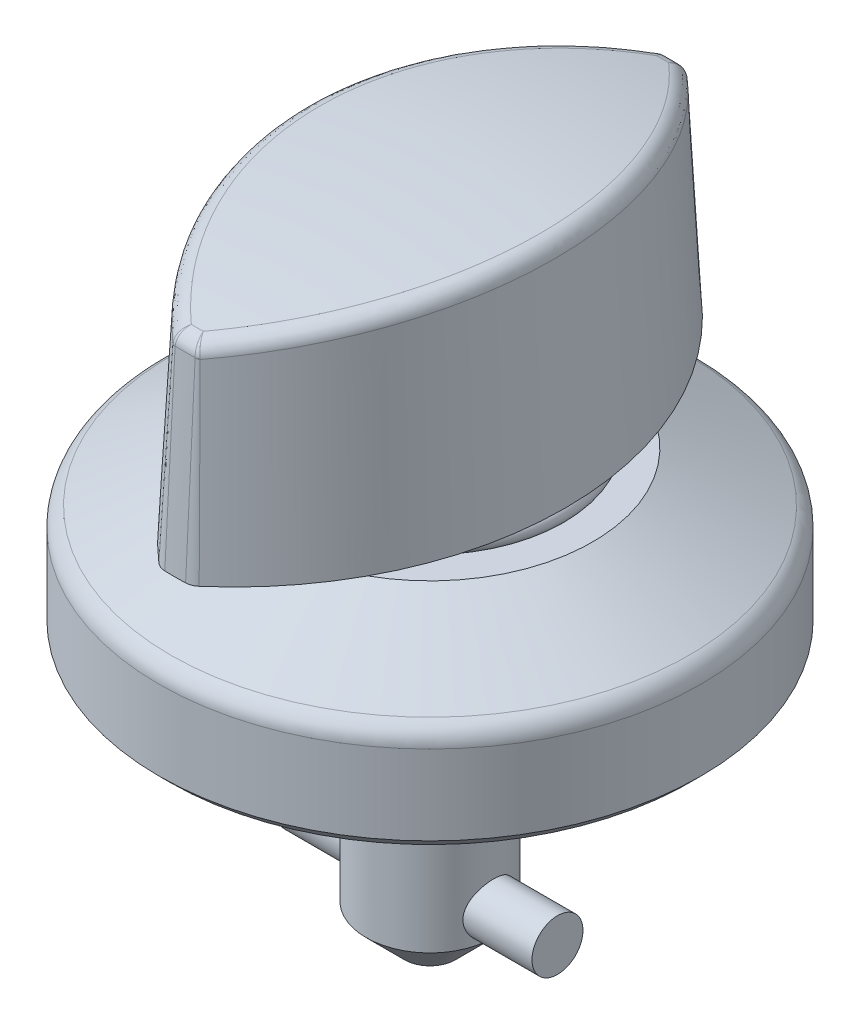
ISO-10303-21;
HEADER;
FILE_DESCRIPTION(('STEP AP214'),'2;1');
FILE_NAME('part.step','',(''),(''),'','','');
FILE_SCHEMA(('AUTOMOTIVE_DESIGN { 1 0 10303 214 1 1 1 1 }'));
ENDSEC;
DATA;
#1=APPLICATION_CONTEXT('core data for automotive mechanical design processes');
#2=APPLICATION_PROTOCOL_DEFINITION('international standard','automotive_design',2000,#1);
#3=PRODUCT_CONTEXT('',#1,'mechanical');
#4=PRODUCT('Part','Part','',(#3));
#5=PRODUCT_RELATED_PRODUCT_CATEGORY('part','',(#4));
#6=PRODUCT_DEFINITION_FORMATION('','',#4);
#7=PRODUCT_DEFINITION_CONTEXT('part definition',#1,'design');
#8=PRODUCT_DEFINITION('design','',#6,#7);
#9=PRODUCT_DEFINITION_SHAPE('','',#8);
#10=(LENGTH_UNIT() NAMED_UNIT(*) SI_UNIT(.MILLI.,.METRE.));
#11=(NAMED_UNIT(*) PLANE_ANGLE_UNIT() SI_UNIT($,.RADIAN.));
#12=(NAMED_UNIT(*) SI_UNIT($,.STERADIAN.) SOLID_ANGLE_UNIT());
#13=UNCERTAINTY_MEASURE_WITH_UNIT(LENGTH_MEASURE(1.E-05),#10,'distance_accuracy_value','');
#14=(GEOMETRIC_REPRESENTATION_CONTEXT(3) GLOBAL_UNCERTAINTY_ASSIGNED_CONTEXT((#13)) GLOBAL_UNIT_ASSIGNED_CONTEXT((#10,
#11,#12)) REPRESENTATION_CONTEXT('',''));
#15=CARTESIAN_POINT('',(0.,0.,0.));
#16=DIRECTION('',(0.,0.,1.));
#17=DIRECTION('',(1.,0.,0.));
#18=AXIS2_PLACEMENT_3D('',#15,#16,#17);
#19=CARTESIAN_POINT('',(0.,-11.5,0.));
#20=DIRECTION('',(0.,-1.,0.));
#21=DIRECTION('',(0.,0.,-1.));
#22=AXIS2_PLACEMENT_3D('',#19,#20,#21);
#23=PLANE('',#22);
#24=CARTESIAN_POINT('',(0.,-11.5,0.));
#25=DIRECTION('',(0.,-1.,0.));
#26=DIRECTION('',(0.,0.,-1.));
#27=AXIS2_PLACEMENT_3D('',#24,#25,#26);
#28=CIRCLE('',#27,1.6);
#29=CARTESIAN_POINT('',(0.,-11.5,-1.6));
#30=VERTEX_POINT('',#29);
#31=EDGE_CURVE('P0_E41',#30,#30,#28,.T.);
#32=ORIENTED_EDGE('',*,*,#31,.T.);
#33=EDGE_LOOP('',(#32));
#34=FACE_BOUND('',#33,.T.);
#35=ADVANCED_FACE('P0_F16',(#34),#23,.T.);
#36=CARTESIAN_POINT('',(0.,-11.5,0.));
#37=DIRECTION('',(0.,1.,0.));
#38=DIRECTION('',(0.,0.,1.));
#39=AXIS2_PLACEMENT_3D('',#36,#37,#38);
#40=CONICAL_SURFACE('',#39,1.6,0.78539816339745);
#41=CARTESIAN_POINT('',(0.,-9.10000000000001,0.));
#42=DIRECTION('',(0.,-1.,0.));
#43=DIRECTION('',(0.,0.,-1.));
#44=AXIS2_PLACEMENT_3D('',#41,#42,#43);
#45=CIRCLE('',#44,4.);
#46=CARTESIAN_POINT('',(4.00000000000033,-9.10000000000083,0.));
#47=VERTEX_POINT('',#46);
#48=CARTESIAN_POINT('',(-4.,-9.10000000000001,0.));
#49=VERTEX_POINT('',#48);
#50=EDGE_CURVE('P0_E34',#47,#49,#45,.T.);
#51=ORIENTED_EDGE('',*,*,#50,.T.);
#52=EDGE_CURVE('P0_E40',#49,#47,#45,.T.);
#53=ORIENTED_EDGE('',*,*,#52,.T.);
#54=EDGE_LOOP('',(#51,#53));
#55=FACE_BOUND('',#54,.T.);
#56=ORIENTED_EDGE('',*,*,#31,.F.);
#57=EDGE_LOOP('',(#56));
#58=FACE_BOUND('',#57,.T.);
#59=ADVANCED_FACE('P0_F38',(#55,#58),#40,.T.);
#60=CARTESIAN_POINT('',(0.,-11.5,0.));
#61=DIRECTION('',(0.,-1.,0.));
#62=DIRECTION('',(0.,0.,-1.));
#63=AXIS2_PLACEMENT_3D('',#60,#61,#62);
#64=CYLINDRICAL_SURFACE('',#63,4.);
#65=CARTESIAN_POINT('',(0.,0.,0.));
#66=DIRECTION('',(0.,-1.,0.));
#67=DIRECTION('',(0.,0.,-1.));
#68=AXIS2_PLACEMENT_3D('',#65,#66,#67);
#69=CIRCLE('',#68,4.);
#70=CARTESIAN_POINT('',(0.,0.,-4.));
#71=VERTEX_POINT('',#70);
#72=EDGE_CURVE('P0_E45',#71,#71,#69,.T.);
#73=ORIENTED_EDGE('',*,*,#72,.T.);
#74=EDGE_LOOP('',(#73));
#75=FACE_BOUND('',#74,.T.);
#76=ORIENTED_EDGE('',*,*,#50,.F.);
#77=CARTESIAN_POINT('',(3.66606055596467,-7.50000000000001,1.6));
#78=CARTESIAN_POINT('',(3.66606921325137,-7.58571159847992,1.59999060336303));
#79=CARTESIAN_POINT('',(3.66910881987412,-7.67154442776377,1.59307185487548));
#80=CARTESIAN_POINT('',(3.68088731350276,-7.84074786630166,1.56565522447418));
#81=CARTESIAN_POINT('',(3.68964076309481,-7.9241116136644,1.5451226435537));
#82=CARTESIAN_POINT('',(3.71168364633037,-8.08564235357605,1.49138802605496));
#83=CARTESIAN_POINT('',(3.72495597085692,-8.16382763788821,1.45823372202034));
#84=CARTESIAN_POINT('',(3.75451732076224,-8.3135080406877,1.38033621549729));
#85=CARTESIAN_POINT('',(3.77080568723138,-8.3850046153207,1.335595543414));
#86=CARTESIAN_POINT('',(3.80560692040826,-8.52340832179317,1.23305757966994));
#87=CARTESIAN_POINT('',(3.82419134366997,-8.58988513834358,1.17470348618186));
#88=CARTESIAN_POINT('',(3.86089965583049,-8.71242319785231,1.04776728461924));
#89=CARTESIAN_POINT('',(3.87902338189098,-8.7684808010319,0.979181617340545));
#90=CARTESIAN_POINT('',(3.91362726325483,-8.87072511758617,0.830405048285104));
#91=CARTESIAN_POINT('',(3.93001442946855,-8.91643544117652,0.749863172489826));
#92=CARTESIAN_POINT('',(3.95843142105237,-8.99347485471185,0.581460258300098));
#93=CARTESIAN_POINT('',(3.97046301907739,-9.02480979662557,0.493602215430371));
#94=CARTESIAN_POINT('',(3.98830660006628,-9.07067318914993,0.317573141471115));
#95=CARTESIAN_POINT('',(3.99439149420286,-9.08594185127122,0.229623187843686));
#96=CARTESIAN_POINT('',(4.00064248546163,-9.10162278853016,0.0522130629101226));
#97=CARTESIAN_POINT('',(4.0008107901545,-9.10204060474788,-0.0372465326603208));
#98=CARTESIAN_POINT('',(3.99537570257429,-9.08841378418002,-0.209785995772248));
#99=CARTESIAN_POINT('',(3.99009597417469,-9.07518018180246,-0.292941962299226));
#100=CARTESIAN_POINT('',(3.97479433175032,-9.0360056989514,-0.455738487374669));
#101=CARTESIAN_POINT('',(3.9647720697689,-9.0100638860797,-0.535378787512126));
#102=CARTESIAN_POINT('',(3.9407745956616,-8.94589081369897,-0.690318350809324));
#103=CARTESIAN_POINT('',(3.9267420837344,-8.90748022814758,-0.765534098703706));
#104=CARTESIAN_POINT('',(3.89611668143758,-8.8196279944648,-0.908646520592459));
#105=CARTESIAN_POINT('',(3.87952291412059,-8.77018256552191,-0.976540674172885));
#106=CARTESIAN_POINT('',(3.84417309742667,-8.65788069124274,-1.10781506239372));
#107=CARTESIAN_POINT('',(3.82534661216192,-8.59435688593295,-1.17060627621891));
#108=CARTESIAN_POINT('',(3.78849328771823,-8.45760754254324,-1.28488593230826));
#109=CARTESIAN_POINT('',(3.77046671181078,-8.38437884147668,-1.33637067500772));
#110=CARTESIAN_POINT('',(3.7367751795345,-8.22766478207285,-1.42792335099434));
#111=CARTESIAN_POINT('',(3.72119131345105,-8.14394813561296,-1.46762772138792));
#112=CARTESIAN_POINT('',(3.69510072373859,-7.9702276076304,-1.53214100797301));
#113=CARTESIAN_POINT('',(3.68459070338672,-7.88022785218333,-1.55695959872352));
#114=CARTESIAN_POINT('',(3.67063807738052,-7.70237137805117,-1.58956395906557));
#115=CARTESIAN_POINT('',(3.6668029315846,-7.61471964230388,-1.59829767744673));
#116=CARTESIAN_POINT('',(3.66551598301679,-7.43913823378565,-1.60124906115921));
#117=CARTESIAN_POINT('',(3.6680622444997,-7.35120865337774,-1.59547112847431));
#118=CARTESIAN_POINT('',(3.67884835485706,-7.18283285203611,-1.57042631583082));
#119=CARTESIAN_POINT('',(3.68675566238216,-7.10224565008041,-1.55194644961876));
#120=CARTESIAN_POINT('',(3.70696040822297,-6.9453692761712,-1.50304334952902));
#121=CARTESIAN_POINT('',(3.71925881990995,-6.86908106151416,-1.47261746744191));
#122=CARTESIAN_POINT('',(3.7474702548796,-6.71951811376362,-1.39930851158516));
#123=CARTESIAN_POINT('',(3.76350963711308,-6.64649104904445,-1.35597029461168));
#124=CARTESIAN_POINT('',(3.7972030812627,-6.50841361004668,-1.2585321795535));
#125=CARTESIAN_POINT('',(3.8148577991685,-6.44336650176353,-1.20442789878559));
#126=CARTESIAN_POINT('',(3.85136732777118,-6.31810127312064,-1.08227536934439));
#127=CARTESIAN_POINT('',(3.87021445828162,-6.25859474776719,-1.01349234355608));
#128=CARTESIAN_POINT('',(3.9057583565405,-6.15185833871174,-0.866466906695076));
#129=CARTESIAN_POINT('',(3.92245503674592,-6.10462895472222,-0.788224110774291));
#130=CARTESIAN_POINT('',(3.95186972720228,-6.02396189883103,-0.624223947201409));
#131=CARTESIAN_POINT('',(3.96458868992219,-5.99052092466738,-0.538468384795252));
#132=CARTESIAN_POINT('',(3.98458170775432,-5.93876091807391,-0.36191487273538));
#133=CARTESIAN_POINT('',(3.99185871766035,-5.92043367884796,-0.271119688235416));
#134=CARTESIAN_POINT('',(3.9998320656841,-5.9003962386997,-0.0934532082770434));
#135=CARTESIAN_POINT('',(4.00092677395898,-5.89767989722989,-0.00671239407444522));
#136=CARTESIAN_POINT('',(3.99748833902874,-5.90628438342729,0.165947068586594));
#137=CARTESIAN_POINT('',(3.9929560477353,-5.91760308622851,0.251865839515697));
#138=CARTESIAN_POINT('',(3.97897210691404,-5.95323743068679,0.417736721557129));
#139=CARTESIAN_POINT('',(3.96967584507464,-5.97714315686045,0.497791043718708));
#140=CARTESIAN_POINT('',(3.9471595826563,-6.03684224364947,0.652737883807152));
#141=CARTESIAN_POINT('',(3.93393885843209,-6.07263779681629,0.72762944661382));
#142=CARTESIAN_POINT('',(3.90414475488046,-6.15688255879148,0.873762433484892));
#143=CARTESIAN_POINT('',(3.88744903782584,-6.20582103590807,0.94469630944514));
#144=CARTESIAN_POINT('',(3.85271522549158,-6.31423081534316,1.07764322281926));
#145=CARTESIAN_POINT('',(3.834676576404,-6.3737064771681,1.1396525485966));
#146=CARTESIAN_POINT('',(3.79790210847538,-6.50585217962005,1.25696101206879));
#147=CARTESIAN_POINT('',(3.77919226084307,-6.57911109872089,1.31160710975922));
#148=CARTESIAN_POINT('',(3.74439737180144,-6.73435370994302,1.40787796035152));
#149=CARTESIAN_POINT('',(3.72831263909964,-6.81633842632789,1.44950118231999));
#150=CARTESIAN_POINT('',(3.70207091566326,-6.97922976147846,1.51519287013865));
#151=CARTESIAN_POINT('',(3.69151134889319,-7.05957218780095,1.54050201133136));
#152=CARTESIAN_POINT('',(3.67556802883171,-7.22358833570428,1.57817420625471));
#153=CARTESIAN_POINT('',(3.6701698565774,-7.30725209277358,1.59057333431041));
#154=CARTESIAN_POINT('',(3.66659567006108,-7.42750204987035,1.59877140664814));
#155=CARTESIAN_POINT('',(3.66605689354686,-7.46374017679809,1.6000039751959));
#156=CARTESIAN_POINT('',(3.66606055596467,-7.50000000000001,1.6));
#157=B_SPLINE_CURVE_WITH_KNOTS('',3,(#77,#78,#79,#80,#81,#82,#83,#84,#85,#86,#87,#88,#89,#90,
#91,#92,#93,#94,#95,#96,#97,#98,#99,#100,#101,#102,#103,#104,#105,#106,#107,#108,#109,#110,#111,
#112,#113,#114,#115,#116,#117,#118,#119,#120,#121,#122,#123,#124,#125,#126,#127,#128,#129,#130,
#131,#132,#133,#134,#135,#136,#137,#138,#139,#140,#141,#142,#143,#144,#145,#146,#147,#148,#149,
#150,#151,#152,#153,#154,#155,#156),.UNSPECIFIED.,.T.,.F.,(4,2,2,2,2,2,2,2,2,2,2,2,2,2,2,2,2,2,
2,2,2,2,2,2,2,2,2,2,2,2,2,2,2,2,2,2,2,2,2,4),(0.,0.257022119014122,0.514701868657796,
0.771416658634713,1.02807543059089,1.2980449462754,1.56810859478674,1.84882135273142,
2.12941973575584,2.39643346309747,2.66334756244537,2.91526915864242,3.16720924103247,
3.42294640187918,3.67877131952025,3.95139235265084,4.22410245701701,4.50451566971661,
4.78474643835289,5.04785718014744,5.3108881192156,5.55893798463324,5.80704286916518,
6.06520923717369,6.32348091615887,6.60082987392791,6.87819011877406,7.15548389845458,
7.43262700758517,7.6916883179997,7.95071041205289,8.2017759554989,8.45288782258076,
8.71509640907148,8.97741373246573,9.25597002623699,9.53455905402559,9.78813328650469,
10.040997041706,10.1497288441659),.UNSPECIFIED.);
#158=EDGE_CURVE('P0_E11',#47,#47,#157,.T.);
#159=ORIENTED_EDGE('',*,*,#158,.F.);
#160=ORIENTED_EDGE('',*,*,#52,.F.);
#161=CARTESIAN_POINT('',(-3.66606055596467,-7.50000000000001,1.6));
#162=CARTESIAN_POINT('',(-3.66606921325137,-7.4142884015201,1.59999060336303));
#163=CARTESIAN_POINT('',(-3.66910881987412,-7.32845557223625,1.59307185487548));
#164=CARTESIAN_POINT('',(-3.68088731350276,-7.15925213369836,1.56565522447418));
#165=CARTESIAN_POINT('',(-3.68964076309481,-7.07588838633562,1.5451226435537));
#166=CARTESIAN_POINT('',(-3.71168364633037,-6.91435764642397,1.49138802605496));
#167=CARTESIAN_POINT('',(-3.72495597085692,-6.8361723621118,1.45823372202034));
#168=CARTESIAN_POINT('',(-3.75451732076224,-6.68649195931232,1.38033621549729));
#169=CARTESIAN_POINT('',(-3.77080568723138,-6.61499538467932,1.335595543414));
#170=CARTESIAN_POINT('',(-3.80560692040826,-6.47659167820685,1.23305757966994));
#171=CARTESIAN_POINT('',(-3.82419134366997,-6.41011486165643,1.17470348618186));
#172=CARTESIAN_POINT('',(-3.86089965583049,-6.28757680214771,1.04776728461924));
#173=CARTESIAN_POINT('',(-3.87902338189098,-6.23151919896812,0.979181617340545));
#174=CARTESIAN_POINT('',(-3.91362726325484,-6.12927488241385,0.830405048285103));
#175=CARTESIAN_POINT('',(-3.93001442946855,-6.08356455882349,0.749863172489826));
#176=CARTESIAN_POINT('',(-3.95843142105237,-6.00652514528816,0.581460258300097));
#177=CARTESIAN_POINT('',(-3.97046301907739,-5.97519020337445,0.49360221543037));
#178=CARTESIAN_POINT('',(-3.98830660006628,-5.92932681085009,0.317573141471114));
#179=CARTESIAN_POINT('',(-3.99439149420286,-5.91405814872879,0.229623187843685));
#180=CARTESIAN_POINT('',(-4.00064248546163,-5.89837721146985,0.052213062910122));
#181=CARTESIAN_POINT('',(-4.0008107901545,-5.89795939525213,-0.0372465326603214));
#182=CARTESIAN_POINT('',(-3.99537570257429,-5.91158621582,-0.209785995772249));
#183=CARTESIAN_POINT('',(-3.99009597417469,-5.92481981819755,-0.292941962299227));
#184=CARTESIAN_POINT('',(-3.97479433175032,-5.96399430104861,-0.45573848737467));
#185=CARTESIAN_POINT('',(-3.9647720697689,-5.98993611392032,-0.535378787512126));
#186=CARTESIAN_POINT('',(-3.9407745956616,-6.05410918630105,-0.690318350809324));
#187=CARTESIAN_POINT('',(-3.9267420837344,-6.09251977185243,-0.765534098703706));
#188=CARTESIAN_POINT('',(-3.89611668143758,-6.18037200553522,-0.908646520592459));
#189=CARTESIAN_POINT('',(-3.87952291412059,-6.22981743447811,-0.976540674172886));
#190=CARTESIAN_POINT('',(-3.84417309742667,-6.34211930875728,-1.10781506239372));
#191=CARTESIAN_POINT('',(-3.82534661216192,-6.40564311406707,-1.17060627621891));
#192=CARTESIAN_POINT('',(-3.78849328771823,-6.54239245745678,-1.28488593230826));
#193=CARTESIAN_POINT('',(-3.77046671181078,-6.61562115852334,-1.33637067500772));
#194=CARTESIAN_POINT('',(-3.7367751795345,-6.77233521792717,-1.42792335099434));
#195=CARTESIAN_POINT('',(-3.72119131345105,-6.85605186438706,-1.46762772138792));
#196=CARTESIAN_POINT('',(-3.69510072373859,-7.02977239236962,-1.53214100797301));
#197=CARTESIAN_POINT('',(-3.68459070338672,-7.11977214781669,-1.55695959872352));
#198=CARTESIAN_POINT('',(-3.67063807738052,-7.29762862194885,-1.58956395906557));
#199=CARTESIAN_POINT('',(-3.66680293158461,-7.38528035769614,-1.59829767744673));
#200=CARTESIAN_POINT('',(-3.66551598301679,-7.56086176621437,-1.60124906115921));
#201=CARTESIAN_POINT('',(-3.6680622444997,-7.64879134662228,-1.59547112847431));
#202=CARTESIAN_POINT('',(-3.67884835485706,-7.81716714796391,-1.57042631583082));
#203=CARTESIAN_POINT('',(-3.68675566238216,-7.89775434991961,-1.55194644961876));
#204=CARTESIAN_POINT('',(-3.70696040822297,-8.05463072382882,-1.50304334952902));
#205=CARTESIAN_POINT('',(-3.71925881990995,-8.13091893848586,-1.47261746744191));
#206=CARTESIAN_POINT('',(-3.7474702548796,-8.2804818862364,-1.39930851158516));
#207=CARTESIAN_POINT('',(-3.76350963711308,-8.35350895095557,-1.35597029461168));
#208=CARTESIAN_POINT('',(-3.7972030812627,-8.49158638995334,-1.2585321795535));
#209=CARTESIAN_POINT('',(-3.8148577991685,-8.55663349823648,-1.20442789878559));
#210=CARTESIAN_POINT('',(-3.85136732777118,-8.68189872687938,-1.08227536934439));
#211=CARTESIAN_POINT('',(-3.87021445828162,-8.74140525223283,-1.01349234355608));
#212=CARTESIAN_POINT('',(-3.9057583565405,-8.84814166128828,-0.866466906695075));
#213=CARTESIAN_POINT('',(-3.92245503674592,-8.8953710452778,-0.788224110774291));
#214=CARTESIAN_POINT('',(-3.95186972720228,-8.97603810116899,-0.624223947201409));
#215=CARTESIAN_POINT('',(-3.96458868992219,-9.00947907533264,-0.538468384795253));
#216=CARTESIAN_POINT('',(-3.98458170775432,-9.06123908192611,-0.36191487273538));
#217=CARTESIAN_POINT('',(-3.99185871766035,-9.07956632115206,-0.271119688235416));
#218=CARTESIAN_POINT('',(-3.9998320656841,-9.09960376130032,-0.0934532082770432));
#219=CARTESIAN_POINT('',(-4.00092677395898,-9.10232010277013,-0.00671239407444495));
#220=CARTESIAN_POINT('',(-3.99748833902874,-9.09371561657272,0.165947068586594));
#221=CARTESIAN_POINT('',(-3.9929560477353,-9.08239691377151,0.251865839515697));
#222=CARTESIAN_POINT('',(-3.97897210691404,-9.04676256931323,0.417736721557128));
#223=CARTESIAN_POINT('',(-3.96967584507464,-9.02285684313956,0.497791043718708));
#224=CARTESIAN_POINT('',(-3.9471595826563,-8.96315775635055,0.652737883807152));
#225=CARTESIAN_POINT('',(-3.93393885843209,-8.92736220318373,0.72762944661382));
#226=CARTESIAN_POINT('',(-3.90414475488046,-8.84311744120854,0.873762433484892));
#227=CARTESIAN_POINT('',(-3.88744903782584,-8.79417896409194,0.94469630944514));
#228=CARTESIAN_POINT('',(-3.85271522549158,-8.68576918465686,1.07764322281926));
#229=CARTESIAN_POINT('',(-3.834676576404,-8.62629352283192,1.1396525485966));
#230=CARTESIAN_POINT('',(-3.79790210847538,-8.49414782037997,1.25696101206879));
#231=CARTESIAN_POINT('',(-3.77919226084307,-8.42088890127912,1.31160710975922));
#232=CARTESIAN_POINT('',(-3.74439737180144,-8.26564629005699,1.40787796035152));
#233=CARTESIAN_POINT('',(-3.72831263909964,-8.18366157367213,1.44950118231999));
#234=CARTESIAN_POINT('',(-3.70207091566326,-8.02077023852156,1.51519287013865));
#235=CARTESIAN_POINT('',(-3.69151134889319,-7.94042781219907,1.54050201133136));
#236=CARTESIAN_POINT('',(-3.67556802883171,-7.77641166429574,1.57817420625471));
#237=CARTESIAN_POINT('',(-3.6701698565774,-7.69274790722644,1.59057333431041));
#238=CARTESIAN_POINT('',(-3.66659567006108,-7.57249795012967,1.59877140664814));
#239=CARTESIAN_POINT('',(-3.66605689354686,-7.53625982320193,1.6000039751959));
#240=CARTESIAN_POINT('',(-3.66606055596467,-7.50000000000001,1.6));
#241=B_SPLINE_CURVE_WITH_KNOTS('',3,(#161,#162,#163,#164,#165,#166,#167,#168,#169,#170,#171,
#172,#173,#174,#175,#176,#177,#178,#179,#180,#181,#182,#183,#184,#185,#186,#187,#188,#189,#190,
#191,#192,#193,#194,#195,#196,#197,#198,#199,#200,#201,#202,#203,#204,#205,#206,#207,#208,#209,
#210,#211,#212,#213,#214,#215,#216,#217,#218,#219,#220,#221,#222,#223,#224,#225,#226,#227,#228,
#229,#230,#231,#232,#233,#234,#235,#236,#237,#238,#239,#240),.UNSPECIFIED.,.T.,.F.,(4,2,2,2,2,2,
2,2,2,2,2,2,2,2,2,2,2,2,2,2,2,2,2,2,2,2,2,2,2,2,2,2,2,2,2,2,2,2,2,4),(0.,0.257022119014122,
0.514701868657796,0.771416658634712,1.02807543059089,1.2980449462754,1.56810859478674,
1.84882135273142,2.12941973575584,2.39643346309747,2.66334756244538,2.91526915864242,
3.16720924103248,3.42294640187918,3.67877131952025,3.95139235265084,4.22410245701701,
4.50451566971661,4.78474643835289,5.04785718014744,5.31088811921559,5.55893798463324,
5.80704286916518,6.06520923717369,6.32348091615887,6.60082987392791,6.87819011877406,
7.15548389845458,7.43262700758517,7.6916883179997,7.95071041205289,8.2017759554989,
8.45288782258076,8.71509640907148,8.97741373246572,9.25597002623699,9.53455905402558,
9.78813328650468,10.040997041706,10.1497288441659),.UNSPECIFIED.);
#242=EDGE_CURVE('P0_E27',#49,#49,#241,.T.);
#243=ORIENTED_EDGE('',*,*,#242,.F.);
#244=EDGE_LOOP('',(#76,#159,#160,#243));
#245=FACE_BOUND('',#244,.T.);
#246=ADVANCED_FACE('P0_F43',(#75,#245),#64,.T.);
#247=CARTESIAN_POINT('',(4.,0.,0.));
#248=DIRECTION('',(0.,1.,0.));
#249=DIRECTION('',(0.,0.,1.));
#250=AXIS2_PLACEMENT_3D('',#247,#248,#249);
#251=PLANE('',#250);
#252=CARTESIAN_POINT('',(0.,0.,0.));
#253=DIRECTION('',(0.,-1.,0.));
#254=DIRECTION('',(0.,0.,-1.));
#255=AXIS2_PLACEMENT_3D('',#252,#253,#254);
#256=CIRCLE('',#255,3.2);
#257=CARTESIAN_POINT('',(0.,0.,-3.2));
#258=VERTEX_POINT('',#257);
#259=EDGE_CURVE('P0_E47',#258,#258,#256,.T.);
#260=ORIENTED_EDGE('',*,*,#259,.T.);
#261=EDGE_LOOP('',(#260));
#262=FACE_BOUND('',#261,.T.);
#263=ORIENTED_EDGE('',*,*,#72,.F.);
#264=EDGE_LOOP('',(#263));
#265=FACE_BOUND('',#264,.T.);
#266=ADVANCED_FACE('P0_F79',(#262,#265),#251,.T.);
#267=CARTESIAN_POINT('',(0.,-11.5,0.));
#268=DIRECTION('',(0.,-1.,0.));
#269=DIRECTION('',(0.,0.,-1.));
#270=AXIS2_PLACEMENT_3D('',#267,#268,#269);
#271=CYLINDRICAL_SURFACE('',#270,3.2);
#272=CARTESIAN_POINT('',(0.,20.2,0.));
#273=DIRECTION('',(0.,-1.,0.));
#274=DIRECTION('',(0.,0.,-1.));
#275=AXIS2_PLACEMENT_3D('',#272,#273,#274);
#276=CIRCLE('',#275,3.2);
#277=CARTESIAN_POINT('',(0.,20.2,-3.2));
#278=VERTEX_POINT('',#277);
#279=EDGE_CURVE('P0_E155',#278,#278,#276,.T.);
#280=ORIENTED_EDGE('',*,*,#279,.T.);
#281=EDGE_LOOP('',(#280));
#282=FACE_BOUND('',#281,.T.);
#283=ORIENTED_EDGE('',*,*,#259,.F.);
#284=EDGE_LOOP('',(#283));
#285=FACE_BOUND('',#284,.T.);
#286=ADVANCED_FACE('P0_F76',(#282,#285),#271,.T.);
#287=CARTESIAN_POINT('',(0.,20.2,0.));
#288=DIRECTION('',(0.,-1.,0.));
#289=DIRECTION('',(0.,0.,-1.));
#290=AXIS2_PLACEMENT_3D('',#287,#288,#289);
#291=CONICAL_SURFACE('',#290,3.2,0.785398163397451);
#292=CARTESIAN_POINT('',(0.,21.,0.));
#293=DIRECTION('',(0.,-1.,0.));
#294=DIRECTION('',(0.,0.,-1.));
#295=AXIS2_PLACEMENT_3D('',#292,#293,#294);
#296=CIRCLE('',#295,2.4);
#297=CARTESIAN_POINT('',(0.,21.,-2.4));
#298=VERTEX_POINT('',#297);
#299=EDGE_CURVE('P0_E150',#298,#298,#296,.T.);
#300=ORIENTED_EDGE('',*,*,#299,.T.);
#301=EDGE_LOOP('',(#300));
#302=FACE_BOUND('',#301,.T.);
#303=ORIENTED_EDGE('',*,*,#279,.F.);
#304=EDGE_LOOP('',(#303));
#305=FACE_BOUND('',#304,.T.);
#306=ADVANCED_FACE('P0_F72',(#302,#305),#291,.T.);
#307=CARTESIAN_POINT('',(2.4,21.,0.));
#308=DIRECTION('',(0.,1.,0.));
#309=DIRECTION('',(0.,0.,1.));
#310=AXIS2_PLACEMENT_3D('',#307,#308,#309);
#311=PLANE('',#310);
#312=ORIENTED_EDGE('',*,*,#299,.F.);
#313=EDGE_LOOP('',(#312));
#314=FACE_BOUND('',#313,.T.);
#315=ADVANCED_FACE('P0_F68',(#314),#311,.T.);
#316=CARTESIAN_POINT('',(-8.,-7.50000000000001,0.));
#317=DIRECTION('',(-1.,0.,0.));
#318=DIRECTION('',(0.,0.,1.));
#319=AXIS2_PLACEMENT_3D('',#316,#317,#318);
#320=PLANE('',#319);
#321=CARTESIAN_POINT('',(-8.,-7.50000000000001,0.));
#322=DIRECTION('',(-1.,0.,0.));
#323=DIRECTION('',(0.,0.,1.));
#324=AXIS2_PLACEMENT_3D('',#321,#322,#323);
#325=CIRCLE('',#324,1.6);
#326=CARTESIAN_POINT('',(-8.,-7.50000000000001,1.6));
#327=VERTEX_POINT('',#326);
#328=EDGE_CURVE('P0_E147',#327,#327,#325,.T.);
#329=ORIENTED_EDGE('',*,*,#328,.T.);
#330=EDGE_LOOP('',(#329));
#331=FACE_BOUND('',#330,.T.);
#332=ADVANCED_FACE('P0_F62',(#331),#320,.T.);
#333=CARTESIAN_POINT('',(-5.26029262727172,-7.50000000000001,0.));
#334=DIRECTION('',(-1.,0.,0.));
#335=DIRECTION('',(0.,0.,1.));
#336=AXIS2_PLACEMENT_3D('',#333,#334,#335);
#337=CYLINDRICAL_SURFACE('',#336,1.6);
#338=ORIENTED_EDGE('',*,*,#242,.T.);
#339=EDGE_LOOP('',(#338));
#340=FACE_BOUND('',#339,.T.);
#341=ORIENTED_EDGE('',*,*,#328,.F.);
#342=EDGE_LOOP('',(#341));
#343=FACE_BOUND('',#342,.T.);
#344=ADVANCED_FACE('P0_F56',(#340,#343),#337,.T.);
#345=ORIENTED_EDGE('',*,*,#158,.T.);
#346=EDGE_LOOP('',(#345));
#347=FACE_BOUND('',#346,.T.);
#348=CARTESIAN_POINT('',(8.,-7.50000000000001,0.));
#349=DIRECTION('',(-1.,0.,0.));
#350=DIRECTION('',(0.,0.,1.));
#351=AXIS2_PLACEMENT_3D('',#348,#349,#350);
#352=CIRCLE('',#351,1.6);
#353=CARTESIAN_POINT('',(8.,-7.50000000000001,1.6));
#354=VERTEX_POINT('',#353);
#355=EDGE_CURVE('P0_E145',#354,#354,#352,.T.);
#356=ORIENTED_EDGE('',*,*,#355,.T.);
#357=EDGE_LOOP('',(#356));
#358=FACE_BOUND('',#357,.T.);
#359=ADVANCED_FACE('P0_F61',(#347,#358),#337,.T.);
#360=CARTESIAN_POINT('',(8.,-9.10000000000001,0.));
#361=DIRECTION('',(1.,0.,0.));
#362=DIRECTION('',(0.,0.,-1.));
#363=AXIS2_PLACEMENT_3D('',#360,#361,#362);
#364=PLANE('',#363);
#365=ORIENTED_EDGE('',*,*,#355,.F.);
#366=EDGE_LOOP('',(#365));
#367=FACE_BOUND('',#366,.T.);
#368=ADVANCED_FACE('P0_F64',(#367),#364,.T.);
#369=CLOSED_SHELL('',(#35,#59,#246,#266,#286,#306,#315,#332,#344,#359,#368));
#370=MANIFOLD_SOLID_BREP('P0_B1',#369);
#371=CARTESIAN_POINT('',(16.,16.5,0.));
#372=DIRECTION('',(0.,-1.,0.));
#373=DIRECTION('',(0.,0.,-1.));
#374=AXIS2_PLACEMENT_3D('',#371,#372,#373);
#375=PLANE('',#374);
#376=CARTESIAN_POINT('',(0.,16.5,0.));
#377=DIRECTION('',(0.,-1.,0.));
#378=DIRECTION('',(0.,0.,-1.));
#379=AXIS2_PLACEMENT_3D('',#376,#377,#378);
#380=CIRCLE('',#379,3.2);
#381=CARTESIAN_POINT('',(0.,16.5,-3.2));
#382=VERTEX_POINT('',#381);
#383=EDGE_CURVE('P1_E678',#382,#382,#380,.T.);
#384=ORIENTED_EDGE('',*,*,#383,.F.);
#385=EDGE_LOOP('',(#384));
#386=FACE_BOUND('',#385,.T.);
#387=CARTESIAN_POINT('',(-12.25,16.5,0.));
#388=DIRECTION('',(0.,-1.,0.));
#389=DIRECTION('',(0.,0.,1.));
#390=AXIS2_PLACEMENT_3D('',#387,#388,#389);
#391=CIRCLE('',#390,20.75);
#392=CARTESIAN_POINT('',(1.26349780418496,16.5,-15.7463607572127));
#393=VERTEX_POINT('',#392);
#394=CARTESIAN_POINT('',(1.26349780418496,16.5,15.7463607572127));
#395=VERTEX_POINT('',#394);
#396=EDGE_CURVE('P1_E758',#393,#395,#391,.T.);
#397=ORIENTED_EDGE('',*,*,#396,.T.);
#398=CARTESIAN_POINT('',(0.61224489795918,16.5,14.987499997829));
#399=DIRECTION('',(0.,-1.,0.));
#400=DIRECTION('',(0.,0.,-1.));
#401=AXIS2_PLACEMENT_3D('',#398,#399,#400);
#402=CIRCLE('',#401,1.);
#403=CARTESIAN_POINT('',(0.653061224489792,16.5,15.9866666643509));
#404=VERTEX_POINT('',#403);
#405=EDGE_CURVE('P1_E76',#395,#404,#402,.T.);
#406=ORIENTED_EDGE('',*,*,#405,.T.);
#407=CARTESIAN_POINT('',(0.,16.5,0.));
#408=DIRECTION('',(0.,-1.,0.));
#409=DIRECTION('',(0.,0.,-1.));
#410=AXIS2_PLACEMENT_3D('',#407,#408,#409);
#411=CIRCLE('',#410,16.);
#412=CARTESIAN_POINT('',(-0.653061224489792,16.5,15.9866666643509));
#413=VERTEX_POINT('',#412);
#414=EDGE_CURVE('P1_E691',#404,#413,#411,.T.);
#415=ORIENTED_EDGE('',*,*,#414,.T.);
#416=CARTESIAN_POINT('',(-0.61224489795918,16.5,14.987499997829));
#417=DIRECTION('',(0.,-1.,0.));
#418=DIRECTION('',(0.,0.,-1.));
#419=AXIS2_PLACEMENT_3D('',#416,#417,#418);
#420=CIRCLE('',#419,1.);
#421=CARTESIAN_POINT('',(-1.26349780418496,16.5,15.7463607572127));
#422=VERTEX_POINT('',#421);
#423=EDGE_CURVE('P1_E686',#413,#422,#420,.T.);
#424=ORIENTED_EDGE('',*,*,#423,.T.);
#425=CARTESIAN_POINT('',(12.25,16.5,0.));
#426=DIRECTION('',(0.,-1.,0.));
#427=DIRECTION('',(0.,0.,-1.));
#428=AXIS2_PLACEMENT_3D('',#425,#426,#427);
#429=CIRCLE('',#428,20.75);
#430=CARTESIAN_POINT('',(-1.26349780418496,16.5,-15.7463607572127));
#431=VERTEX_POINT('',#430);
#432=EDGE_CURVE('P1_E697',#422,#431,#429,.T.);
#433=ORIENTED_EDGE('',*,*,#432,.T.);
#434=CARTESIAN_POINT('',(-0.61224489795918,16.5,-14.987499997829));
#435=DIRECTION('',(0.,-1.,0.));
#436=DIRECTION('',(0.,0.,-1.));
#437=AXIS2_PLACEMENT_3D('',#434,#435,#436);
#438=CIRCLE('',#437,1.);
#439=CARTESIAN_POINT('',(-0.653061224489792,16.5,-15.9866666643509));
#440=VERTEX_POINT('',#439);
#441=EDGE_CURVE('P1_E705',#431,#440,#438,.T.);
#442=ORIENTED_EDGE('',*,*,#441,.T.);
#443=CARTESIAN_POINT('',(0.653061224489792,16.5,-15.9866666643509));
#444=VERTEX_POINT('',#443);
#445=EDGE_CURVE('P1_E603',#440,#444,#411,.T.);
#446=ORIENTED_EDGE('',*,*,#445,.T.);
#447=CARTESIAN_POINT('',(0.61224489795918,16.5,-14.987499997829));
#448=DIRECTION('',(0.,-1.,0.));
#449=DIRECTION('',(0.,0.,-1.));
#450=AXIS2_PLACEMENT_3D('',#447,#448,#449);
#451=CIRCLE('',#450,1.);
#452=EDGE_CURVE('P1_E689',#444,#393,#451,.T.);
#453=ORIENTED_EDGE('',*,*,#452,.T.);
#454=EDGE_LOOP('',(#397,#406,#415,#424,#433,#442,#446,#453));
#455=FACE_BOUND('',#454,.T.);
#456=ADVANCED_FACE('P1_F16',(#386,#455),#375,.T.);
#457=CARTESIAN_POINT('',(0.,-33.9999999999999,0.));
#458=DIRECTION('',(0.,-1.,0.));
#459=DIRECTION('',(1.,0.,0.));
#460=AXIS2_PLACEMENT_3D('',#457,#458,#459);
#461=SPHERICAL_SURFACE('',#460,64.9999999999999);
#462=CARTESIAN_POINT('',(-5.02841802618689,27.2564834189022,18.850318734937));
#463=CARTESIAN_POINT('',(-5.17248836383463,27.9915010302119,18.8642615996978));
#464=CARTESIAN_POINT('',(-5.46982601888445,28.1604622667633,18.197745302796));
#465=CARTESIAN_POINT('',(-4.49343485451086,27.3599454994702,18.6396235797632));
#466=CARTESIAN_POINT('',(-4.63519398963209,28.099569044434,18.6566742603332));
#467=CARTESIAN_POINT('',(-4.95346056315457,28.2655409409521,17.9940895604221));
#468=CARTESIAN_POINT('',(-3.96707695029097,27.4614641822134,18.4059109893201));
#469=CARTESIAN_POINT('',(-4.10739183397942,28.2054376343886,18.4262926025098));
#470=CARTESIAN_POINT('',(-4.44544201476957,28.3686458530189,17.7682266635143));
#471=CARTESIAN_POINT('',(-2.93532100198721,27.6599720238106,17.8941389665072));
#472=CARTESIAN_POINT('',(-3.07203060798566,28.4126022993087,17.920906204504));
#473=CARTESIAN_POINT('',(-3.44967337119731,28.570255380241,17.2737212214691));
#474=CARTESIAN_POINT('',(-2.42992448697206,27.7569608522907,17.6160763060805));
#475=CARTESIAN_POINT('',(-2.56461941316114,28.5138667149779,17.6457574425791));
#476=CARTESIAN_POINT('',(-2.96192475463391,28.6687596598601,17.0050755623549));
#477=CARTESIAN_POINT('',(-1.44396020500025,27.9457355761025,17.0173722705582));
#478=CARTESIAN_POINT('',(-1.573988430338,28.7111064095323,17.0525090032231));
#479=CARTESIAN_POINT('',(-2.01042460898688,28.8604839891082,16.4267166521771));
#480=CARTESIAN_POINT('',(-0.963388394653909,28.037522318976,16.696737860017));
#481=CARTESIAN_POINT('',(-1.09093564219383,28.8070467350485,16.7343023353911));
#482=CARTESIAN_POINT('',(-1.54666917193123,28.9537048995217,16.1170101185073));
#483=CARTESIAN_POINT('',(-0.0306147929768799,28.2152930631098,16.0149880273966));
#484=CARTESIAN_POINT('',(-0.152625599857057,28.9930014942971,16.0569160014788));
#485=CARTESIAN_POINT('',(-0.646566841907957,29.1342533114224,15.4585581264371));
#486=CARTESIAN_POINT('',(0.421588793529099,28.3012774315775,15.6538751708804));
#487=CARTESIAN_POINT('',(0.302441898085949,29.0829768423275,15.6976569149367));
#488=CARTESIAN_POINT('',(-0.21021821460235,29.2215811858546,15.1098151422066));
#489=CARTESIAN_POINT('',(1.28271823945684,28.4646914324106,14.9035715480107));
#490=CARTESIAN_POINT('',(1.16965920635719,29.2540976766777,14.9504630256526));
#491=CARTESIAN_POINT('',(0.620691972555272,29.387548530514,14.3852692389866));
#492=CARTESIAN_POINT('',(1.69246907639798,28.5422864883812,14.5153679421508));
#493=CARTESIAN_POINT('',(1.58246672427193,29.3353811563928,14.5634541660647));
#494=CARTESIAN_POINT('',(1.01605028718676,29.4663560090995,14.0104181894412));
#495=CARTESIAN_POINT('',(2.47879291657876,28.6909303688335,13.7053851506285));
#496=CARTESIAN_POINT('',(2.37525234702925,29.491205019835,13.7552243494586));
#497=CARTESIAN_POINT('',(1.77473268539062,29.6173224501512,13.2283446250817));
#498=CARTESIAN_POINT('',(2.85536602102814,28.7619792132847,13.2836060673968));
#499=CARTESIAN_POINT('',(2.75503153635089,29.5657054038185,13.3339958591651));
#500=CARTESIAN_POINT('',(2.13805686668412,29.689481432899,12.8211222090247));
#501=CARTESIAN_POINT('',(3.57234077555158,28.8970374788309,12.4094695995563));
#502=CARTESIAN_POINT('',(3.47864806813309,29.7074275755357,12.4602699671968));
#503=CARTESIAN_POINT('',(2.8297884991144,29.8266499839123,11.9771991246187));
#504=CARTESIAN_POINT('',(3.91275801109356,28.9610499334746,11.9571255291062));
#505=CARTESIAN_POINT('',(3.82230042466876,29.7746125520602,12.0078145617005));
#506=CARTESIAN_POINT('',(3.15821099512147,29.8916626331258,11.5405112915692));
#507=CARTESIAN_POINT('',(4.55500179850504,29.0816492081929,11.0247676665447));
#508=CARTESIAN_POINT('',(4.47111908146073,29.901278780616,11.0745117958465));
#509=CARTESIAN_POINT('',(3.77781090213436,30.0141462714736,10.640463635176));
#510=CARTESIAN_POINT('',(4.85682844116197,29.1382360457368,10.5447539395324));
#511=CARTESIAN_POINT('',(4.77608896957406,29.9607211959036,10.5937303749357));
#512=CARTESIAN_POINT('',(4.068988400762,30.0716172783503,10.177103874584));
#513=CARTESIAN_POINT('',(5.41976553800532,29.2436492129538,9.5599888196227));
#514=CARTESIAN_POINT('',(5.34528794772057,30.0715299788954,9.60669948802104));
#515=CARTESIAN_POINT('',(4.61205307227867,30.1786775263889,9.22654015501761));
#516=CARTESIAN_POINT('',(5.68084361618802,29.2924693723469,9.0552181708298));
#517=CARTESIAN_POINT('',(5.60929824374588,30.1228533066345,9.10053328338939));
#518=CARTESIAN_POINT('',(4.86390900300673,30.2282605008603,8.7393176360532));
#519=CARTESIAN_POINT('',(6.15992856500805,29.3819659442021,8.02485571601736));
#520=CARTESIAN_POINT('',(6.09408717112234,30.2170001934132,8.06667013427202));
#521=CARTESIAN_POINT('',(5.3260634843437,30.3191554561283,7.74480537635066));
#522=CARTESIAN_POINT('',(6.37793585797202,29.4226424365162,7.49926411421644));
#523=CARTESIAN_POINT('',(6.31469785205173,30.2597909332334,7.53910965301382));
#524=CARTESIAN_POINT('',(5.53636244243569,30.3604675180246,7.23751583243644));
#525=CARTESIAN_POINT('',(6.7691742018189,29.4955830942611,6.43091344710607));
#526=CARTESIAN_POINT('',(6.71085525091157,30.3365698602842,6.4661579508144));
#527=CARTESIAN_POINT('',(5.91376240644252,30.434547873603,6.20639175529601));
#528=CARTESIAN_POINT('',(6.9423963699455,29.527845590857,5.88815100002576));
#529=CARTESIAN_POINT('',(6.8862482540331,30.3705281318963,5.92093015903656));
#530=CARTESIAN_POINT('',(6.08085484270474,30.4673144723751,5.68255396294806));
#531=CARTESIAN_POINT('',(7.24260264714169,29.5837263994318,4.78949838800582));
#532=CARTESIAN_POINT('',(7.1903906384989,30.4293792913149,4.81675647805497));
#533=CARTESIAN_POINT('',(6.37043509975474,30.5240684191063,4.62222737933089));
#534=CARTESIAN_POINT('',(7.36958723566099,29.6073448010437,4.2336083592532));
#535=CARTESIAN_POINT('',(7.3190249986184,30.4542498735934,4.25800306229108));
#536=CARTESIAN_POINT('',(6.49292338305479,30.548055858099,4.08573871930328));
#537=CARTESIAN_POINT('',(7.57502167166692,29.6455405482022,3.11961232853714));
#538=CARTESIAN_POINT('',(7.52723385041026,30.4944908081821,3.13782910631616));
#539=CARTESIAN_POINT('',(6.69108255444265,30.5868484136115,3.01063578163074));
#540=CARTESIAN_POINT('',(7.65404464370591,29.6602246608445,2.56161606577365));
#541=CARTESIAN_POINT('',(7.60730929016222,30.5099581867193,2.57672392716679));
#542=CARTESIAN_POINT('',(6.76730628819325,30.6017619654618,2.47212725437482));
#543=CARTESIAN_POINT('',(7.76533089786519,29.6809009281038,1.44080192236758));
#544=CARTESIAN_POINT('',(7.72012703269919,30.5317468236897,1.44932204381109));
#545=CARTESIAN_POINT('',(6.87465017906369,30.6227612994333,1.39046393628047));
#546=CARTESIAN_POINT('',(7.79759455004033,29.6868931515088,0.877984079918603));
#547=CARTESIAN_POINT('',(7.75282596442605,30.5380597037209,0.883241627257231));
#548=CARTESIAN_POINT('',(6.90577069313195,30.6288471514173,0.847309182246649));
#549=CARTESIAN_POINT('',(7.81510117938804,29.6901448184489,-0.248284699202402));
#550=CARTESIAN_POINT('',(7.77057530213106,30.5414866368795,-0.24979713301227));
#551=CARTESIAN_POINT('',(6.92265706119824,30.6321496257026,-0.239610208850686));
#552=CARTESIAN_POINT('',(7.80035462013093,29.6874062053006,-0.811735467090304));
#553=CARTESIAN_POINT('',(7.75562938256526,30.5386013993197,-0.816534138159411));
#554=CARTESIAN_POINT('',(6.90843300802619,30.6293682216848,-0.7833746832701));
#555=CARTESIAN_POINT('',(7.72398243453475,29.6732190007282,-1.93532458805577));
#556=CARTESIAN_POINT('',(7.67820195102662,30.5236501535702,-1.94680867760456));
#557=CARTESIAN_POINT('',(6.83476653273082,30.6149593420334,-1.86771169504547));
#558=CARTESIAN_POINT('',(7.66235704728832,29.6617704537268,-2.49546295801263));
#559=CARTESIAN_POINT('',(7.6157508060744,30.5115900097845,-2.5101274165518));
#560=CARTESIAN_POINT('',(6.77532434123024,30.6033319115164,-2.40828424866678));
#561=CARTESIAN_POINT('',(7.49332019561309,29.6303519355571,-3.60447505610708));
#562=CARTESIAN_POINT('',(7.44441097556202,30.4784854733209,-3.62545842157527));
#563=CARTESIAN_POINT('',(6.612274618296,30.5714224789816,-3.47856862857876));
#564=CARTESIAN_POINT('',(7.38623384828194,29.6104424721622,-4.1534003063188));
#565=CARTESIAN_POINT('',(7.33591726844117,30.4575174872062,-4.1773139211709));
#566=CARTESIAN_POINT('',(6.50898069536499,30.5512019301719,-4.00833010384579));
#567=CARTESIAN_POINT('',(7.12717181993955,29.5622443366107,-5.24013256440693));
#568=CARTESIAN_POINT('',(7.07341409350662,30.4067491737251,-5.26975399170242));
#569=CARTESIAN_POINT('',(6.25909040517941,30.50225069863,-5.05713871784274));
#570=CARTESIAN_POINT('',(6.97519598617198,29.5339556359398,-5.77793953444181));
#571=CARTESIAN_POINT('',(6.91950150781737,30.3769676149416,-5.81014929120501));
#572=CARTESIAN_POINT('',(6.11249389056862,30.4735199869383,-5.57618582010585));
#573=CARTESIAN_POINT('',(6.62744549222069,29.4691675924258,-6.83896461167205));
#574=CARTESIAN_POINT('',(6.56729708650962,30.3087552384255,-6.87607836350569));
#575=CARTESIAN_POINT('',(5.77704740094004,30.407719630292,-6.6002209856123));
#576=CARTESIAN_POINT('',(6.4316461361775,29.4326636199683,-7.36217430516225));
#577=CARTESIAN_POINT('',(6.36910608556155,30.2703439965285,-7.40143606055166));
#578=CARTESIAN_POINT('',(5.58817360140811,30.3706452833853,-7.10520094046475));
#579=CARTESIAN_POINT('',(5.99782309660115,29.351695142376,-8.39004252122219));
#580=CARTESIAN_POINT('',(5.92998821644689,30.1851443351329,-8.4332182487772));
#581=CARTESIAN_POINT('',(5.1696876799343,30.2884116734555,-8.09728187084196));
#582=CARTESIAN_POINT('',(5.75980080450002,29.3072308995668,-8.89470165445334));
#583=CARTESIAN_POINT('',(5.68921301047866,30.1383854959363,-8.93950183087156));
#584=CARTESIAN_POINT('',(4.94007690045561,30.2432526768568,-8.58438343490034));
#585=CARTESIAN_POINT('',(5.24186381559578,29.2103523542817,-9.88488020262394));
#586=CARTESIAN_POINT('',(5.16533100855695,30.036514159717,-9.93245802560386));
#587=CARTESIAN_POINT('',(4.44043288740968,30.1448604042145,-9.5401431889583));
#588=CARTESIAN_POINT('',(4.96171572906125,29.1578937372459,-10.3702726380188));
#589=CARTESIAN_POINT('',(4.88215674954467,29.9813880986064,-10.4188940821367));
#590=CARTESIAN_POINT('',(4.17017445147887,30.0915821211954,-10.0086789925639));
#591=CARTESIAN_POINT('',(4.36268928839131,29.0455582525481,-11.3155098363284));
#592=CARTESIAN_POINT('',(4.27674820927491,29.8633549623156,-11.365667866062));
#593=CARTESIAN_POINT('',(3.59228061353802,29.977491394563,-10.9211251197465));
#594=CARTESIAN_POINT('',(4.04381166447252,28.9856815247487,-11.7753550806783));
#595=CARTESIAN_POINT('',(3.95470001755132,29.8004845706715,-11.8259264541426));
#596=CARTESIAN_POINT('',(3.28464591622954,29.9166790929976,-11.36503590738));
#597=CARTESIAN_POINT('',(3.3703991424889,28.8590230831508,-12.665550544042));
#598=CARTESIAN_POINT('',(3.27473295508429,29.6675176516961,-12.7163484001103));
#599=CARTESIAN_POINT('',(2.63495894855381,29.7880416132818,-12.2244233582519));
#600=CARTESIAN_POINT('',(3.0159342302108,28.7922549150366,-13.0959559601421));
#601=CARTESIAN_POINT('',(2.91707758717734,29.5974736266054,-13.1465215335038));
#602=CARTESIAN_POINT('',(2.29297423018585,29.7202301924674,-12.6399532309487));
#603=CARTESIAN_POINT('',(2.27357797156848,28.6521673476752,-13.925270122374));
#604=CARTESIAN_POINT('',(2.1682376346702,29.4505476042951,-13.974745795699));
#605=CARTESIAN_POINT('',(1.57673410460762,29.5779537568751,-13.4406472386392));
#606=CARTESIAN_POINT('',(1.88570707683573,28.5788519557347,-14.32419785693));
#607=CARTESIAN_POINT('',(1.77726657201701,29.3737084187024,-14.3728055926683));
#608=CARTESIAN_POINT('',(1.20249844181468,29.5034928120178,-13.8258296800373));
#609=CARTESIAN_POINT('',(1.38039698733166,28.4831491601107,-14.8029253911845));
#610=CARTESIAN_POINT('',(1.26747986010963,29.273316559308,-14.8506107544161));
#611=CARTESIAN_POINT('',(0.71493647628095,29.4062946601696,-14.2880910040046));
#612=CARTESIAN_POINT('',(1.27719905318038,28.4635947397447,-14.8986712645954));
#613=CARTESIAN_POINT('',(1.16350608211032,29.2528312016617,-14.9460365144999));
#614=CARTESIAN_POINT('',(0.615362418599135,29.3864347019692,-14.3805451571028));
#615=CARTESIAN_POINT('',(1.06894481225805,28.4241141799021,-15.0878918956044));
#616=CARTESIAN_POINT('',(0.953712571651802,29.2114759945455,-15.1345769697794));
#617=CARTESIAN_POINT('',(0.414419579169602,29.346337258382,-14.5632635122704));
#618=CARTESIAN_POINT('',(0.963889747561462,28.4041882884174,-15.1813680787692));
#619=CARTESIAN_POINT('',(0.847897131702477,29.1906070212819,-15.2276935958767));
#620=CARTESIAN_POINT('',(0.313051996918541,29.3261000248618,-14.6535290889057));
#621=CARTESIAN_POINT('',(0.423861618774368,28.3017087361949,-15.651892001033));
#622=CARTESIAN_POINT('',(0.304722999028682,29.0834269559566,-15.6956891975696));
#623=CARTESIAN_POINT('',(-0.208025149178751,29.2220192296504,-15.1079000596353));
#624=CARTESIAN_POINT('',(-0.0260686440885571,28.2161574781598,-16.0113543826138));
#625=CARTESIAN_POINT('',(-0.148058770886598,28.9939044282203,-16.0533075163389));
#626=CARTESIAN_POINT('',(-0.642180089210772,29.13513123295,-15.455048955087));
#627=CARTESIAN_POINT('',(-0.954296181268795,28.0392571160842,-16.6903991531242));
#628=CARTESIAN_POINT('',(-1.08179944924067,28.8088594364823,-16.7280129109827));
#629=CARTESIAN_POINT('',(-1.53789526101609,28.9554668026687,-16.1108877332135));
#630=CARTESIAN_POINT('',(-1.43261642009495,27.9479033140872,-17.0099485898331));
#631=CARTESIAN_POINT('',(-1.56259390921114,28.7133707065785,-17.045148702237));
#632=CARTESIAN_POINT('',(-1.99947767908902,28.862685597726,-16.4195458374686));
#633=CARTESIAN_POINT('',(-2.41847324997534,27.7591574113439,-17.6096481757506));
#634=CARTESIAN_POINT('',(-2.55311127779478,28.5161623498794,-17.6393902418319));
#635=CARTESIAN_POINT('',(-2.95087346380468,28.6709905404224,-16.998865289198));
#636=CARTESIAN_POINT('',(-2.92624282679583,27.6617164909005,-17.8893983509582));
#637=CARTESIAN_POINT('',(-3.06290837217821,28.4144252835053,-17.9162154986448));
#638=CARTESIAN_POINT('',(-3.44091201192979,28.5720271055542,-17.2691408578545));
#639=CARTESIAN_POINT('',(-3.96259676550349,27.4623282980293,-18.4039236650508));
#640=CARTESIAN_POINT('',(-4.10289011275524,28.2063406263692,-18.4243293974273));
#641=CARTESIAN_POINT('',(-4.44111792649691,28.3695234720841,-17.7663060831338));
#642=CARTESIAN_POINT('',(-4.49116428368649,27.3603846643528,-18.6387343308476));
#643=CARTESIAN_POINT('',(-4.63290837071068,28.1000288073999,-18.6557958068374));
#644=CARTESIAN_POINT('',(-4.95126900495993,28.2659869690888,-17.9932300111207));
#645=CARTESIAN_POINT('',(-5.0284180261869,27.2564834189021,-18.850318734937));
#646=CARTESIAN_POINT('',(-5.17248836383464,27.9915010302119,-18.8642615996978));
#647=CARTESIAN_POINT('',(-5.46982601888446,28.1604622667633,-18.197745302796));
#648=(BOUNDED_SURFACE() B_SPLINE_SURFACE(3,2,((#462,#463,#464),(#465,#466,#467),(#468,#469,
#470),(#471,#472,#473),(#474,#475,#476),(#477,#478,#479),(#480,#481,#482),(#483,#484,#485),
(#486,#487,#488),(#489,#490,#491),(#492,#493,#494),(#495,#496,#497),(#498,#499,#500),(#501,#502,
#503),(#504,#505,#506),(#507,#508,#509),(#510,#511,#512),(#513,#514,#515),(#516,#517,#518),
(#519,#520,#521),(#522,#523,#524),(#525,#526,#527),(#528,#529,#530),(#531,#532,#533),(#534,#535,
#536),(#537,#538,#539),(#540,#541,#542),(#543,#544,#545),(#546,#547,#548),(#549,#550,#551),
(#552,#553,#554),(#555,#556,#557),(#558,#559,#560),(#561,#562,#563),(#564,#565,#566),(#567,#568,
#569),(#570,#571,#572),(#573,#574,#575),(#576,#577,#578),(#579,#580,#581),(#582,#583,#584),
(#585,#586,#587),(#588,#589,#590),(#591,#592,#593),(#594,#595,#596),(#597,#598,#599),(#600,#601,
#602),(#603,#604,#605),(#606,#607,#608),(#609,#610,#611),(#612,#613,#614),(#615,#616,#617),
(#618,#619,#620),(#621,#622,#623),(#624,#625,#626),(#627,#628,#629),(#630,#631,#632),(#633,#634,
#635),(#636,#637,#638),(#639,#640,#641),(#642,#643,#644),(#645,#646,#647)),.UNSPECIFIED.,.F.,
.F.,.F.) B_SPLINE_SURFACE_WITH_KNOTS((4,2,2,2,2,2,2,2,2,2,2,2,2,2,2,2,2,2,2,2,2,2,2,2,2,2,2,2,2,
2,4),(3,3),(0.,1.66825476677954,3.33663101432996,5.00473465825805,6.67273263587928,
8.29690007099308,9.92106255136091,11.5445220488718,13.167977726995,14.7927167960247,
16.4174399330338,18.042485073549,19.6675133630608,21.2727198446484,22.8779136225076,
24.4827501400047,26.0875784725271,27.6811181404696,29.2746632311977,30.869108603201,
32.4635014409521,34.067077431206,35.6706231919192,37.2710750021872,38.8705538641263,
39.2761631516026,39.6815107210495,41.3411735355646,43.0021976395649,44.6788860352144,
46.3542434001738),(0.,1.),
.UNSPECIFIED.) GEOMETRIC_REPRESENTATION_ITEM() RATIONAL_B_SPLINE_SURFACE(((1.,0.800332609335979,
1.),(1.,0.798744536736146,1.),(1.,0.797175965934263,1.),(1.,0.794090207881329,1.),(1.,
0.792573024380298,1.),(1.,0.789602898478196,1.),(1.,0.788149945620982,1.),(1.,0.785320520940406,
1.),(1.,0.78394404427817,1.),(1.,0.781314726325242,1.),(1.,0.780059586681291,1.),(1.,
0.777644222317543,1.),(1.,0.776483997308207,1.),(1.,0.77426938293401,1.),(1.,0.773214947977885,
1.),(1.,0.771221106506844,1.),(1.,0.770281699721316,1.),(1.,0.768526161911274,1.),(1.,
0.767710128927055,1.),(1.,0.766210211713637,1.),(1.,0.765526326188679,1.),(1.,0.764297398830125,
1.),(1.,0.763752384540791,1.),(1.,0.762806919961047,1.),(1.,0.762406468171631,1.),(1.,
0.761758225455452,1.),(1.,0.76150863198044,1.),(1.,0.761157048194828,1.),(1.,0.761055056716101,
1.),(1.,0.760999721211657,1.),(1.,0.761046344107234,1.),(1.,0.761287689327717,1.),(1.,
0.761482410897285,1.),(1.,0.762016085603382,1.),(1.,0.762354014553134,1.),(1.,0.763170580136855,
1.),(1.,0.763649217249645,1.),(1.,0.764742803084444,1.),(1.,0.76535782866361,1.),(1.,
0.766718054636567,1.),(1.,0.767463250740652,1.),(1.,0.769081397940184,1.),(1.,0.769955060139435,
1.),(1.,0.771818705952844,1.),(1.,0.772808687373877,1.),(1.,0.774893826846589,1.),(1.,
0.77598877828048,1.),(1.,0.778275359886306,1.),(1.,0.779466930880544,1.),(1.,0.781014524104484,
1.),(1.,0.781330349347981,1.),(1.,0.781967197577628,1.),(1.,0.78228821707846,1.),(1.,
0.783937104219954,1.),(1.,0.785306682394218,1.),(1.,0.788122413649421,1.),(1.,0.78956862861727,
1.),(1.,0.792538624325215,1.),(1.,0.794063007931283,1.),(1.,0.797162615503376,1.),(1.,
0.798737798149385,1.),(1.,0.800332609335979,1.))) REPRESENTATION_ITEM('') SURFACE());
#649=CARTESIAN_POINT('',(-5.46982601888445,28.1604622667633,18.197745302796));
#650=CARTESIAN_POINT('',(-4.95346056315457,28.2655409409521,17.9940895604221));
#651=CARTESIAN_POINT('',(-4.44544201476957,28.3686458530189,17.7682266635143));
#652=CARTESIAN_POINT('',(-3.44967337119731,28.570255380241,17.2737212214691));
#653=CARTESIAN_POINT('',(-2.96192475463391,28.6687596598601,17.0050755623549));
#654=CARTESIAN_POINT('',(-2.01042460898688,28.8604839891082,16.4267166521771));
#655=CARTESIAN_POINT('',(-1.54666917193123,28.9537048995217,16.1170101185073));
#656=CARTESIAN_POINT('',(-0.646566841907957,29.1342533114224,15.4585581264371));
#657=CARTESIAN_POINT('',(-0.21021821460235,29.2215811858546,15.1098151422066));
#658=CARTESIAN_POINT('',(0.620691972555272,29.387548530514,14.3852692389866));
#659=CARTESIAN_POINT('',(1.01605028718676,29.4663560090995,14.0104181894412));
#660=CARTESIAN_POINT('',(1.77473268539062,29.6173224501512,13.2283446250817));
#661=CARTESIAN_POINT('',(2.13805686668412,29.689481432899,12.8211222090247));
#662=CARTESIAN_POINT('',(2.8297884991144,29.8266499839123,11.9771991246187));
#663=CARTESIAN_POINT('',(3.15821099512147,29.8916626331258,11.5405112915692));
#664=CARTESIAN_POINT('',(3.77781090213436,30.0141462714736,10.640463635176));
#665=CARTESIAN_POINT('',(4.068988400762,30.0716172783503,10.177103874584));
#666=CARTESIAN_POINT('',(4.61205307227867,30.1786775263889,9.2265401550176));
#667=CARTESIAN_POINT('',(4.86390900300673,30.2282605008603,8.7393176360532));
#668=CARTESIAN_POINT('',(5.3260634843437,30.3191554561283,7.74480537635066));
#669=CARTESIAN_POINT('',(5.53636244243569,30.3604675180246,7.23751583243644));
#670=CARTESIAN_POINT('',(5.91376240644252,30.434547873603,6.20639175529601));
#671=CARTESIAN_POINT('',(6.08085484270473,30.4673144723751,5.68255396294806));
#672=CARTESIAN_POINT('',(6.37043509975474,30.5240684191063,4.62222737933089));
#673=CARTESIAN_POINT('',(6.49292338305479,30.548055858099,4.08573871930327));
#674=CARTESIAN_POINT('',(6.69108255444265,30.5868484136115,3.01063578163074));
#675=CARTESIAN_POINT('',(6.76730628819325,30.6017619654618,2.47212725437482));
#676=CARTESIAN_POINT('',(6.87465017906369,30.6227612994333,1.39046393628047));
#677=CARTESIAN_POINT('',(6.90577069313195,30.6288471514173,0.84730918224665));
#678=CARTESIAN_POINT('',(6.92265706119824,30.6321496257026,-0.239610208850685));
#679=CARTESIAN_POINT('',(6.90843300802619,30.6293682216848,-0.7833746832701));
#680=CARTESIAN_POINT('',(6.83476653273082,30.6149593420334,-1.86771169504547));
#681=CARTESIAN_POINT('',(6.77532434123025,30.6033319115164,-2.40828424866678));
#682=CARTESIAN_POINT('',(6.612274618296,30.5714224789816,-3.47856862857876));
#683=CARTESIAN_POINT('',(6.50898069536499,30.5512019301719,-4.00833010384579));
#684=CARTESIAN_POINT('',(6.25909040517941,30.50225069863,-5.05713871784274));
#685=CARTESIAN_POINT('',(6.11249389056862,30.4735199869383,-5.57618582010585));
#686=CARTESIAN_POINT('',(5.77704740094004,30.407719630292,-6.6002209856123));
#687=CARTESIAN_POINT('',(5.58817360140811,30.3706452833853,-7.10520094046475));
#688=CARTESIAN_POINT('',(5.1696876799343,30.2884116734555,-8.09728187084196));
#689=CARTESIAN_POINT('',(4.94007690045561,30.2432526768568,-8.58438343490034));
#690=CARTESIAN_POINT('',(4.44043288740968,30.1448604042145,-9.5401431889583));
#691=CARTESIAN_POINT('',(4.17017445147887,30.0915821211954,-10.0086789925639));
#692=CARTESIAN_POINT('',(3.59228061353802,29.977491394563,-10.9211251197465));
#693=CARTESIAN_POINT('',(3.28464591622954,29.9166790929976,-11.36503590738));
#694=CARTESIAN_POINT('',(2.63495894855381,29.7880416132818,-12.2244233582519));
#695=CARTESIAN_POINT('',(2.29297423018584,29.7202301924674,-12.6399532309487));
#696=CARTESIAN_POINT('',(1.57673410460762,29.5779537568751,-13.4406472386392));
#697=CARTESIAN_POINT('',(1.20249844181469,29.5034928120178,-13.8258296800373));
#698=CARTESIAN_POINT('',(0.71493647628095,29.4062946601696,-14.2880910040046));
#699=CARTESIAN_POINT('',(0.615362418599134,29.3864347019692,-14.3805451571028));
#700=CARTESIAN_POINT('',(0.414419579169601,29.346337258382,-14.5632635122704));
#701=CARTESIAN_POINT('',(0.313051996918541,29.3261000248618,-14.6535290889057));
#702=CARTESIAN_POINT('',(-0.208025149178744,29.2220192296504,-15.1079000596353));
#703=CARTESIAN_POINT('',(-0.642180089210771,29.13513123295,-15.455048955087));
#704=CARTESIAN_POINT('',(-1.53789526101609,28.9554668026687,-16.1108877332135));
#705=CARTESIAN_POINT('',(-1.99947767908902,28.862685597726,-16.4195458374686));
#706=CARTESIAN_POINT('',(-2.95087346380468,28.6709905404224,-16.998865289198));
#707=CARTESIAN_POINT('',(-3.44091201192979,28.5720271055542,-17.2691408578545));
#708=CARTESIAN_POINT('',(-4.44111792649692,28.3695234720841,-17.7663060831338));
#709=CARTESIAN_POINT('',(-4.95126900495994,28.2659869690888,-17.9932300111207));
#710=CARTESIAN_POINT('',(-5.46982601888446,28.1604622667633,-18.197745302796));
#711=B_SPLINE_CURVE_WITH_KNOTS('',3,(#649,#650,#651,#652,#653,#654,#655,#656,#657,#658,#659,
#660,#661,#662,#663,#664,#665,#666,#667,#668,#669,#670,#671,#672,#673,#674,#675,#676,#677,#678,
#679,#680,#681,#682,#683,#684,#685,#686,#687,#688,#689,#690,#691,#692,#693,#694,#695,#696,#697,
#698,#699,#700,#701,#702,#703,#704,#705,#706,#707,#708,#709,#710),.UNSPECIFIED.,.F.,.F.,(4,2,2,
2,2,2,2,2,2,2,2,2,2,2,2,2,2,2,2,2,2,2,2,2,2,2,2,2,2,2,4),(0.,1.66825476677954,3.33663101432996,
5.00473465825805,6.67273263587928,8.29690007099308,9.92106255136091,11.5445220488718,
13.167977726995,14.7927167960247,16.4174399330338,18.042485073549,19.6675133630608,
21.2727198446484,22.8779136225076,24.4827501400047,26.0875784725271,27.6811181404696,
29.2746632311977,30.869108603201,32.4635014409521,34.067077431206,35.6706231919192,
37.2710750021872,38.8705538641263,39.2761631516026,39.6815107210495,41.3411735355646,
43.0021976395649,44.6788860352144,46.3542434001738),.UNSPECIFIED.);
#712=CARTESIAN_POINT('',(0.376404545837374,29.3387453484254,14.5966317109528));
#713=VERTEX_POINT('',#712);
#714=CARTESIAN_POINT('',(0.376404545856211,29.3387453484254,-14.5966317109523));
#715=VERTEX_POINT('',#714);
#716=EDGE_CURVE('P1_E283',#713,#715,#711,.T.);
#717=ORIENTED_EDGE('',*,*,#716,.T.);
#718=CARTESIAN_POINT('',(0.,29.3387453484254,0.));
#719=DIRECTION('',(0.,-1.,0.));
#720=DIRECTION('',(0.,0.,-1.));
#721=AXIS2_PLACEMENT_3D('',#718,#719,#720);
#722=CIRCLE('',#721,14.6014840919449);
#723=CARTESIAN_POINT('',(-0.376404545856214,29.3387453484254,-14.5966317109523));
#724=VERTEX_POINT('',#723);
#725=EDGE_CURVE('P1_E274',#715,#724,#722,.F.);
#726=ORIENTED_EDGE('',*,*,#725,.T.);
#727=CARTESIAN_POINT('',(5.02841802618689,27.2564834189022,-18.850318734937));
#728=CARTESIAN_POINT('',(5.17248836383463,27.9915010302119,-18.8642615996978));
#729=CARTESIAN_POINT('',(5.46982601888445,28.1604622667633,-18.197745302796));
#730=CARTESIAN_POINT('',(4.49343485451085,27.3599454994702,-18.6396235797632));
#731=CARTESIAN_POINT('',(4.63519398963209,28.099569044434,-18.6566742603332));
#732=CARTESIAN_POINT('',(4.95346056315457,28.2655409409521,-17.9940895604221));
#733=CARTESIAN_POINT('',(3.96707695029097,27.4614641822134,-18.4059109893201));
#734=CARTESIAN_POINT('',(4.10739183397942,28.2054376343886,-18.4262926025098));
#735=CARTESIAN_POINT('',(4.44544201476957,28.3686458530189,-17.7682266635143));
#736=CARTESIAN_POINT('',(2.93532100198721,27.6599720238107,-17.8941389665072));
#737=CARTESIAN_POINT('',(3.07203060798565,28.4126022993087,-17.920906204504));
#738=CARTESIAN_POINT('',(3.44967337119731,28.5702553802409,-17.2737212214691));
#739=CARTESIAN_POINT('',(2.42992448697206,27.7569608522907,-17.6160763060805));
#740=CARTESIAN_POINT('',(2.56461941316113,28.5138667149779,-17.645757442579));
#741=CARTESIAN_POINT('',(2.9619247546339,28.6687596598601,-17.0050755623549));
#742=CARTESIAN_POINT('',(1.44396020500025,27.9457355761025,-17.0173722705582));
#743=CARTESIAN_POINT('',(1.57398843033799,28.7111064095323,-17.0525090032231));
#744=CARTESIAN_POINT('',(2.01042460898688,28.8604839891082,-16.4267166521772));
#745=CARTESIAN_POINT('',(0.963388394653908,28.037522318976,-16.696737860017));
#746=CARTESIAN_POINT('',(1.09093564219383,28.8070467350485,-16.7343023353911));
#747=CARTESIAN_POINT('',(1.54666917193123,28.9537048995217,-16.1170101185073));
#748=CARTESIAN_POINT('',(0.0306147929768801,28.2152930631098,-16.0149880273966));
#749=CARTESIAN_POINT('',(0.152625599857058,28.9930014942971,-16.0569160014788));
#750=CARTESIAN_POINT('',(0.646566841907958,29.1342533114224,-15.4585581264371));
#751=CARTESIAN_POINT('',(-0.421588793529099,28.3012774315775,-15.6538751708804));
#752=CARTESIAN_POINT('',(-0.30244189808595,29.0829768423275,-15.6976569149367));
#753=CARTESIAN_POINT('',(0.210218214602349,29.2215811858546,-15.1098151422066));
#754=CARTESIAN_POINT('',(-1.28271823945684,28.4646914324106,-14.9035715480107));
#755=CARTESIAN_POINT('',(-1.16965920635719,29.2540976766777,-14.9504630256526));
#756=CARTESIAN_POINT('',(-0.620691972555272,29.387548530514,-14.3852692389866));
#757=CARTESIAN_POINT('',(-1.69246907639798,28.5422864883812,-14.5153679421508));
#758=CARTESIAN_POINT('',(-1.58246672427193,29.3353811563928,-14.5634541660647));
#759=CARTESIAN_POINT('',(-1.01605028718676,29.4663560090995,-14.0104181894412));
#760=CARTESIAN_POINT('',(-2.47879291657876,28.6909303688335,-13.7053851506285));
#761=CARTESIAN_POINT('',(-2.37525234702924,29.491205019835,-13.7552243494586));
#762=CARTESIAN_POINT('',(-1.77473268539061,29.6173224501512,-13.2283446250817));
#763=CARTESIAN_POINT('',(-2.85536602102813,28.7619792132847,-13.2836060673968));
#764=CARTESIAN_POINT('',(-2.75503153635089,29.5657054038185,-13.3339958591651));
#765=CARTESIAN_POINT('',(-2.13805686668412,29.689481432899,-12.8211222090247));
#766=CARTESIAN_POINT('',(-3.57234077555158,28.8970374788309,-12.4094695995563));
#767=CARTESIAN_POINT('',(-3.47864806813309,29.7074275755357,-12.4602699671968));
#768=CARTESIAN_POINT('',(-2.8297884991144,29.8266499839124,-11.9771991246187));
#769=CARTESIAN_POINT('',(-3.91275801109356,28.9610499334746,-11.9571255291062));
#770=CARTESIAN_POINT('',(-3.82230042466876,29.7746125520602,-12.0078145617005));
#771=CARTESIAN_POINT('',(-3.15821099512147,29.8916626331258,-11.5405112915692));
#772=CARTESIAN_POINT('',(-4.55500179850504,29.0816492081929,-11.0247676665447));
#773=CARTESIAN_POINT('',(-4.47111908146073,29.901278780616,-11.0745117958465));
#774=CARTESIAN_POINT('',(-3.77781090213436,30.0141462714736,-10.640463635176));
#775=CARTESIAN_POINT('',(-4.85682844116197,29.1382360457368,-10.5447539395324));
#776=CARTESIAN_POINT('',(-4.77608896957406,29.9607211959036,-10.5937303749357));
#777=CARTESIAN_POINT('',(-4.06898840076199,30.0716172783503,-10.177103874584));
#778=CARTESIAN_POINT('',(-5.41976553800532,29.2436492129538,-9.5599888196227));
#779=CARTESIAN_POINT('',(-5.34528794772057,30.0715299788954,-9.60669948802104));
#780=CARTESIAN_POINT('',(-4.61205307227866,30.1786775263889,-9.2265401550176));
#781=CARTESIAN_POINT('',(-5.68084361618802,29.2924693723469,-9.0552181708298));
#782=CARTESIAN_POINT('',(-5.60929824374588,30.1228533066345,-9.10053328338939));
#783=CARTESIAN_POINT('',(-4.86390900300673,30.2282605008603,-8.7393176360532));
#784=CARTESIAN_POINT('',(-6.15992856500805,29.3819659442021,-8.02485571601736));
#785=CARTESIAN_POINT('',(-6.09408717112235,30.2170001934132,-8.06667013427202));
#786=CARTESIAN_POINT('',(-5.3260634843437,30.3191554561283,-7.74480537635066));
#787=CARTESIAN_POINT('',(-6.37793585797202,29.4226424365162,-7.49926411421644));
#788=CARTESIAN_POINT('',(-6.31469785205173,30.2597909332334,-7.53910965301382));
#789=CARTESIAN_POINT('',(-5.5363624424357,30.3604675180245,-7.23751583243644));
#790=CARTESIAN_POINT('',(-6.7691742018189,29.4955830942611,-6.43091344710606));
#791=CARTESIAN_POINT('',(-6.71085525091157,30.3365698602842,-6.4661579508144));
#792=CARTESIAN_POINT('',(-5.91376240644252,30.434547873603,-6.206391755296));
#793=CARTESIAN_POINT('',(-6.9423963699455,29.5278455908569,-5.88815100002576));
#794=CARTESIAN_POINT('',(-6.8862482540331,30.3705281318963,-5.92093015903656));
#795=CARTESIAN_POINT('',(-6.08085484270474,30.4673144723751,-5.68255396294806));
#796=CARTESIAN_POINT('',(-7.24260264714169,29.5837263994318,-4.78949838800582));
#797=CARTESIAN_POINT('',(-7.1903906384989,30.4293792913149,-4.81675647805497));
#798=CARTESIAN_POINT('',(-6.37043509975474,30.5240684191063,-4.62222737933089));
#799=CARTESIAN_POINT('',(-7.36958723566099,29.6073448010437,-4.2336083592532));
#800=CARTESIAN_POINT('',(-7.3190249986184,30.4542498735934,-4.25800306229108));
#801=CARTESIAN_POINT('',(-6.49292338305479,30.548055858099,-4.08573871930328));
#802=CARTESIAN_POINT('',(-7.57502167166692,29.6455405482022,-3.11961232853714));
#803=CARTESIAN_POINT('',(-7.52723385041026,30.4944908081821,-3.13782910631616));
#804=CARTESIAN_POINT('',(-6.69108255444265,30.5868484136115,-3.01063578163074));
#805=CARTESIAN_POINT('',(-7.65404464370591,29.6602246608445,-2.56161606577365));
#806=CARTESIAN_POINT('',(-7.60730929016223,30.5099581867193,-2.57672392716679));
#807=CARTESIAN_POINT('',(-6.76730628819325,30.6017619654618,-2.47212725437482));
#808=CARTESIAN_POINT('',(-7.76533089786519,29.6809009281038,-1.44080192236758));
#809=CARTESIAN_POINT('',(-7.72012703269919,30.5317468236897,-1.44932204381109));
#810=CARTESIAN_POINT('',(-6.87465017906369,30.6227612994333,-1.39046393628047));
#811=CARTESIAN_POINT('',(-7.79759455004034,29.6868931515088,-0.877984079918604));
#812=CARTESIAN_POINT('',(-7.75282596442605,30.5380597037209,-0.883241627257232));
#813=CARTESIAN_POINT('',(-6.90577069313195,30.6288471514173,-0.847309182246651));
#814=CARTESIAN_POINT('',(-7.81510117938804,29.6901448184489,0.248284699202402));
#815=CARTESIAN_POINT('',(-7.77057530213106,30.5414866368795,0.249797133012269));
#816=CARTESIAN_POINT('',(-6.92265706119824,30.6321496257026,0.239610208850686));
#817=CARTESIAN_POINT('',(-7.80035462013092,29.6874062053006,0.811735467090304));
#818=CARTESIAN_POINT('',(-7.75562938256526,30.5386013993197,0.816534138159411));
#819=CARTESIAN_POINT('',(-6.90843300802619,30.6293682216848,0.783374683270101));
#820=CARTESIAN_POINT('',(-7.72398243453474,29.6732190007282,1.93532458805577));
#821=CARTESIAN_POINT('',(-7.67820195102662,30.5236501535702,1.94680867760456));
#822=CARTESIAN_POINT('',(-6.83476653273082,30.6149593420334,1.86771169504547));
#823=CARTESIAN_POINT('',(-7.66235704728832,29.6617704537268,2.49546295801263));
#824=CARTESIAN_POINT('',(-7.6157508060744,30.5115900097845,2.5101274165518));
#825=CARTESIAN_POINT('',(-6.77532434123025,30.6033319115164,2.40828424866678));
#826=CARTESIAN_POINT('',(-7.49332019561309,29.6303519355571,3.60447505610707));
#827=CARTESIAN_POINT('',(-7.44441097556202,30.4784854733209,3.62545842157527));
#828=CARTESIAN_POINT('',(-6.612274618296,30.5714224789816,3.47856862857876));
#829=CARTESIAN_POINT('',(-7.38623384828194,29.6104424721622,4.1534003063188));
#830=CARTESIAN_POINT('',(-7.33591726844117,30.4575174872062,4.1773139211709));
#831=CARTESIAN_POINT('',(-6.50898069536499,30.5512019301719,4.00833010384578));
#832=CARTESIAN_POINT('',(-7.12717181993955,29.5622443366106,5.24013256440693));
#833=CARTESIAN_POINT('',(-7.07341409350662,30.4067491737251,5.26975399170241));
#834=CARTESIAN_POINT('',(-6.25909040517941,30.50225069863,5.05713871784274));
#835=CARTESIAN_POINT('',(-6.97519598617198,29.5339556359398,5.77793953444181));
#836=CARTESIAN_POINT('',(-6.91950150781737,30.3769676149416,5.81014929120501));
#837=CARTESIAN_POINT('',(-6.11249389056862,30.4735199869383,5.57618582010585));
#838=CARTESIAN_POINT('',(-6.62744549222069,29.4691675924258,6.83896461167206));
#839=CARTESIAN_POINT('',(-6.56729708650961,30.3087552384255,6.87607836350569));
#840=CARTESIAN_POINT('',(-5.77704740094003,30.407719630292,6.6002209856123));
#841=CARTESIAN_POINT('',(-6.43164613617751,29.4326636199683,7.36217430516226));
#842=CARTESIAN_POINT('',(-6.36910608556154,30.2703439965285,7.40143606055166));
#843=CARTESIAN_POINT('',(-5.5881736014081,30.3706452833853,7.10520094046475));
#844=CARTESIAN_POINT('',(-5.99782309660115,29.351695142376,8.3900425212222));
#845=CARTESIAN_POINT('',(-5.92998821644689,30.1851443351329,8.4332182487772));
#846=CARTESIAN_POINT('',(-5.1696876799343,30.2884116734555,8.09728187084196));
#847=CARTESIAN_POINT('',(-5.75980080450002,29.3072308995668,8.89470165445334));
#848=CARTESIAN_POINT('',(-5.68921301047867,30.1383854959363,8.93950183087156));
#849=CARTESIAN_POINT('',(-4.94007690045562,30.2432526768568,8.58438343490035));
#850=CARTESIAN_POINT('',(-5.24186381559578,29.2103523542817,9.88488020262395));
#851=CARTESIAN_POINT('',(-5.16533100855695,30.036514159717,9.93245802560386));
#852=CARTESIAN_POINT('',(-4.44043288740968,30.1448604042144,9.5401431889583));
#853=CARTESIAN_POINT('',(-4.96171572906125,29.1578937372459,10.3702726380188));
#854=CARTESIAN_POINT('',(-4.88215674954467,29.9813880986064,10.4188940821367));
#855=CARTESIAN_POINT('',(-4.17017445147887,30.0915821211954,10.008678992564));
#856=CARTESIAN_POINT('',(-4.3626892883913,29.0455582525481,11.3155098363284));
#857=CARTESIAN_POINT('',(-4.27674820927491,29.8633549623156,11.365667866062));
#858=CARTESIAN_POINT('',(-3.59228061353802,29.977491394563,10.9211251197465));
#859=CARTESIAN_POINT('',(-4.04381166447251,28.9856815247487,11.7753550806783));
#860=CARTESIAN_POINT('',(-3.95470001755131,29.8004845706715,11.8259264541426));
#861=CARTESIAN_POINT('',(-3.28464591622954,29.9166790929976,11.36503590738));
#862=CARTESIAN_POINT('',(-3.3703991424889,28.8590230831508,12.665550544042));
#863=CARTESIAN_POINT('',(-3.27473295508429,29.6675176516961,12.7163484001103));
#864=CARTESIAN_POINT('',(-2.63495894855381,29.7880416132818,12.224423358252));
#865=CARTESIAN_POINT('',(-3.0159342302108,28.7922549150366,13.0959559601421));
#866=CARTESIAN_POINT('',(-2.91707758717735,29.5974736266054,13.1465215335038));
#867=CARTESIAN_POINT('',(-2.29297423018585,29.7202301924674,12.6399532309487));
#868=CARTESIAN_POINT('',(-2.27357797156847,28.6521673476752,13.925270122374));
#869=CARTESIAN_POINT('',(-2.16823763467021,29.4505476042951,13.974745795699));
#870=CARTESIAN_POINT('',(-1.57673410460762,29.577953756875,13.4406472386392));
#871=CARTESIAN_POINT('',(-1.88570707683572,28.5788519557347,14.32419785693));
#872=CARTESIAN_POINT('',(-1.77726657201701,29.3737084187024,14.3728055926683));
#873=CARTESIAN_POINT('',(-1.20249844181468,29.5034928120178,13.8258296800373));
#874=CARTESIAN_POINT('',(-1.38039698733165,28.4831491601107,14.8029253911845));
#875=CARTESIAN_POINT('',(-1.26747986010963,29.273316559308,14.8506107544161));
#876=CARTESIAN_POINT('',(-0.714936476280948,29.4062946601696,14.2880910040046));
#877=CARTESIAN_POINT('',(-1.27719905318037,28.4635947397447,14.8986712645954));
#878=CARTESIAN_POINT('',(-1.16350608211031,29.2528312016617,14.9460365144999));
#879=CARTESIAN_POINT('',(-0.615362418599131,29.3864347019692,14.3805451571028));
#880=CARTESIAN_POINT('',(-1.06894481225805,28.4241141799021,15.0878918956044));
#881=CARTESIAN_POINT('',(-0.953712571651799,29.2114759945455,15.1345769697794));
#882=CARTESIAN_POINT('',(-0.4144195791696,29.346337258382,14.5632635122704));
#883=CARTESIAN_POINT('',(-0.963889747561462,28.4041882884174,15.1813680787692));
#884=CARTESIAN_POINT('',(-0.847897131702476,29.1906070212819,15.2276935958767));
#885=CARTESIAN_POINT('',(-0.313051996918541,29.3261000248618,14.6535290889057));
#886=CARTESIAN_POINT('',(-0.423861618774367,28.3017087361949,15.651892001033));
#887=CARTESIAN_POINT('',(-0.304722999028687,29.0834269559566,15.6956891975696));
#888=CARTESIAN_POINT('',(0.208025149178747,29.2220192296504,15.1079000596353));
#889=CARTESIAN_POINT('',(0.026068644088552,28.2161574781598,16.0113543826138));
#890=CARTESIAN_POINT('',(0.14805877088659,28.9939044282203,16.0533075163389));
#891=CARTESIAN_POINT('',(0.642180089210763,29.13513123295,15.455048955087));
#892=CARTESIAN_POINT('',(0.954296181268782,28.0392571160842,16.6903991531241));
#893=CARTESIAN_POINT('',(1.08179944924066,28.8088594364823,16.7280129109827));
#894=CARTESIAN_POINT('',(1.53789526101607,28.9554668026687,16.1108877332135));
#895=CARTESIAN_POINT('',(1.43261642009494,27.9479033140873,17.0099485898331));
#896=CARTESIAN_POINT('',(1.56259390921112,28.7133707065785,17.045148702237));
#897=CARTESIAN_POINT('',(1.999477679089,28.862685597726,16.4195458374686));
#898=CARTESIAN_POINT('',(2.41847324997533,27.7591574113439,17.6096481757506));
#899=CARTESIAN_POINT('',(2.55311127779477,28.5161623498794,17.6393902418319));
#900=CARTESIAN_POINT('',(2.95087346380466,28.6709905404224,16.998865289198));
#901=CARTESIAN_POINT('',(2.92624282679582,27.6617164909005,17.8893983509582));
#902=CARTESIAN_POINT('',(3.06290837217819,28.4144252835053,17.9162154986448));
#903=CARTESIAN_POINT('',(3.44091201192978,28.5720271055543,17.2691408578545));
#904=CARTESIAN_POINT('',(3.96259676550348,27.4623282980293,18.4039236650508));
#905=CARTESIAN_POINT('',(4.10289011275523,28.2063406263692,18.4243293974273));
#906=CARTESIAN_POINT('',(4.44111792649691,28.3695234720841,17.7663060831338));
#907=CARTESIAN_POINT('',(4.49116428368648,27.3603846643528,18.6387343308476));
#908=CARTESIAN_POINT('',(4.63290837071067,28.1000288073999,18.6557958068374));
#909=CARTESIAN_POINT('',(4.95126900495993,28.2659869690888,17.9932300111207));
#910=CARTESIAN_POINT('',(5.0284180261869,27.2564834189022,18.850318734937));
#911=CARTESIAN_POINT('',(5.17248836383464,27.9915010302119,18.8642615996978));
#912=CARTESIAN_POINT('',(5.46982601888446,28.1604622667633,18.197745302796));
#913=(BOUNDED_SURFACE() B_SPLINE_SURFACE(3,2,((#727,#728,#729),(#730,#731,#732),(#733,#734,
#735),(#736,#737,#738),(#739,#740,#741),(#742,#743,#744),(#745,#746,#747),(#748,#749,#750),
(#751,#752,#753),(#754,#755,#756),(#757,#758,#759),(#760,#761,#762),(#763,#764,#765),(#766,#767,
#768),(#769,#770,#771),(#772,#773,#774),(#775,#776,#777),(#778,#779,#780),(#781,#782,#783),
(#784,#785,#786),(#787,#788,#789),(#790,#791,#792),(#793,#794,#795),(#796,#797,#798),(#799,#800,
#801),(#802,#803,#804),(#805,#806,#807),(#808,#809,#810),(#811,#812,#813),(#814,#815,#816),
(#817,#818,#819),(#820,#821,#822),(#823,#824,#825),(#826,#827,#828),(#829,#830,#831),(#832,#833,
#834),(#835,#836,#837),(#838,#839,#840),(#841,#842,#843),(#844,#845,#846),(#847,#848,#849),
(#850,#851,#852),(#853,#854,#855),(#856,#857,#858),(#859,#860,#861),(#862,#863,#864),(#865,#866,
#867),(#868,#869,#870),(#871,#872,#873),(#874,#875,#876),(#877,#878,#879),(#880,#881,#882),
(#883,#884,#885),(#886,#887,#888),(#889,#890,#891),(#892,#893,#894),(#895,#896,#897),(#898,#899,
#900),(#901,#902,#903),(#904,#905,#906),(#907,#908,#909),(#910,#911,#912)),.UNSPECIFIED.,.F.,
.F.,.F.) B_SPLINE_SURFACE_WITH_KNOTS((4,2,2,2,2,2,2,2,2,2,2,2,2,2,2,2,2,2,2,2,2,2,2,2,2,2,2,2,2,
2,4),(3,3),(0.,1.66825476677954,3.33663101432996,5.00473465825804,6.67273263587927,
8.29690007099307,9.9210625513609,11.5445220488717,13.167977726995,14.7927167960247,
16.4174399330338,18.0424850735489,19.6675133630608,21.2727198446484,22.8779136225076,
24.4827501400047,26.0875784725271,27.6811181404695,29.2746632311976,30.869108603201,
32.4635014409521,34.0670774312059,35.6706231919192,37.2710750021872,38.8705538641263,
39.2761631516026,39.6815107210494,41.3411735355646,43.0021976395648,44.6788860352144,
46.3542434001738),(0.,1.),
.UNSPECIFIED.) GEOMETRIC_REPRESENTATION_ITEM() RATIONAL_B_SPLINE_SURFACE(((1.,0.80033260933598,
1.),(1.,0.798744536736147,1.),(1.,0.797175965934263,1.),(1.,0.794090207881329,1.),(1.,
0.792573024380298,1.),(1.,0.789602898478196,1.),(1.,0.788149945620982,1.),(1.,0.785320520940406,
1.),(1.,0.78394404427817,1.),(1.,0.781314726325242,1.),(1.,0.780059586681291,1.),(1.,
0.777644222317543,1.),(1.,0.776483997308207,1.),(1.,0.77426938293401,1.),(1.,0.773214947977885,
1.),(1.,0.771221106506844,1.),(1.,0.770281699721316,1.),(1.,0.768526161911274,1.),(1.,
0.767710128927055,1.),(1.,0.766210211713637,1.),(1.,0.765526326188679,1.),(1.,0.764297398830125,
1.),(1.,0.763752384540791,1.),(1.,0.762806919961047,1.),(1.,0.762406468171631,1.),(1.,
0.761758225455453,1.),(1.,0.76150863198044,1.),(1.,0.761157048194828,1.),(1.,0.761055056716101,
1.),(1.,0.760999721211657,1.),(1.,0.761046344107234,1.),(1.,0.761287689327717,1.),(1.,
0.761482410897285,1.),(1.,0.762016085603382,1.),(1.,0.762354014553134,1.),(1.,0.763170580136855,
1.),(1.,0.763649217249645,1.),(1.,0.764742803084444,1.),(1.,0.76535782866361,1.),(1.,
0.766718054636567,1.),(1.,0.767463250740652,1.),(1.,0.769081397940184,1.),(1.,0.769955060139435,
1.),(1.,0.771818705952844,1.),(1.,0.772808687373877,1.),(1.,0.77489382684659,1.),(1.,
0.77598877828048,1.),(1.,0.778275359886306,1.),(1.,0.779466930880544,1.),(1.,0.781014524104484,
1.),(1.,0.781330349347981,1.),(1.,0.781967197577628,1.),(1.,0.78228821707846,1.),(1.,
0.783937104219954,1.),(1.,0.785306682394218,1.),(1.,0.788122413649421,1.),(1.,0.78956862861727,
1.),(1.,0.792538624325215,1.),(1.,0.794063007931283,1.),(1.,0.797162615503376,1.),(1.,
0.798737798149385,1.),(1.,0.80033260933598,1.))) REPRESENTATION_ITEM('') SURFACE());
#914=CARTESIAN_POINT('',(5.46982601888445,28.1604622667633,-18.197745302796));
#915=CARTESIAN_POINT('',(4.95346056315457,28.265540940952,-17.9940895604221));
#916=CARTESIAN_POINT('',(4.44544201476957,28.3686458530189,-17.7682266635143));
#917=CARTESIAN_POINT('',(3.44967337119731,28.5702553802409,-17.2737212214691));
#918=CARTESIAN_POINT('',(2.96192475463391,28.6687596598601,-17.0050755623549));
#919=CARTESIAN_POINT('',(2.01042460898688,28.8604839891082,-16.4267166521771));
#920=CARTESIAN_POINT('',(1.54666917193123,28.9537048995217,-16.1170101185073));
#921=CARTESIAN_POINT('',(0.646566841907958,29.1342533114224,-15.4585581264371));
#922=CARTESIAN_POINT('',(0.210218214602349,29.2215811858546,-15.1098151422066));
#923=CARTESIAN_POINT('',(-0.620691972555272,29.387548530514,-14.3852692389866));
#924=CARTESIAN_POINT('',(-1.01605028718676,29.4663560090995,-14.0104181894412));
#925=CARTESIAN_POINT('',(-1.77473268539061,29.6173224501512,-13.2283446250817));
#926=CARTESIAN_POINT('',(-2.13805686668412,29.689481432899,-12.8211222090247));
#927=CARTESIAN_POINT('',(-2.8297884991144,29.8266499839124,-11.9771991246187));
#928=CARTESIAN_POINT('',(-3.15821099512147,29.8916626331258,-11.5405112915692));
#929=CARTESIAN_POINT('',(-3.77781090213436,30.0141462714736,-10.640463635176));
#930=CARTESIAN_POINT('',(-4.06898840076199,30.0716172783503,-10.177103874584));
#931=CARTESIAN_POINT('',(-4.61205307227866,30.1786775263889,-9.2265401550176));
#932=CARTESIAN_POINT('',(-4.86390900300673,30.2282605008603,-8.7393176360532));
#933=CARTESIAN_POINT('',(-5.3260634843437,30.3191554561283,-7.74480537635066));
#934=CARTESIAN_POINT('',(-5.5363624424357,30.3604675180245,-7.23751583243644));
#935=CARTESIAN_POINT('',(-5.91376240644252,30.434547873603,-6.206391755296));
#936=CARTESIAN_POINT('',(-6.08085484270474,30.4673144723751,-5.68255396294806));
#937=CARTESIAN_POINT('',(-6.37043509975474,30.5240684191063,-4.62222737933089));
#938=CARTESIAN_POINT('',(-6.49292338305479,30.548055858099,-4.08573871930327));
#939=CARTESIAN_POINT('',(-6.69108255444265,30.5868484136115,-3.01063578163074));
#940=CARTESIAN_POINT('',(-6.76730628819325,30.6017619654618,-2.47212725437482));
#941=CARTESIAN_POINT('',(-6.87465017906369,30.6227612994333,-1.39046393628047));
#942=CARTESIAN_POINT('',(-6.90577069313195,30.6288471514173,-0.84730918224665));
#943=CARTESIAN_POINT('',(-6.92265706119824,30.6321496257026,0.239610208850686));
#944=CARTESIAN_POINT('',(-6.90843300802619,30.6293682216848,0.7833746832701));
#945=CARTESIAN_POINT('',(-6.83476653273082,30.6149593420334,1.86771169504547));
#946=CARTESIAN_POINT('',(-6.77532434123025,30.6033319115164,2.40828424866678));
#947=CARTESIAN_POINT('',(-6.612274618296,30.5714224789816,3.47856862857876));
#948=CARTESIAN_POINT('',(-6.50898069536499,30.5512019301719,4.00833010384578));
#949=CARTESIAN_POINT('',(-6.25909040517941,30.50225069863,5.05713871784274));
#950=CARTESIAN_POINT('',(-6.11249389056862,30.4735199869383,5.57618582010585));
#951=CARTESIAN_POINT('',(-5.77704740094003,30.407719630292,6.6002209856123));
#952=CARTESIAN_POINT('',(-5.5881736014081,30.3706452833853,7.10520094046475));
#953=CARTESIAN_POINT('',(-5.1696876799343,30.2884116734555,8.09728187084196));
#954=CARTESIAN_POINT('',(-4.94007690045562,30.2432526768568,8.58438343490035));
#955=CARTESIAN_POINT('',(-4.44043288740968,30.1448604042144,9.5401431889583));
#956=CARTESIAN_POINT('',(-4.17017445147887,30.0915821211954,10.0086789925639));
#957=CARTESIAN_POINT('',(-3.59228061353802,29.977491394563,10.9211251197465));
#958=CARTESIAN_POINT('',(-3.28464591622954,29.9166790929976,11.36503590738));
#959=CARTESIAN_POINT('',(-2.63495894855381,29.7880416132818,12.224423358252));
#960=CARTESIAN_POINT('',(-2.29297423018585,29.7202301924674,12.6399532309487));
#961=CARTESIAN_POINT('',(-1.57673410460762,29.577953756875,13.4406472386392));
#962=CARTESIAN_POINT('',(-1.20249844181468,29.5034928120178,13.8258296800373));
#963=CARTESIAN_POINT('',(-0.714936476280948,29.4062946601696,14.2880910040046));
#964=CARTESIAN_POINT('',(-0.615362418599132,29.3864347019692,14.3805451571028));
#965=CARTESIAN_POINT('',(-0.4144195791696,29.346337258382,14.5632635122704));
#966=CARTESIAN_POINT('',(-0.31305199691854,29.3261000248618,14.6535290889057));
#967=CARTESIAN_POINT('',(0.208025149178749,29.2220192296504,15.1079000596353));
#968=CARTESIAN_POINT('',(0.642180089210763,29.13513123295,15.455048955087));
#969=CARTESIAN_POINT('',(1.53789526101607,28.9554668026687,16.1108877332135));
#970=CARTESIAN_POINT('',(1.999477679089,28.862685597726,16.4195458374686));
#971=CARTESIAN_POINT('',(2.95087346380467,28.6709905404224,16.998865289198));
#972=CARTESIAN_POINT('',(3.44091201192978,28.5720271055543,17.2691408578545));
#973=CARTESIAN_POINT('',(4.44111792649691,28.3695234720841,17.7663060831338));
#974=CARTESIAN_POINT('',(4.95126900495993,28.2659869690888,17.9932300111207));
#975=CARTESIAN_POINT('',(5.46982601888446,28.1604622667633,18.197745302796));
#976=B_SPLINE_CURVE_WITH_KNOTS('',3,(#914,#915,#916,#917,#918,#919,#920,#921,#922,#923,#924,
#925,#926,#927,#928,#929,#930,#931,#932,#933,#934,#935,#936,#937,#938,#939,#940,#941,#942,#943,
#944,#945,#946,#947,#948,#949,#950,#951,#952,#953,#954,#955,#956,#957,#958,#959,#960,#961,#962,
#963,#964,#965,#966,#967,#968,#969,#970,#971,#972,#973,#974,#975),.UNSPECIFIED.,.F.,.F.,(4,2,2,
2,2,2,2,2,2,2,2,2,2,2,2,2,2,2,2,2,2,2,2,2,2,2,2,2,2,2,4),(0.,1.66825476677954,3.33663101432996,
5.00473465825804,6.67273263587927,8.29690007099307,9.9210625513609,11.5445220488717,
13.167977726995,14.7927167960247,16.4174399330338,18.0424850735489,19.6675133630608,
21.2727198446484,22.8779136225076,24.4827501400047,26.0875784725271,27.6811181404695,
29.2746632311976,30.869108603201,32.4635014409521,34.0670774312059,35.6706231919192,
37.2710750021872,38.8705538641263,39.2761631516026,39.6815107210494,41.3411735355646,
43.0021976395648,44.6788860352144,46.3542434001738),.UNSPECIFIED.);
#977=CARTESIAN_POINT('',(-0.376404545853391,29.3387453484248,14.5966317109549));
#978=VERTEX_POINT('',#977);
#979=EDGE_CURVE('P1_E286',#724,#978,#976,.T.);
#980=ORIENTED_EDGE('',*,*,#979,.T.);
#981=CARTESIAN_POINT('',(0.,29.3387453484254,0.));
#982=DIRECTION('',(0.,-1.,0.));
#983=DIRECTION('',(0.,0.,-1.));
#984=AXIS2_PLACEMENT_3D('',#981,#982,#983);
#985=CIRCLE('',#984,14.6014840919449);
#986=EDGE_CURVE('P1_E288',#978,#713,#985,.F.);
#987=ORIENTED_EDGE('',*,*,#986,.T.);
#988=EDGE_LOOP('',(#717,#726,#980,#987));
#989=FACE_BOUND('',#988,.T.);
#990=ADVANCED_FACE('P1_F297',(#989),#461,.T.);
#991=CARTESIAN_POINT('',(0.,16.5,0.));
#992=DIRECTION('',(0.,-1.,0.));
#993=DIRECTION('',(0.,0.,-1.));
#994=AXIS2_PLACEMENT_3D('',#991,#992,#993);
#995=CONICAL_SURFACE('',#994,16.,0.0523598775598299);
#996=DIRECTION('',(0.00213616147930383,-0.998629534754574,0.0522923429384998));
#997=VECTOR('',#996,1.);
#998=CARTESIAN_POINT('',(0.653061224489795,16.5,15.9866666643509));
#999=LINE('',#998,#997);
#1000=CARTESIAN_POINT('',(0.627640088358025,28.3840722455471,15.3643678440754));
#1001=VERTEX_POINT('',#1000);
#1002=EDGE_CURVE('P1_E146',#404,#1001,#999,.F.);
#1003=ORIENTED_EDGE('',*,*,#1002,.T.);
#1004=CARTESIAN_POINT('',(0.62616271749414,28.416639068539,15.3627199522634));
#1005=CARTESIAN_POINT('',(0.627125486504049,28.405829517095,15.3632476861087));
#1006=CARTESIAN_POINT('',(0.627616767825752,28.3949746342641,15.3637969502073));
#1007=CARTESIAN_POINT('',(0.627640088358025,28.3840722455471,15.3643678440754));
#1008=B_SPLINE_CURVE_WITH_KNOTS('',3,(#1004,#1005,#1006,#1007),.UNSPECIFIED.,.F.,.F.,(4,4),(0.,
1.),.UNSPECIFIED.);
#1009=CARTESIAN_POINT('',(0.62616271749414,28.4166390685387,15.3627199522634));
#1010=VERTEX_POINT('',#1009);
#1011=EDGE_CURVE('P1_E139',#1001,#1010,#1008,.F.);
#1012=ORIENTED_EDGE('',*,*,#1011,.T.);
#1013=CARTESIAN_POINT('',(0.,28.4166390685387,0.));
#1014=DIRECTION('',(0.,1.,0.));
#1015=DIRECTION('',(0.,0.,1.));
#1016=AXIS2_PLACEMENT_3D('',#1013,#1014,#1015);
#1017=CIRCLE('',#1016,15.3754754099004);
#1018=CARTESIAN_POINT('',(-0.626162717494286,28.416639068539,15.3627199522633));
#1019=VERTEX_POINT('',#1018);
#1020=EDGE_CURVE('P1_E143',#1010,#1019,#1017,.F.);
#1021=ORIENTED_EDGE('',*,*,#1020,.T.);
#1022=CARTESIAN_POINT('',(-0.627640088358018,28.3840722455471,15.3643678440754));
#1023=CARTESIAN_POINT('',(-0.627616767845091,28.394974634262,15.3637969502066));
#1024=CARTESIAN_POINT('',(-0.627125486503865,28.4058295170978,15.3632476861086));
#1025=CARTESIAN_POINT('',(-0.626162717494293,28.416639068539,15.3627199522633));
#1026=B_SPLINE_CURVE_WITH_KNOTS('',3,(#1022,#1023,#1024,#1025),.UNSPECIFIED.,.F.,.F.,(4,4),(0.,
1.),.UNSPECIFIED.);
#1027=CARTESIAN_POINT('',(-0.627640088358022,28.3840722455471,15.3643678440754));
#1028=VERTEX_POINT('',#1027);
#1029=EDGE_CURVE('P1_E161',#1019,#1028,#1026,.F.);
#1030=ORIENTED_EDGE('',*,*,#1029,.T.);
#1031=DIRECTION('',(-0.00213616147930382,-0.998629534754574,0.0522923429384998));
#1032=VECTOR('',#1031,1.);
#1033=CARTESIAN_POINT('',(-0.653061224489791,16.5,15.9866666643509));
#1034=LINE('',#1033,#1032);
#1035=EDGE_CURVE('P1_E676',#1028,#413,#1034,.T.);
#1036=ORIENTED_EDGE('',*,*,#1035,.T.);
#1037=ORIENTED_EDGE('',*,*,#414,.F.);
#1038=EDGE_LOOP('',(#1003,#1012,#1021,#1030,#1036,#1037));
#1039=FACE_BOUND('',#1038,.T.);
#1040=ADVANCED_FACE('P1_F142',(#1039),#995,.T.);
#1041=CARTESIAN_POINT('',(0.,16.5,0.));
#1042=DIRECTION('',(0.,-1.,0.));
#1043=DIRECTION('',(0.,0.,-1.));
#1044=AXIS2_PLACEMENT_3D('',#1041,#1042,#1043);
#1045=CONICAL_SURFACE('',#1044,16.,0.0523598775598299);
#1046=CARTESIAN_POINT('',(0.,28.4166390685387,0.));
#1047=DIRECTION('',(0.,1.,0.));
#1048=DIRECTION('',(0.,0.,1.));
#1049=AXIS2_PLACEMENT_3D('',#1046,#1047,#1048);
#1050=CIRCLE('',#1049,15.3754754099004);
#1051=CARTESIAN_POINT('',(-0.62616271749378,28.416639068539,-15.3627199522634));
#1052=VERTEX_POINT('',#1051);
#1053=CARTESIAN_POINT('',(0.6261627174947,28.4166390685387,-15.3627199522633));
#1054=VERTEX_POINT('',#1053);
#1055=EDGE_CURVE('P1_E410',#1052,#1054,#1050,.F.);
#1056=ORIENTED_EDGE('',*,*,#1055,.T.);
#1057=CARTESIAN_POINT('',(0.627640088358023,28.3840722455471,-15.3643678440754));
#1058=CARTESIAN_POINT('',(0.627616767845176,28.394974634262,-15.3637969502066));
#1059=CARTESIAN_POINT('',(0.627125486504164,28.4058295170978,-15.3632476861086));
#1060=CARTESIAN_POINT('',(0.626162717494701,28.416639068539,-15.3627199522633));
#1061=B_SPLINE_CURVE_WITH_KNOTS('',3,(#1057,#1058,#1059,#1060),.UNSPECIFIED.,.F.,.F.,(4,4),(0.,
1.),.UNSPECIFIED.);
#1062=CARTESIAN_POINT('',(0.627640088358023,28.3840722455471,-15.3643678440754));
#1063=VERTEX_POINT('',#1062);
#1064=EDGE_CURVE('P1_E564',#1054,#1063,#1061,.F.);
#1065=ORIENTED_EDGE('',*,*,#1064,.T.);
#1066=DIRECTION('',(0.00213616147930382,-0.998629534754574,-0.0522923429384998));
#1067=VECTOR('',#1066,1.);
#1068=CARTESIAN_POINT('',(0.653061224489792,16.5,-15.9866666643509));
#1069=LINE('',#1068,#1067);
#1070=EDGE_CURVE('P1_E604',#1063,#444,#1069,.T.);
#1071=ORIENTED_EDGE('',*,*,#1070,.T.);
#1072=ORIENTED_EDGE('',*,*,#445,.F.);
#1073=DIRECTION('',(-0.00213616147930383,-0.998629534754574,-0.0522923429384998));
#1074=VECTOR('',#1073,1.);
#1075=CARTESIAN_POINT('',(-0.653061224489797,16.5,-15.9866666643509));
#1076=LINE('',#1075,#1074);
#1077=CARTESIAN_POINT('',(-0.627640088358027,28.3840722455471,-15.3643678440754));
#1078=VERTEX_POINT('',#1077);
#1079=EDGE_CURVE('P1_E596',#440,#1078,#1076,.F.);
#1080=ORIENTED_EDGE('',*,*,#1079,.T.);
#1081=CARTESIAN_POINT('',(-0.62616271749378,28.416639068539,-15.3627199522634));
#1082=CARTESIAN_POINT('',(-0.627125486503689,28.4058295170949,-15.3632476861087));
#1083=CARTESIAN_POINT('',(-0.627616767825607,28.3949746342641,-15.3637969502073));
#1084=CARTESIAN_POINT('',(-0.627640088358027,28.3840722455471,-15.3643678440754));
#1085=B_SPLINE_CURVE_WITH_KNOTS('',3,(#1081,#1082,#1083,#1084),.UNSPECIFIED.,.F.,.F.,(4,4),(0.,
1.),.UNSPECIFIED.);
#1086=EDGE_CURVE('P1_E575',#1078,#1052,#1085,.F.);
#1087=ORIENTED_EDGE('',*,*,#1086,.T.);
#1088=EDGE_LOOP('',(#1056,#1065,#1071,#1072,#1080,#1087));
#1089=FACE_BOUND('',#1088,.T.);
#1090=ADVANCED_FACE('P1_F303',(#1089),#1045,.T.);
#1091=CARTESIAN_POINT('',(0.,16.5,0.));
#1092=DIRECTION('',(0.,-1.,0.));
#1093=DIRECTION('',(0.,0.,-1.));
#1094=AXIS2_PLACEMENT_3D('',#1091,#1092,#1093);
#1095=CYLINDRICAL_SURFACE('',#1094,3.2);
#1096=ORIENTED_EDGE('',*,*,#383,.T.);
#1097=EDGE_LOOP('',(#1096));
#1098=FACE_BOUND('',#1097,.T.);
#1099=CARTESIAN_POINT('',(0.,23.7,0.));
#1100=DIRECTION('',(0.,-1.,0.));
#1101=DIRECTION('',(0.,0.,-1.));
#1102=AXIS2_PLACEMENT_3D('',#1099,#1100,#1101);
#1103=CIRCLE('',#1102,3.2);
#1104=CARTESIAN_POINT('',(0.,23.7,-3.2));
#1105=VERTEX_POINT('',#1104);
#1106=EDGE_CURVE('P1_E695',#1105,#1105,#1103,.T.);
#1107=ORIENTED_EDGE('',*,*,#1106,.F.);
#1108=EDGE_LOOP('',(#1107));
#1109=FACE_BOUND('',#1108,.T.);
#1110=ADVANCED_FACE('P1_F739',(#1098,#1109),#1095,.F.);
#1111=CARTESIAN_POINT('',(0.,24.5,0.));
#1112=DIRECTION('',(0.,-1.,0.));
#1113=DIRECTION('',(0.,0.,-1.));
#1114=AXIS2_PLACEMENT_3D('',#1111,#1112,#1113);
#1115=CONICAL_SURFACE('',#1114,2.4,0.785398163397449);
#1116=ORIENTED_EDGE('',*,*,#1106,.T.);
#1117=EDGE_LOOP('',(#1116));
#1118=FACE_BOUND('',#1117,.T.);
#1119=CARTESIAN_POINT('',(0.,24.5,0.));
#1120=DIRECTION('',(0.,-1.,0.));
#1121=DIRECTION('',(0.,0.,-1.));
#1122=AXIS2_PLACEMENT_3D('',#1119,#1120,#1121);
#1123=CIRCLE('',#1122,2.4);
#1124=CARTESIAN_POINT('',(0.,24.5,-2.4));
#1125=VERTEX_POINT('',#1124);
#1126=EDGE_CURVE('P1_E692',#1125,#1125,#1123,.T.);
#1127=ORIENTED_EDGE('',*,*,#1126,.F.);
#1128=EDGE_LOOP('',(#1127));
#1129=FACE_BOUND('',#1128,.T.);
#1130=ADVANCED_FACE('P1_F742',(#1118,#1129),#1115,.F.);
#1131=CARTESIAN_POINT('',(2.4,24.5,0.));
#1132=DIRECTION('',(0.,-1.,0.));
#1133=DIRECTION('',(0.,0.,-1.));
#1134=AXIS2_PLACEMENT_3D('',#1131,#1132,#1133);
#1135=PLANE('',#1134);
#1136=ORIENTED_EDGE('',*,*,#1126,.T.);
#1137=EDGE_LOOP('',(#1136));
#1138=FACE_BOUND('',#1137,.T.);
#1139=ADVANCED_FACE('P1_F745',(#1138),#1135,.T.);
#1140=CARTESIAN_POINT('',(-12.25,16.5,0.));
#1141=DIRECTION('',(0.,-1.,0.));
#1142=DIRECTION('',(0.,0.,1.));
#1143=AXIS2_PLACEMENT_3D('',#1140,#1141,#1142);
#1144=CONICAL_SURFACE('',#1143,20.75,0.0523598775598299);
#1145=DIRECTION('',(0.0340839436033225,-0.998629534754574,-0.0397157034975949));
#1146=VECTOR('',#1145,1.);
#1147=CARTESIAN_POINT('',(1.26349780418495,16.5,-15.7463607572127));
#1148=LINE('',#1147,#1146);
#1149=CARTESIAN_POINT('',(0.857885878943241,28.3840722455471,-15.2737287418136));
#1150=VERTEX_POINT('',#1149);
#1151=EDGE_CURVE('P1_E619',#393,#1150,#1148,.F.);
#1152=ORIENTED_EDGE('',*,*,#1151,.T.);
#1153=CARTESIAN_POINT('',(-5.0284180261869,27.2564834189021,-18.850318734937));
#1154=CARTESIAN_POINT('',(-4.49116428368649,27.3603846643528,-18.6387343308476));
#1155=CARTESIAN_POINT('',(-3.96259676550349,27.4623282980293,-18.4039236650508));
#1156=CARTESIAN_POINT('',(-2.92624282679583,27.6617164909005,-17.8893983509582));
#1157=CARTESIAN_POINT('',(-2.41847324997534,27.7591574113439,-17.6096481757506));
#1158=CARTESIAN_POINT('',(-1.43261642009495,27.9479033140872,-17.0099485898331));
#1159=CARTESIAN_POINT('',(-0.954296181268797,28.0392571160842,-16.6903991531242));
#1160=CARTESIAN_POINT('',(-0.0260686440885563,28.2161574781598,-16.0113543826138));
#1161=CARTESIAN_POINT('',(0.423861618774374,28.3017087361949,-15.651892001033));
#1162=CARTESIAN_POINT('',(0.963889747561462,28.4041882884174,-15.1813680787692));
#1163=CARTESIAN_POINT('',(1.06894481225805,28.4241141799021,-15.0878918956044));
#1164=CARTESIAN_POINT('',(1.27719905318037,28.4635947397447,-14.8986712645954));
#1165=CARTESIAN_POINT('',(1.38039698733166,28.4831491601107,-14.8029253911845));
#1166=CARTESIAN_POINT('',(1.88570707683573,28.5788519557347,-14.32419785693));
#1167=CARTESIAN_POINT('',(2.27357797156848,28.6521673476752,-13.925270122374));
#1168=CARTESIAN_POINT('',(3.01593423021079,28.7922549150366,-13.0959559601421));
#1169=CARTESIAN_POINT('',(3.3703991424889,28.8590230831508,-12.665550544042));
#1170=CARTESIAN_POINT('',(4.04381166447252,28.9856815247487,-11.7753550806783));
#1171=CARTESIAN_POINT('',(4.36268928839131,29.0455582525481,-11.3155098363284));
#1172=CARTESIAN_POINT('',(4.96171572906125,29.1578937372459,-10.3702726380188));
#1173=CARTESIAN_POINT('',(5.24186381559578,29.2103523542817,-9.88488020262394));
#1174=CARTESIAN_POINT('',(5.75980080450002,29.3072308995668,-8.89470165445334));
#1175=CARTESIAN_POINT('',(5.99782309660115,29.351695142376,-8.39004252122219));
#1176=CARTESIAN_POINT('',(6.43164613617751,29.4326636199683,-7.36217430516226));
#1177=CARTESIAN_POINT('',(6.62744549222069,29.4691675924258,-6.83896461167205));
#1178=CARTESIAN_POINT('',(6.97519598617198,29.5339556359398,-5.77793953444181));
#1179=CARTESIAN_POINT('',(7.12717181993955,29.5622443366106,-5.24013256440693));
#1180=CARTESIAN_POINT('',(7.38623384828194,29.6104424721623,-4.1534003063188));
#1181=CARTESIAN_POINT('',(7.49332019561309,29.6303519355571,-3.60447505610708));
#1182=CARTESIAN_POINT('',(7.66235704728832,29.6617704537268,-2.49546295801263));
#1183=CARTESIAN_POINT('',(7.72398243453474,29.6732190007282,-1.93532458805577));
#1184=CARTESIAN_POINT('',(7.80035462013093,29.6874062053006,-0.811735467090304));
#1185=CARTESIAN_POINT('',(7.81510117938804,29.6901448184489,-0.248284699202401));
#1186=CARTESIAN_POINT('',(7.79759455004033,29.6868931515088,0.877984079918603));
#1187=CARTESIAN_POINT('',(7.76533089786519,29.6809009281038,1.44080192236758));
#1188=CARTESIAN_POINT('',(7.65404464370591,29.6602246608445,2.56161606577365));
#1189=CARTESIAN_POINT('',(7.57502167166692,29.6455405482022,3.11961232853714));
#1190=CARTESIAN_POINT('',(7.36958723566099,29.6073448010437,4.2336083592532));
#1191=CARTESIAN_POINT('',(7.24260264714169,29.5837263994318,4.78949838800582));
#1192=CARTESIAN_POINT('',(6.9423963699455,29.527845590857,5.88815100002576));
#1193=CARTESIAN_POINT('',(6.7691742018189,29.4955830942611,6.43091344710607));
#1194=CARTESIAN_POINT('',(6.37793585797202,29.4226424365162,7.49926411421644));
#1195=CARTESIAN_POINT('',(6.15992856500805,29.3819659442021,8.02485571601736));
#1196=CARTESIAN_POINT('',(5.68084361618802,29.2924693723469,9.0552181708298));
#1197=CARTESIAN_POINT('',(5.41976553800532,29.2436492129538,9.5599888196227));
#1198=CARTESIAN_POINT('',(4.85682844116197,29.1382360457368,10.5447539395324));
#1199=CARTESIAN_POINT('',(4.55500179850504,29.0816492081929,11.0247676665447));
#1200=CARTESIAN_POINT('',(3.91275801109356,28.9610499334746,11.9571255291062));
#1201=CARTESIAN_POINT('',(3.57234077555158,28.8970374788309,12.4094695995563));
#1202=CARTESIAN_POINT('',(2.85536602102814,28.7619792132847,13.2836060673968));
#1203=CARTESIAN_POINT('',(2.47879291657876,28.6909303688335,13.7053851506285));
#1204=CARTESIAN_POINT('',(1.69246907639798,28.5422864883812,14.5153679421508));
#1205=CARTESIAN_POINT('',(1.28271823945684,28.4646914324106,14.9035715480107));
#1206=CARTESIAN_POINT('',(0.421588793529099,28.3012774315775,15.6538751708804));
#1207=CARTESIAN_POINT('',(-0.0306147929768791,28.2152930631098,16.0149880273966));
#1208=CARTESIAN_POINT('',(-0.963388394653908,28.037522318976,16.696737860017));
#1209=CARTESIAN_POINT('',(-1.44396020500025,27.9457355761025,17.0173722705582));
#1210=CARTESIAN_POINT('',(-2.42992448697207,27.7569608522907,17.6160763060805));
#1211=CARTESIAN_POINT('',(-2.93532100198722,27.6599720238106,17.8941389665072));
#1212=CARTESIAN_POINT('',(-3.96707695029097,27.4614641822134,18.4059109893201));
#1213=CARTESIAN_POINT('',(-4.49343485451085,27.3599454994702,18.6396235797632));
#1214=CARTESIAN_POINT('',(-5.02841802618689,27.2564834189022,18.850318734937));
#1215=B_SPLINE_CURVE_WITH_KNOTS('',3,(#1153,#1154,#1155,#1156,#1157,#1158,#1159,#1160,#1161,
#1162,#1163,#1164,#1165,#1166,#1167,#1168,#1169,#1170,#1171,#1172,#1173,#1174,#1175,#1176,#1177,
#1178,#1179,#1180,#1181,#1182,#1183,#1184,#1185,#1186,#1187,#1188,#1189,#1190,#1191,#1192,#1193,
#1194,#1195,#1196,#1197,#1198,#1199,#1200,#1201,#1202,#1203,#1204,#1205,#1206,#1207,#1208,#1209,
#1210,#1211,#1212,#1213,#1214),.UNSPECIFIED.,.F.,.F.,(4,2,2,2,2,2,2,2,2,2,2,2,2,2,2,2,2,2,2,2,2,
2,2,2,2,2,2,2,2,2,4),(0.,1.67535736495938,3.35204576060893,5.01306986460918,6.67273267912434,
7.07808024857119,7.48368953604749,9.08316839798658,10.6836202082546,12.2871659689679,
13.8907419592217,15.4851347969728,17.0795801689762,18.6731252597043,20.2666649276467,
21.8714932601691,23.4763297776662,25.0815235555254,26.686730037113,28.3117583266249,
29.93680346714,31.5615266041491,33.1862656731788,34.8097213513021,36.4331808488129,
38.0573433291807,39.6815107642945,41.3495087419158,43.0176123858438,44.6859886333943,
46.3542434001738),.UNSPECIFIED.);
#1216=CARTESIAN_POINT('',(0.857885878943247,28.3840722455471,15.2737287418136));
#1217=VERTEX_POINT('',#1216);
#1218=EDGE_CURVE('P1_E282',#1150,#1217,#1215,.T.);
#1219=ORIENTED_EDGE('',*,*,#1218,.T.);
#1220=DIRECTION('',(0.0340839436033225,-0.998629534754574,0.0397157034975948));
#1221=VECTOR('',#1220,1.);
#1222=CARTESIAN_POINT('',(1.26349780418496,16.5,15.7463607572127));
#1223=LINE('',#1222,#1221);
#1224=EDGE_CURVE('P1_E623',#1217,#395,#1223,.T.);
#1225=ORIENTED_EDGE('',*,*,#1224,.T.);
#1226=ORIENTED_EDGE('',*,*,#396,.F.);
#1227=EDGE_LOOP('',(#1152,#1219,#1225,#1226));
#1228=FACE_BOUND('',#1227,.T.);
#1229=ADVANCED_FACE('P1_F646',(#1228),#1144,.T.);
#1230=CARTESIAN_POINT('',(12.25,16.5,0.));
#1231=DIRECTION('',(0.,-1.,0.));
#1232=DIRECTION('',(0.,0.,-1.));
#1233=AXIS2_PLACEMENT_3D('',#1230,#1231,#1232);
#1234=CONICAL_SURFACE('',#1233,20.75,0.0523598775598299);
#1235=DIRECTION('',(-0.0340839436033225,-0.998629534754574,0.0397157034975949));
#1236=VECTOR('',#1235,1.);
#1237=CARTESIAN_POINT('',(-1.26349780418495,16.5,15.7463607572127));
#1238=LINE('',#1237,#1236);
#1239=CARTESIAN_POINT('',(-0.857885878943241,28.3840722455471,15.2737287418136));
#1240=VERTEX_POINT('',#1239);
#1241=EDGE_CURVE('P1_E605',#422,#1240,#1238,.F.);
#1242=ORIENTED_EDGE('',*,*,#1241,.T.);
#1243=CARTESIAN_POINT('',(5.0284180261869,27.2564834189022,18.850318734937));
#1244=CARTESIAN_POINT('',(4.49116428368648,27.3603846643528,18.6387343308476));
#1245=CARTESIAN_POINT('',(3.96259676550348,27.4623282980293,18.4039236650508));
#1246=CARTESIAN_POINT('',(2.92624282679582,27.6617164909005,17.8893983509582));
#1247=CARTESIAN_POINT('',(2.41847324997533,27.7591574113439,17.6096481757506));
#1248=CARTESIAN_POINT('',(1.43261642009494,27.9479033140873,17.0099485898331));
#1249=CARTESIAN_POINT('',(0.95429618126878,28.0392571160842,16.6903991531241));
#1250=CARTESIAN_POINT('',(0.026068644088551,28.2161574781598,16.0113543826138));
#1251=CARTESIAN_POINT('',(-0.423861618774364,28.3017087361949,15.651892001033));
#1252=CARTESIAN_POINT('',(-0.963889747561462,28.4041882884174,15.1813680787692));
#1253=CARTESIAN_POINT('',(-1.06894481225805,28.4241141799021,15.0878918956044));
#1254=CARTESIAN_POINT('',(-1.27719905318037,28.4635947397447,14.8986712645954));
#1255=CARTESIAN_POINT('',(-1.38039698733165,28.4831491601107,14.8029253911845));
#1256=CARTESIAN_POINT('',(-1.88570707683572,28.5788519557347,14.32419785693));
#1257=CARTESIAN_POINT('',(-2.27357797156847,28.6521673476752,13.925270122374));
#1258=CARTESIAN_POINT('',(-3.0159342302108,28.7922549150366,13.0959559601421));
#1259=CARTESIAN_POINT('',(-3.3703991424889,28.8590230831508,12.665550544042));
#1260=CARTESIAN_POINT('',(-4.04381166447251,28.9856815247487,11.7753550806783));
#1261=CARTESIAN_POINT('',(-4.3626892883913,29.0455582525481,11.3155098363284));
#1262=CARTESIAN_POINT('',(-4.96171572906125,29.1578937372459,10.3702726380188));
#1263=CARTESIAN_POINT('',(-5.24186381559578,29.2103523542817,9.88488020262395));
#1264=CARTESIAN_POINT('',(-5.75980080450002,29.3072308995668,8.89470165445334));
#1265=CARTESIAN_POINT('',(-5.99782309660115,29.351695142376,8.3900425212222));
#1266=CARTESIAN_POINT('',(-6.43164613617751,29.4326636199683,7.36217430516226));
#1267=CARTESIAN_POINT('',(-6.62744549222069,29.4691675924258,6.83896461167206));
#1268=CARTESIAN_POINT('',(-6.97519598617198,29.5339556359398,5.7779395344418));
#1269=CARTESIAN_POINT('',(-7.12717181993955,29.5622443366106,5.24013256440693));
#1270=CARTESIAN_POINT('',(-7.38623384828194,29.6104424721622,4.1534003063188));
#1271=CARTESIAN_POINT('',(-7.49332019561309,29.6303519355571,3.60447505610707));
#1272=CARTESIAN_POINT('',(-7.66235704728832,29.6617704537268,2.49546295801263));
#1273=CARTESIAN_POINT('',(-7.72398243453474,29.6732190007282,1.93532458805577));
#1274=CARTESIAN_POINT('',(-7.80035462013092,29.6874062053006,0.811735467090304));
#1275=CARTESIAN_POINT('',(-7.81510117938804,29.6901448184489,0.248284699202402));
#1276=CARTESIAN_POINT('',(-7.79759455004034,29.6868931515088,-0.877984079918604));
#1277=CARTESIAN_POINT('',(-7.76533089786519,29.6809009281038,-1.44080192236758));
#1278=CARTESIAN_POINT('',(-7.65404464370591,29.6602246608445,-2.56161606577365));
#1279=CARTESIAN_POINT('',(-7.57502167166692,29.6455405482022,-3.11961232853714));
#1280=CARTESIAN_POINT('',(-7.369587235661,29.6073448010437,-4.2336083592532));
#1281=CARTESIAN_POINT('',(-7.24260264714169,29.5837263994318,-4.78949838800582));
#1282=CARTESIAN_POINT('',(-6.9423963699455,29.5278455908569,-5.88815100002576));
#1283=CARTESIAN_POINT('',(-6.7691742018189,29.4955830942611,-6.43091344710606));
#1284=CARTESIAN_POINT('',(-6.37793585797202,29.4226424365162,-7.49926411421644));
#1285=CARTESIAN_POINT('',(-6.15992856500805,29.3819659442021,-8.02485571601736));
#1286=CARTESIAN_POINT('',(-5.68084361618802,29.2924693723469,-9.0552181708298));
#1287=CARTESIAN_POINT('',(-5.41976553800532,29.2436492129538,-9.5599888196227));
#1288=CARTESIAN_POINT('',(-4.85682844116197,29.1382360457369,-10.5447539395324));
#1289=CARTESIAN_POINT('',(-4.55500179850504,29.0816492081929,-11.0247676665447));
#1290=CARTESIAN_POINT('',(-3.91275801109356,28.9610499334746,-11.9571255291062));
#1291=CARTESIAN_POINT('',(-3.57234077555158,28.8970374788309,-12.4094695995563));
#1292=CARTESIAN_POINT('',(-2.85536602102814,28.7619792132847,-13.2836060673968));
#1293=CARTESIAN_POINT('',(-2.47879291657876,28.6909303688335,-13.7053851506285));
#1294=CARTESIAN_POINT('',(-1.69246907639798,28.5422864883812,-14.5153679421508));
#1295=CARTESIAN_POINT('',(-1.28271823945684,28.4646914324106,-14.9035715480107));
#1296=CARTESIAN_POINT('',(-0.421588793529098,28.3012774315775,-15.6538751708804));
#1297=CARTESIAN_POINT('',(0.0306147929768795,28.2152930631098,-16.0149880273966));
#1298=CARTESIAN_POINT('',(0.963388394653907,28.037522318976,-16.696737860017));
#1299=CARTESIAN_POINT('',(1.44396020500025,27.9457355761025,-17.0173722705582));
#1300=CARTESIAN_POINT('',(2.42992448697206,27.7569608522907,-17.6160763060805));
#1301=CARTESIAN_POINT('',(2.93532100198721,27.6599720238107,-17.8941389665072));
#1302=CARTESIAN_POINT('',(3.96707695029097,27.4614641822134,-18.4059109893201));
#1303=CARTESIAN_POINT('',(4.49343485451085,27.3599454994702,-18.6396235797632));
#1304=CARTESIAN_POINT('',(5.02841802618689,27.2564834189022,-18.850318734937));
#1305=B_SPLINE_CURVE_WITH_KNOTS('',3,(#1243,#1244,#1245,#1246,#1247,#1248,#1249,#1250,#1251,
#1252,#1253,#1254,#1255,#1256,#1257,#1258,#1259,#1260,#1261,#1262,#1263,#1264,#1265,#1266,#1267,
#1268,#1269,#1270,#1271,#1272,#1273,#1274,#1275,#1276,#1277,#1278,#1279,#1280,#1281,#1282,#1283,
#1284,#1285,#1286,#1287,#1288,#1289,#1290,#1291,#1292,#1293,#1294,#1295,#1296,#1297,#1298,#1299,
#1300,#1301,#1302,#1303,#1304),.UNSPECIFIED.,.F.,.F.,(4,2,2,2,2,2,2,2,2,2,2,2,2,2,2,2,2,2,2,2,2,
2,2,2,2,2,2,2,2,2,4),(0.,1.67535736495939,3.35204576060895,5.01306986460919,6.67273267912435,
7.07808024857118,7.48368953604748,9.08316839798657,10.6836202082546,12.2871659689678,
13.8907419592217,15.4851347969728,17.0795801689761,18.6731252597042,20.2666649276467,
21.8714932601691,23.4763297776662,25.0815235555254,26.686730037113,28.3117583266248,
29.93680346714,31.5615266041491,33.1862656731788,34.809721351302,36.4331808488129,
38.0573433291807,39.6815107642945,41.3495087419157,43.0176123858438,44.6859886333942,
46.3542434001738),.UNSPECIFIED.);
#1306=CARTESIAN_POINT('',(-0.857885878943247,28.3840722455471,-15.2737287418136));
#1307=VERTEX_POINT('',#1306);
#1308=EDGE_CURVE('P1_E32',#1240,#1307,#1305,.T.);
#1309=ORIENTED_EDGE('',*,*,#1308,.T.);
#1310=DIRECTION('',(-0.0340839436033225,-0.998629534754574,-0.0397157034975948));
#1311=VECTOR('',#1310,1.);
#1312=CARTESIAN_POINT('',(-1.26349780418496,16.5,-15.7463607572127));
#1313=LINE('',#1312,#1311);
#1314=EDGE_CURVE('P1_E597',#1307,#431,#1313,.T.);
#1315=ORIENTED_EDGE('',*,*,#1314,.T.);
#1316=ORIENTED_EDGE('',*,*,#432,.F.);
#1317=EDGE_LOOP('',(#1242,#1309,#1315,#1316));
#1318=FACE_BOUND('',#1317,.T.);
#1319=ADVANCED_FACE('P1_F324',(#1318),#1234,.T.);
#1320=CARTESIAN_POINT('',(0.61224489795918,16.5,14.987499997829));
#1321=DIRECTION('',(0.,-1.,0.));
#1322=DIRECTION('',(0.,0.,-1.));
#1323=AXIS2_PLACEMENT_3D('',#1320,#1321,#1322);
#1324=CONICAL_SURFACE('',#1323,1.,0.0523598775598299);
#1325=ORIENTED_EDGE('',*,*,#1224,.F.);
#1326=CARTESIAN_POINT('',(0.627640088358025,28.3840722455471,15.3643678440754));
#1327=CARTESIAN_POINT('',(0.711891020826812,28.3856025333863,15.3608458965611));
#1328=CARTESIAN_POINT('',(0.793843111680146,28.3856025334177,15.3285844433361));
#1329=CARTESIAN_POINT('',(0.857885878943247,28.3840722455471,15.2737287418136));
#1330=B_SPLINE_CURVE_WITH_KNOTS('',3,(#1326,#1327,#1328,#1329),.UNSPECIFIED.,.F.,.F.,(4,4),(0.,
1.),.UNSPECIFIED.);
#1331=EDGE_CURVE('P1_E251',#1217,#1001,#1330,.F.);
#1332=ORIENTED_EDGE('',*,*,#1331,.T.);
#1333=ORIENTED_EDGE('',*,*,#1002,.F.);
#1334=ORIENTED_EDGE('',*,*,#405,.F.);
#1335=EDGE_LOOP('',(#1325,#1332,#1333,#1334));
#1336=FACE_BOUND('',#1335,.T.);
#1337=ADVANCED_FACE('P1_F722',(#1336),#1324,.T.);
#1338=CARTESIAN_POINT('',(-0.61224489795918,16.5,14.987499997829));
#1339=DIRECTION('',(0.,-1.,0.));
#1340=DIRECTION('',(0.,0.,-1.));
#1341=AXIS2_PLACEMENT_3D('',#1338,#1339,#1340);
#1342=CONICAL_SURFACE('',#1341,1.,0.0523598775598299);
#1343=ORIENTED_EDGE('',*,*,#1035,.F.);
#1344=CARTESIAN_POINT('',(-0.857885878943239,28.3840722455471,15.2737287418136));
#1345=CARTESIAN_POINT('',(-0.79384311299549,28.3856025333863,15.3285844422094));
#1346=CARTESIAN_POINT('',(-0.711891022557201,28.3856025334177,15.3608458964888));
#1347=CARTESIAN_POINT('',(-0.627640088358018,28.3840722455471,15.3643678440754));
#1348=B_SPLINE_CURVE_WITH_KNOTS('',3,(#1344,#1345,#1346,#1347),.UNSPECIFIED.,.F.,.F.,(4,4),(0.,
1.),.UNSPECIFIED.);
#1349=EDGE_CURVE('P1_E150',#1028,#1240,#1348,.F.);
#1350=ORIENTED_EDGE('',*,*,#1349,.T.);
#1351=ORIENTED_EDGE('',*,*,#1241,.F.);
#1352=ORIENTED_EDGE('',*,*,#423,.F.);
#1353=EDGE_LOOP('',(#1343,#1350,#1351,#1352));
#1354=FACE_BOUND('',#1353,.T.);
#1355=ADVANCED_FACE('P1_F645',(#1354),#1342,.T.);
#1356=CARTESIAN_POINT('',(0.61224489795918,16.5,-14.987499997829));
#1357=DIRECTION('',(0.,-1.,0.));
#1358=DIRECTION('',(0.,0.,-1.));
#1359=AXIS2_PLACEMENT_3D('',#1356,#1357,#1358);
#1360=CONICAL_SURFACE('',#1359,1.,0.0523598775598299);
#1361=ORIENTED_EDGE('',*,*,#1070,.F.);
#1362=CARTESIAN_POINT('',(0.857885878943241,28.3840722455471,-15.2737287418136));
#1363=CARTESIAN_POINT('',(0.793843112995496,28.3856025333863,-15.3285844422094));
#1364=CARTESIAN_POINT('',(0.711891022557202,28.3856025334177,-15.3608458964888));
#1365=CARTESIAN_POINT('',(0.627640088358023,28.3840722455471,-15.3643678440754));
#1366=B_SPLINE_CURVE_WITH_KNOTS('',3,(#1362,#1363,#1364,#1365),.UNSPECIFIED.,.F.,.F.,(4,4),(0.,
1.),.UNSPECIFIED.);
#1367=EDGE_CURVE('P1_E289',#1063,#1150,#1366,.F.);
#1368=ORIENTED_EDGE('',*,*,#1367,.T.);
#1369=ORIENTED_EDGE('',*,*,#1151,.F.);
#1370=ORIENTED_EDGE('',*,*,#452,.F.);
#1371=EDGE_LOOP('',(#1361,#1368,#1369,#1370));
#1372=FACE_BOUND('',#1371,.T.);
#1373=ADVANCED_FACE('P1_F637',(#1372),#1360,.T.);
#1374=CARTESIAN_POINT('',(-0.61224489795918,16.5,-14.987499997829));
#1375=DIRECTION('',(0.,-1.,0.));
#1376=DIRECTION('',(0.,0.,-1.));
#1377=AXIS2_PLACEMENT_3D('',#1374,#1375,#1376);
#1378=CONICAL_SURFACE('',#1377,1.,0.0523598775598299);
#1379=ORIENTED_EDGE('',*,*,#1314,.F.);
#1380=CARTESIAN_POINT('',(-0.627640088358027,28.3840722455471,-15.3643678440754));
#1381=CARTESIAN_POINT('',(-0.71189102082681,28.3856025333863,-15.3608458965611));
#1382=CARTESIAN_POINT('',(-0.79384311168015,28.3856025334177,-15.328584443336));
#1383=CARTESIAN_POINT('',(-0.857885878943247,28.3840722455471,-15.2737287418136));
#1384=B_SPLINE_CURVE_WITH_KNOTS('',3,(#1380,#1381,#1382,#1383),.UNSPECIFIED.,.F.,.F.,(4,4),(0.,
1.),.UNSPECIFIED.);
#1385=EDGE_CURVE('P1_E11',#1307,#1078,#1384,.F.);
#1386=ORIENTED_EDGE('',*,*,#1385,.T.);
#1387=ORIENTED_EDGE('',*,*,#1079,.F.);
#1388=ORIENTED_EDGE('',*,*,#441,.F.);
#1389=EDGE_LOOP('',(#1379,#1386,#1387,#1388));
#1390=FACE_BOUND('',#1389,.T.);
#1391=ADVANCED_FACE('P1_F594',(#1390),#1378,.T.);
#1392=CARTESIAN_POINT('',(0.,28.3643031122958,0.));
#1393=DIRECTION('',(0.,-1.,0.));
#1394=DIRECTION('',(0.,0.,-1.));
#1395=AXIS2_PLACEMENT_3D('',#1392,#1393,#1394);
#1396=TOROIDAL_SURFACE('',#1395,14.3768458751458,1.);
#1397=CARTESIAN_POINT('',(-0.626162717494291,28.4166390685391,15.3627199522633));
#1398=CARTESIAN_POINT('',(-0.619799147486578,28.5294558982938,15.3570619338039));
#1399=CARTESIAN_POINT('',(-0.608241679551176,28.63830571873,15.3324880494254));
#1400=CARTESIAN_POINT('',(-0.576676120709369,28.8418052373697,15.2508435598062));
#1401=CARTESIAN_POINT('',(-0.556824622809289,28.9359173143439,15.1942531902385));
#1402=CARTESIAN_POINT('',(-0.522630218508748,29.0579492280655,15.0900824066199));
#1403=CARTESIAN_POINT('',(-0.510597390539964,29.0953291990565,15.0524536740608));
#1404=CARTESIAN_POINT('',(-0.485460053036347,29.1635311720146,14.9719328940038));
#1405=CARTESIAN_POINT('',(-0.472355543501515,29.1943531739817,14.9290408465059));
#1406=CARTESIAN_POINT('',(-0.432278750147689,29.2754474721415,14.7950289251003));
#1407=CARTESIAN_POINT('',(-0.404155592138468,29.3153755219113,14.6973241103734));
#1408=CARTESIAN_POINT('',(-0.376404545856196,29.3387453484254,14.5966317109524));
#1409=B_SPLINE_CURVE_WITH_KNOTS('',3,(#1397,#1398,#1399,#1400,#1401,#1402,#1403,#1404,#1405,
#1406,#1407,#1408),.UNSPECIFIED.,.F.,.F.,(4,2,2,2,2,4),(0.,0.255421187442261,0.506618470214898,
0.630507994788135,0.754397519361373,1.),.UNSPECIFIED.);
#1410=EDGE_CURVE('P1_E159',#1019,#978,#1409,.T.);
#1411=ORIENTED_EDGE('',*,*,#1410,.F.);
#1412=ORIENTED_EDGE('',*,*,#1020,.F.);
#1413=CARTESIAN_POINT('',(0.3764045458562,29.3387453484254,14.5966317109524));
#1414=CARTESIAN_POINT('',(0.404155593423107,29.3153755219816,14.6973241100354));
#1415=CARTESIAN_POINT('',(0.432278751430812,29.2754474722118,14.7950289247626));
#1416=CARTESIAN_POINT('',(0.472355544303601,29.1943531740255,14.9290408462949));
#1417=CARTESIAN_POINT('',(0.485460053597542,29.1635311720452,14.9719328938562));
#1418=CARTESIAN_POINT('',(0.51059739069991,29.0953291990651,15.0524536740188));
#1419=CARTESIAN_POINT('',(0.522630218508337,29.0579492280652,15.0900824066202));
#1420=CARTESIAN_POINT('',(0.556824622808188,28.9359173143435,15.1942531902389));
#1421=CARTESIAN_POINT('',(0.576676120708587,28.8418052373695,15.2508435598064));
#1422=CARTESIAN_POINT('',(0.60824167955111,28.6383057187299,15.3324880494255));
#1423=CARTESIAN_POINT('',(0.619799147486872,28.5294558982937,15.3570619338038));
#1424=CARTESIAN_POINT('',(0.626162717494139,28.4166390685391,15.3627199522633));
#1425=B_SPLINE_CURVE_WITH_KNOTS('',3,(#1413,#1414,#1415,#1416,#1417,#1418,#1419,#1420,#1421,
#1422,#1423,#1424),.UNSPECIFIED.,.F.,.F.,(4,2,2,2,2,4),(0.,0.245602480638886,0.369492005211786,
0.493381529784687,0.744578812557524,1.),.UNSPECIFIED.);
#1426=EDGE_CURVE('P1_E156',#713,#1010,#1425,.T.);
#1427=ORIENTED_EDGE('',*,*,#1426,.F.);
#1428=ORIENTED_EDGE('',*,*,#986,.F.);
#1429=EDGE_LOOP('',(#1411,#1412,#1427,#1428));
#1430=FACE_BOUND('',#1429,.T.);
#1431=ADVANCED_FACE('P1_F18',(#1430),#1396,.T.);
#1432=CARTESIAN_POINT('',(-0.626162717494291,28.4166390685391,15.3627199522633));
#1433=CARTESIAN_POINT('',(-0.708792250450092,28.4250830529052,15.358909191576));
#1434=CARTESIAN_POINT('',(-0.789105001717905,28.4319359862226,15.3271052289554));
#1435=CARTESIAN_POINT('',(-0.852269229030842,28.4359323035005,15.2731814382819));
#1436=CARTESIAN_POINT('',(-0.619799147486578,28.5294558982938,15.3570619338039));
#1437=CARTESIAN_POINT('',(-0.698261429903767,28.5405575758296,15.3523880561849));
#1438=CARTESIAN_POINT('',(-0.77526921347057,28.5471232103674,15.3218977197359));
#1439=CARTESIAN_POINT('',(-0.836421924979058,28.5479366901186,15.2712925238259));
#1440=CARTESIAN_POINT('',(-0.608241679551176,28.63830571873,15.3324880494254));
#1441=CARTESIAN_POINT('',(-0.68147190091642,28.6514577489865,15.325929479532));
#1442=CARTESIAN_POINT('',(-0.753009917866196,28.6575578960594,15.2976137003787));
#1443=CARTESIAN_POINT('',(-0.811999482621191,28.6556835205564,15.2518351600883));
#1444=CARTESIAN_POINT('',(-0.576676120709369,28.8418052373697,15.2508435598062));
#1445=CARTESIAN_POINT('',(-0.638008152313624,28.8554553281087,15.2413075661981));
#1446=CARTESIAN_POINT('',(-0.696681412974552,28.8604564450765,15.2180989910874));
#1447=CARTESIAN_POINT('',(-0.74923748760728,28.8565108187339,15.1825875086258));
#1448=CARTESIAN_POINT('',(-0.556824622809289,28.9359173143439,15.1942531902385));
#1449=CARTESIAN_POINT('',(-0.610508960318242,28.9481433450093,15.1836678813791));
#1450=CARTESIAN_POINT('',(-0.66361516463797,28.9526672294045,15.1626708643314));
#1451=CARTESIAN_POINT('',(-0.711190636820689,28.9490653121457,15.1332234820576));
#1452=CARTESIAN_POINT('',(-0.522630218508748,29.0579492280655,15.0900824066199));
#1453=CARTESIAN_POINT('',(-0.56580723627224,29.067618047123,15.0792879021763));
#1454=CARTESIAN_POINT('',(-0.607267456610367,29.0711462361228,15.0629089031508));
#1455=CARTESIAN_POINT('',(-0.647067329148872,29.0685396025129,15.040921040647));
#1456=CARTESIAN_POINT('',(-0.510597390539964,29.0953291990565,15.0524536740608));
#1457=CARTESIAN_POINT('',(-0.549849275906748,29.1039419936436,15.0418582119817));
#1458=CARTESIAN_POINT('',(-0.587982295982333,29.1071869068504,15.0267958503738));
#1459=CARTESIAN_POINT('',(-0.624672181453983,29.1050347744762,15.0073984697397));
#1460=CARTESIAN_POINT('',(-0.485460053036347,29.1635311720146,14.9719328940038));
#1461=CARTESIAN_POINT('',(-0.516910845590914,29.1700310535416,14.9622163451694));
#1462=CARTESIAN_POINT('',(-0.547891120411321,29.1726654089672,14.9499864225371));
#1463=CARTESIAN_POINT('',(-0.578069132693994,29.1714055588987,14.935376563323));
#1464=CARTESIAN_POINT('',(-0.472355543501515,29.1943531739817,14.9290408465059));
#1465=CARTESIAN_POINT('',(-0.499838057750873,29.1997665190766,14.9200119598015));
#1466=CARTESIAN_POINT('',(-0.527161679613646,29.2020888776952,14.9092292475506));
#1467=CARTESIAN_POINT('',(-0.553861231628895,29.201281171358,14.8968772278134));
#1468=CARTESIAN_POINT('',(-0.432278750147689,29.2754474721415,14.7950289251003));
#1469=CARTESIAN_POINT('',(-0.448327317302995,29.2778944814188,14.7887782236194));
#1470=CARTESIAN_POINT('',(-0.463724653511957,29.2792014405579,14.7827097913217));
#1471=CARTESIAN_POINT('',(-0.479881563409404,29.2794886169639,14.7762658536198));
#1472=CARTESIAN_POINT('',(-0.404155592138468,29.3153755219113,14.6973241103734));
#1473=CARTESIAN_POINT('',(-0.412019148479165,29.3160638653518,14.6941344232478));
#1474=CARTESIAN_POINT('',(-0.420103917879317,29.3167498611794,14.6909492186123));
#1475=CARTESIAN_POINT('',(-0.428033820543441,29.3174001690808,14.6879228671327));
#1476=CARTESIAN_POINT('',(-0.376404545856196,29.3387453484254,14.5966317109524));
#1477=CARTESIAN_POINT('',(-0.376404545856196,29.3387453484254,14.5966317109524));
#1478=CARTESIAN_POINT('',(-0.376404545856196,29.3387453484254,14.5966317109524));
#1479=CARTESIAN_POINT('',(-0.376404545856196,29.3387453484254,14.5966317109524));
#1480=B_SPLINE_SURFACE_WITH_KNOTS('',3,3,((#1432,#1433,#1434,#1435),(#1436,#1437,#1438,#1439),
(#1440,#1441,#1442,#1443),(#1444,#1445,#1446,#1447),(#1448,#1449,#1450,#1451),(#1452,#1453,
#1454,#1455),(#1456,#1457,#1458,#1459),(#1460,#1461,#1462,#1463),(#1464,#1465,#1466,#1467),
(#1468,#1469,#1470,#1471),(#1472,#1473,#1474,#1475),(#1476,#1477,#1478,#1479)),.UNSPECIFIED.,
.F.,.F.,.F.,(4,2,2,2,2,4),(4,4),(0.,0.255421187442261,0.506618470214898,0.630507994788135,
0.754397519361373,1.),(0.,1.),.UNSPECIFIED.);
#1481=CARTESIAN_POINT('',(-0.626162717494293,28.416639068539,15.3627199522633));
#1482=CARTESIAN_POINT('',(-0.708792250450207,28.4250830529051,15.358909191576));
#1483=CARTESIAN_POINT('',(-0.789105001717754,28.4319359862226,15.3271052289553));
#1484=CARTESIAN_POINT('',(-0.852269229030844,28.4359323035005,15.2731814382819));
#1485=B_SPLINE_CURVE_WITH_KNOTS('',3,(#1481,#1482,#1483,#1484),.UNSPECIFIED.,.F.,.F.,(4,4),(0.,
1.),.UNSPECIFIED.);
#1486=CARTESIAN_POINT('',(-0.852269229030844,28.4359323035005,15.2731814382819));
#1487=VERTEX_POINT('',#1486);
#1488=EDGE_CURVE('P1_E66',#1019,#1487,#1485,.T.);
#1489=CARTESIAN_POINT('',(-0.376404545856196,29.3387453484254,14.5966317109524));
#1490=CARTESIAN_POINT('',(-0.428033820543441,29.3174001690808,14.6879228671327));
#1491=CARTESIAN_POINT('',(-0.479881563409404,29.2794886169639,14.7762658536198));
#1492=CARTESIAN_POINT('',(-0.553861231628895,29.201281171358,14.8968772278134));
#1493=CARTESIAN_POINT('',(-0.578069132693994,29.1714055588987,14.935376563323));
#1494=CARTESIAN_POINT('',(-0.624672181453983,29.1050347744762,15.0073984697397));
#1495=CARTESIAN_POINT('',(-0.647067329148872,29.0685396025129,15.040921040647));
#1496=CARTESIAN_POINT('',(-0.711190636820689,28.9490653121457,15.1332234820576));
#1497=CARTESIAN_POINT('',(-0.74923748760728,28.8565108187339,15.1825875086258));
#1498=CARTESIAN_POINT('',(-0.811999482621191,28.6556835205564,15.2518351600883));
#1499=CARTESIAN_POINT('',(-0.836421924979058,28.5479366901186,15.2712925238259));
#1500=CARTESIAN_POINT('',(-0.852269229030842,28.4359323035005,15.2731814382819));
#1501=B_SPLINE_CURVE_WITH_KNOTS('',3,(#1489,#1490,#1491,#1492,#1493,#1494,#1495,#1496,#1497,
#1498,#1499,#1500),.UNSPECIFIED.,.F.,.F.,(4,2,2,2,2,4),(0.,0.245602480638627,0.369492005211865,
0.493381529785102,0.744578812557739,1.),.UNSPECIFIED.);
#1502=EDGE_CURVE('P1_E176',#1487,#978,#1501,.F.);
#1503=ORIENTED_EDGE('',*,*,#1488,.F.);
#1504=ORIENTED_EDGE('',*,*,#1410,.T.);
#1505=ORIENTED_EDGE('',*,*,#1502,.F.);
#1506=EDGE_LOOP('',(#1503,#1504,#1505));
#1507=FACE_BOUND('',#1506,.T.);
#1508=ADVANCED_FACE('P1_F768',(#1507),#1480,.T.);
#1509=CARTESIAN_POINT('',(-0.627640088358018,28.3840722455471,15.3643678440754));
#1510=CARTESIAN_POINT('',(-0.711891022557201,28.3856025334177,15.3608458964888));
#1511=CARTESIAN_POINT('',(-0.79384311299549,28.3856025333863,15.3285844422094));
#1512=CARTESIAN_POINT('',(-0.857885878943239,28.3840722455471,15.2737287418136));
#1513=CARTESIAN_POINT('',(-0.627616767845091,28.394974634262,15.3637969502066));
#1514=CARTESIAN_POINT('',(-0.71139322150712,28.39882050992,15.3601729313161));
#1515=CARTESIAN_POINT('',(-0.792751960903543,28.4011307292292,15.3281346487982));
#1516=CARTESIAN_POINT('',(-0.856574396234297,28.4014492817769,15.2736541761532));
#1517=CARTESIAN_POINT('',(-0.627125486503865,28.4058295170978,15.3632476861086));
#1518=CARTESIAN_POINT('',(-0.710330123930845,28.4120004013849,15.3595276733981));
#1519=CARTESIAN_POINT('',(-0.79117389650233,28.4165669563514,15.327641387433));
#1520=CARTESIAN_POINT('',(-0.854702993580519,28.4187335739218,15.2734711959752));
#1521=CARTESIAN_POINT('',(-0.626162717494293,28.416639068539,15.3627199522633));
#1522=CARTESIAN_POINT('',(-0.708792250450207,28.4250830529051,15.358909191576));
#1523=CARTESIAN_POINT('',(-0.789105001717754,28.4319359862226,15.3271052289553));
#1524=CARTESIAN_POINT('',(-0.852269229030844,28.4359323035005,15.2731814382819));
#1525=B_SPLINE_SURFACE_WITH_KNOTS('',3,3,((#1509,#1510,#1511,#1512),(#1513,#1514,#1515,#1516),
(#1517,#1518,#1519,#1520),(#1521,#1522,#1523,#1524)),.UNSPECIFIED.,.F.,.F.,.F.,(4,4),(4,4),(0.,
1.),(0.,1.),.UNSPECIFIED.);
#1526=CARTESIAN_POINT('',(-0.852269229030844,28.4359323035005,15.2731814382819));
#1527=CARTESIAN_POINT('',(-0.854702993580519,28.4187335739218,15.2734711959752));
#1528=CARTESIAN_POINT('',(-0.856574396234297,28.4014492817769,15.2736541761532));
#1529=CARTESIAN_POINT('',(-0.857885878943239,28.3840722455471,15.2737287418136));
#1530=B_SPLINE_CURVE_WITH_KNOTS('',3,(#1526,#1527,#1528,#1529),.UNSPECIFIED.,.F.,.F.,(4,4),(0.,
1.),.UNSPECIFIED.);
#1531=EDGE_CURVE('P1_E352',#1240,#1487,#1530,.F.);
#1532=ORIENTED_EDGE('',*,*,#1029,.F.);
#1533=ORIENTED_EDGE('',*,*,#1488,.T.);
#1534=ORIENTED_EDGE('',*,*,#1531,.F.);
#1535=ORIENTED_EDGE('',*,*,#1349,.F.);
#1536=EDGE_LOOP('',(#1532,#1533,#1534,#1535));
#1537=FACE_BOUND('',#1536,.T.);
#1538=ADVANCED_FACE('P1_F225',(#1537),#1525,.T.);
#1539=CARTESIAN_POINT('',(0.857885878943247,28.3840722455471,15.2737287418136));
#1540=CARTESIAN_POINT('',(0.793843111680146,28.3856025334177,15.3285844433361));
#1541=CARTESIAN_POINT('',(0.711891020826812,28.3856025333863,15.3608458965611));
#1542=CARTESIAN_POINT('',(0.627640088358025,28.3840722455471,15.3643678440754));
#1543=CARTESIAN_POINT('',(0.856574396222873,28.4014492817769,15.273654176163));
#1544=CARTESIAN_POINT('',(0.792751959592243,28.4011307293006,15.3281346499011));
#1545=CARTESIAN_POINT('',(0.711393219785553,28.3988205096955,15.3601729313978));
#1546=CARTESIAN_POINT('',(0.627616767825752,28.3949746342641,15.3637969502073));
#1547=CARTESIAN_POINT('',(0.854702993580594,28.4187335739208,15.2734711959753));
#1548=CARTESIAN_POINT('',(0.791173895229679,28.4165669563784,15.3276413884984));
#1549=CARTESIAN_POINT('',(0.710330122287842,28.4120004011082,15.3595276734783));
#1550=CARTESIAN_POINT('',(0.627125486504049,28.405829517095,15.3632476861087));
#1551=CARTESIAN_POINT('',(0.852269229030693,28.4359323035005,15.2731814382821));
#1552=CARTESIAN_POINT('',(0.789105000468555,28.4319359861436,15.3271052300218));
#1553=CARTESIAN_POINT('',(0.708792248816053,28.4250830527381,15.3589091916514));
#1554=CARTESIAN_POINT('',(0.62616271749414,28.416639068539,15.3627199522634));
#1555=B_SPLINE_SURFACE_WITH_KNOTS('',3,3,((#1539,#1540,#1541,#1542),(#1543,#1544,#1545,#1546),
(#1547,#1548,#1549,#1550),(#1551,#1552,#1553,#1554)),.UNSPECIFIED.,.F.,.F.,.F.,(4,4),(4,4),(0.,
1.),(0.,1.),.UNSPECIFIED.);
#1556=CARTESIAN_POINT('',(0.626162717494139,28.4166390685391,15.3627199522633));
#1557=CARTESIAN_POINT('',(0.708792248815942,28.4250830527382,15.3589091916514));
#1558=CARTESIAN_POINT('',(0.789105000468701,28.4319359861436,15.3271052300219));
#1559=CARTESIAN_POINT('',(0.852269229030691,28.4359323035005,15.2731814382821));
#1560=B_SPLINE_CURVE_WITH_KNOTS('',3,(#1556,#1557,#1558,#1559),.UNSPECIFIED.,.F.,.F.,(4,4),(0.,
1.),.UNSPECIFIED.);
#1561=CARTESIAN_POINT('',(0.852269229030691,28.4359323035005,15.2731814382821));
#1562=VERTEX_POINT('',#1561);
#1563=EDGE_CURVE('P1_E57',#1010,#1562,#1560,.T.);
#1564=CARTESIAN_POINT('',(0.857885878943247,28.3840722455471,15.2737287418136));
#1565=CARTESIAN_POINT('',(0.856574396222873,28.4014492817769,15.273654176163));
#1566=CARTESIAN_POINT('',(0.854702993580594,28.4187335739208,15.2734711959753));
#1567=CARTESIAN_POINT('',(0.852269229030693,28.4359323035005,15.2731814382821));
#1568=B_SPLINE_CURVE_WITH_KNOTS('',3,(#1564,#1565,#1566,#1567),.UNSPECIFIED.,.F.,.F.,(4,4),(0.,
1.),.UNSPECIFIED.);
#1569=EDGE_CURVE('P1_E166',#1562,#1217,#1568,.F.);
#1570=ORIENTED_EDGE('',*,*,#1563,.F.);
#1571=ORIENTED_EDGE('',*,*,#1011,.F.);
#1572=ORIENTED_EDGE('',*,*,#1331,.F.);
#1573=ORIENTED_EDGE('',*,*,#1569,.F.);
#1574=EDGE_LOOP('',(#1570,#1571,#1572,#1573));
#1575=FACE_BOUND('',#1574,.T.);
#1576=ADVANCED_FACE('P1_F164',(#1575),#1555,.T.);
#1577=CARTESIAN_POINT('',(0.852269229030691,28.4359323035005,15.2731814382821));
#1578=CARTESIAN_POINT('',(0.789105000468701,28.4319359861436,15.3271052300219));
#1579=CARTESIAN_POINT('',(0.708792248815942,28.4250830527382,15.3589091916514));
#1580=CARTESIAN_POINT('',(0.626162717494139,28.4166390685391,15.3627199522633));
#1581=CARTESIAN_POINT('',(0.836421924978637,28.5479366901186,15.2712925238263));
#1582=CARTESIAN_POINT('',(0.775269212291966,28.5471232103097,15.3218977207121));
#1583=CARTESIAN_POINT('',(0.69826142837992,28.5405575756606,15.3523880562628));
#1584=CARTESIAN_POINT('',(0.619799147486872,28.5294558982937,15.3570619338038));
#1585=CARTESIAN_POINT('',(0.811999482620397,28.6556835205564,15.2518351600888));
#1586=CARTESIAN_POINT('',(0.753009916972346,28.6575578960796,15.2976137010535));
#1587=CARTESIAN_POINT('',(0.68147189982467,28.651457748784,15.3259294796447));
#1588=CARTESIAN_POINT('',(0.60824167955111,28.6383057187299,15.3324880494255));
#1589=CARTESIAN_POINT('',(0.749237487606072,28.8565108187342,15.1825875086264));
#1590=CARTESIAN_POINT('',(0.696681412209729,28.8604564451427,15.2180989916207));
#1591=CARTESIAN_POINT('',(0.638008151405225,28.8554553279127,15.241307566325));
#1592=CARTESIAN_POINT('',(0.576676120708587,28.8418052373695,15.2508435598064));
#1593=CARTESIAN_POINT('',(0.711190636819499,28.9490653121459,15.1332234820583));
#1594=CARTESIAN_POINT('',(0.66361516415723,28.9526672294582,15.1626708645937));
#1595=CARTESIAN_POINT('',(0.61050895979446,28.9481433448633,15.183667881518));
#1596=CARTESIAN_POINT('',(0.556824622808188,28.9359173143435,15.1942531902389));
#1597=CARTESIAN_POINT('',(0.647067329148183,29.068539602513,15.0409210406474));
#1598=CARTESIAN_POINT('',(0.607267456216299,29.0711462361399,15.0629089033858));
#1599=CARTESIAN_POINT('',(0.565807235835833,29.0676180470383,15.0792879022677));
#1600=CARTESIAN_POINT('',(0.522630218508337,29.0579492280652,15.0900824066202));
#1601=CARTESIAN_POINT('',(0.624672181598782,29.1050347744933,15.0073984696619));
#1602=CARTESIAN_POINT('',(0.587982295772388,29.107186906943,15.0267958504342));
#1603=CARTESIAN_POINT('',(0.549849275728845,29.1039419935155,15.0418582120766));
#1604=CARTESIAN_POINT('',(0.51059739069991,29.0953291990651,15.0524536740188));
#1605=CARTESIAN_POINT('',(0.578069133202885,29.1714055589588,14.9353765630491));
#1606=CARTESIAN_POINT('',(0.547891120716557,29.1726654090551,14.9499864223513));
#1607=CARTESIAN_POINT('',(0.516910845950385,29.1700310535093,14.9622163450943));
#1608=CARTESIAN_POINT('',(0.485460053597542,29.1635311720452,14.9719328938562));
#1609=CARTESIAN_POINT('',(0.55386123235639,29.2012811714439,14.8968772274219));
#1610=CARTESIAN_POINT('',(0.527161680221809,29.2020888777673,14.9092292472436));
#1611=CARTESIAN_POINT('',(0.499838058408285,29.1997665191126,14.9200119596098));
#1612=CARTESIAN_POINT('',(0.472355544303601,29.1943531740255,14.9290408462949));
#1613=CARTESIAN_POINT('',(0.479881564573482,29.2794886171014,14.7762658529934));
#1614=CARTESIAN_POINT('',(0.463724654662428,29.2792014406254,14.7827097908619));
#1615=CARTESIAN_POINT('',(0.448327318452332,29.2778944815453,14.7887782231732));
#1616=CARTESIAN_POINT('',(0.432278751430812,29.2754474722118,14.7950289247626));
#1617=CARTESIAN_POINT('',(0.428033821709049,29.3174001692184,14.6879228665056));
#1618=CARTESIAN_POINT('',(0.420103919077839,29.3167498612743,14.6909492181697));
#1619=CARTESIAN_POINT('',(0.412019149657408,29.3160638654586,14.6941344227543));
#1620=CARTESIAN_POINT('',(0.404155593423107,29.3153755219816,14.6973241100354));
#1621=CARTESIAN_POINT('',(0.3764045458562,29.3387453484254,14.5966317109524));
#1622=CARTESIAN_POINT('',(0.3764045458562,29.3387453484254,14.5966317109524));
#1623=CARTESIAN_POINT('',(0.3764045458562,29.3387453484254,14.5966317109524));
#1624=CARTESIAN_POINT('',(0.3764045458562,29.3387453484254,14.5966317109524));
#1625=B_SPLINE_SURFACE_WITH_KNOTS('',3,3,((#1577,#1578,#1579,#1580),(#1581,#1582,#1583,#1584),
(#1585,#1586,#1587,#1588),(#1589,#1590,#1591,#1592),(#1593,#1594,#1595,#1596),(#1597,#1598,
#1599,#1600),(#1601,#1602,#1603,#1604),(#1605,#1606,#1607,#1608),(#1609,#1610,#1611,#1612),
(#1613,#1614,#1615,#1616),(#1617,#1618,#1619,#1620),(#1621,#1622,#1623,#1624)),.UNSPECIFIED.,
.F.,.F.,.F.,(4,2,2,2,2,4),(4,4),(0.,0.255421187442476,0.506618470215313,0.630507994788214,
0.754397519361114,1.),(0.,1.),.UNSPECIFIED.);
#1626=CARTESIAN_POINT('',(0.852269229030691,28.4359323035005,15.2731814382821));
#1627=CARTESIAN_POINT('',(0.836421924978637,28.5479366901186,15.2712925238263));
#1628=CARTESIAN_POINT('',(0.811999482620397,28.6556835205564,15.2518351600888));
#1629=CARTESIAN_POINT('',(0.749237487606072,28.8565108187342,15.1825875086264));
#1630=CARTESIAN_POINT('',(0.711190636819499,28.9490653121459,15.1332234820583));
#1631=CARTESIAN_POINT('',(0.647067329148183,29.068539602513,15.0409210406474));
#1632=CARTESIAN_POINT('',(0.624672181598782,29.1050347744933,15.0073984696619));
#1633=CARTESIAN_POINT('',(0.578069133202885,29.1714055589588,14.9353765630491));
#1634=CARTESIAN_POINT('',(0.55386123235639,29.2012811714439,14.8968772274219));
#1635=CARTESIAN_POINT('',(0.479881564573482,29.2794886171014,14.7762658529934));
#1636=CARTESIAN_POINT('',(0.428033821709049,29.3174001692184,14.6879228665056));
#1637=CARTESIAN_POINT('',(0.3764045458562,29.3387453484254,14.5966317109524));
#1638=B_SPLINE_CURVE_WITH_KNOTS('',3,(#1626,#1627,#1628,#1629,#1630,#1631,#1632,#1633,#1634,
#1635,#1636,#1637),.UNSPECIFIED.,.F.,.F.,(4,2,2,2,2,4),(0.,0.255421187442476,0.506618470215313,
0.630507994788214,0.754397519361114,1.),.UNSPECIFIED.);
#1639=EDGE_CURVE('P1_E173',#713,#1562,#1638,.F.);
#1640=ORIENTED_EDGE('',*,*,#1426,.T.);
#1641=ORIENTED_EDGE('',*,*,#1563,.T.);
#1642=ORIENTED_EDGE('',*,*,#1639,.F.);
#1643=EDGE_LOOP('',(#1640,#1641,#1642));
#1644=FACE_BOUND('',#1643,.T.);
#1645=ADVANCED_FACE('P1_F172',(#1644),#1625,.T.);
#1646=CARTESIAN_POINT('',(-0.857885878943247,28.3840722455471,-15.2737287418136));
#1647=CARTESIAN_POINT('',(-0.856574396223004,28.4014492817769,-15.2736541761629));
#1648=CARTESIAN_POINT('',(-0.854702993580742,28.4187335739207,-15.2734711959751));
#1649=CARTESIAN_POINT('',(-0.85226922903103,28.4359323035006,-15.2731814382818));
#1650=B_SPLINE_CURVE_WITH_KNOTS('',3,(#1646,#1647,#1648,#1649),.UNSPECIFIED.,.F.,.F.,(4,4),(0.,
1.),.UNSPECIFIED.);
#1651=CARTESIAN_POINT('',(-0.85226922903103,28.4359323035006,-15.2731814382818));
#1652=VERTEX_POINT('',#1651);
#1653=EDGE_CURVE('P1_E339',#1307,#1652,#1650,.T.);
#1654=ORIENTED_EDGE('',*,*,#1653,.F.);
#1655=ORIENTED_EDGE('',*,*,#1308,.F.);
#1656=ORIENTED_EDGE('',*,*,#1531,.T.);
#1657=ORIENTED_EDGE('',*,*,#1502,.T.);
#1658=ORIENTED_EDGE('',*,*,#979,.F.);
#1659=CARTESIAN_POINT('',(-0.852269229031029,28.4359323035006,-15.2731814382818));
#1660=CARTESIAN_POINT('',(-0.836421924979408,28.5479366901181,-15.2712925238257));
#1661=CARTESIAN_POINT('',(-0.811999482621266,28.655683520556,-15.251835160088));
#1662=CARTESIAN_POINT('',(-0.749237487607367,28.856510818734,-15.1825875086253));
#1663=CARTESIAN_POINT('',(-0.711190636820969,28.9490653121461,-15.1332234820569));
#1664=CARTESIAN_POINT('',(-0.647067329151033,29.0685396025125,-15.0409210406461));
#1665=CARTESIAN_POINT('',(-0.624672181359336,29.1050347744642,-15.007398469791));
#1666=CARTESIAN_POINT('',(-0.578069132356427,29.171405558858,-14.935376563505));
#1667=CARTESIAN_POINT('',(-0.553861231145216,29.2012811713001,-14.896877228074));
#1668=CARTESIAN_POINT('',(-0.479881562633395,29.2794886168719,-14.7762658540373));
#1669=CARTESIAN_POINT('',(-0.428033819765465,29.3174001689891,-14.687922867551));
#1670=CARTESIAN_POINT('',(-0.376404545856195,29.3387453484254,-14.5966317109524));
#1671=B_SPLINE_CURVE_WITH_KNOTS('',3,(#1659,#1660,#1661,#1662,#1663,#1664,#1665,#1666,#1667,
#1668,#1669,#1670),.UNSPECIFIED.,.F.,.F.,(4,2,2,2,2,4),(0.,0.255421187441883,0.50661847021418,
0.630507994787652,0.754397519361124,1.),.UNSPECIFIED.);
#1672=EDGE_CURVE('P1_E383',#1652,#724,#1671,.T.);
#1673=ORIENTED_EDGE('',*,*,#1672,.F.);
#1674=EDGE_LOOP('',(#1654,#1655,#1656,#1657,#1658,#1673));
#1675=FACE_BOUND('',#1674,.T.);
#1676=ADVANCED_FACE('P1_F196',(#1675),#913,.T.);
#1677=CARTESIAN_POINT('',(-0.857885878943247,28.3840722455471,-15.2737287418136));
#1678=CARTESIAN_POINT('',(-0.79384311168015,28.3856025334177,-15.328584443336));
#1679=CARTESIAN_POINT('',(-0.71189102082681,28.3856025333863,-15.3608458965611));
#1680=CARTESIAN_POINT('',(-0.627640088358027,28.3840722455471,-15.3643678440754));
#1681=CARTESIAN_POINT('',(-0.856574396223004,28.4014492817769,-15.2736541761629));
#1682=CARTESIAN_POINT('',(-0.792751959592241,28.4011307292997,-15.3281346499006));
#1683=CARTESIAN_POINT('',(-0.711393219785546,28.3988205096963,-15.3601729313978));
#1684=CARTESIAN_POINT('',(-0.627616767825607,28.3949746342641,-15.3637969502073));
#1685=CARTESIAN_POINT('',(-0.854702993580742,28.4187335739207,-15.2734711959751));
#1686=CARTESIAN_POINT('',(-0.79117389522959,28.4165669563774,-15.3276413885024));
#1687=CARTESIAN_POINT('',(-0.71033012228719,28.4120004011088,-15.3595276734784));
#1688=CARTESIAN_POINT('',(-0.627125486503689,28.4058295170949,-15.3632476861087));
#1689=CARTESIAN_POINT('',(-0.85226922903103,28.4359323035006,-15.2731814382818));
#1690=CARTESIAN_POINT('',(-0.789105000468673,28.4319359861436,-15.3271052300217));
#1691=CARTESIAN_POINT('',(-0.708792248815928,28.4250830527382,-15.3589091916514));
#1692=CARTESIAN_POINT('',(-0.62616271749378,28.416639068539,-15.3627199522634));
#1693=B_SPLINE_SURFACE_WITH_KNOTS('',3,3,((#1677,#1678,#1679,#1680),(#1681,#1682,#1683,#1684),
(#1685,#1686,#1687,#1688),(#1689,#1690,#1691,#1692)),.UNSPECIFIED.,.F.,.F.,.F.,(4,4),(4,4),(0.,
1.),(0.,1.),.UNSPECIFIED.);
#1694=CARTESIAN_POINT('',(-0.626162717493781,28.4166390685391,-15.3627199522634));
#1695=CARTESIAN_POINT('',(-0.708792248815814,28.4250830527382,-15.3589091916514));
#1696=CARTESIAN_POINT('',(-0.789105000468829,28.4319359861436,-15.3271052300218));
#1697=CARTESIAN_POINT('',(-0.852269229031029,28.4359323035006,-15.2731814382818));
#1698=B_SPLINE_CURVE_WITH_KNOTS('',3,(#1694,#1695,#1696,#1697),.UNSPECIFIED.,.F.,.F.,(4,4),(0.,
1.),.UNSPECIFIED.);
#1699=EDGE_CURVE('P1_E386',#1052,#1652,#1698,.T.);
#1700=ORIENTED_EDGE('',*,*,#1385,.F.);
#1701=ORIENTED_EDGE('',*,*,#1653,.T.);
#1702=ORIENTED_EDGE('',*,*,#1699,.F.);
#1703=ORIENTED_EDGE('',*,*,#1086,.F.);
#1704=EDGE_LOOP('',(#1700,#1701,#1702,#1703));
#1705=FACE_BOUND('',#1704,.T.);
#1706=ADVANCED_FACE('P1_F314',(#1705),#1693,.T.);
#1707=CARTESIAN_POINT('',(0.627640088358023,28.3840722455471,-15.3643678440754));
#1708=CARTESIAN_POINT('',(0.711891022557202,28.3856025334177,-15.3608458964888));
#1709=CARTESIAN_POINT('',(0.793843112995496,28.3856025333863,-15.3285844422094));
#1710=CARTESIAN_POINT('',(0.857885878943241,28.3840722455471,-15.2737287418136));
#1711=CARTESIAN_POINT('',(0.627616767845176,28.394974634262,-15.3637969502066));
#1712=CARTESIAN_POINT('',(0.711393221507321,28.3988205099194,-15.3601729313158));
#1713=CARTESIAN_POINT('',(0.792751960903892,28.40113072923,-15.3281346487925));
#1714=CARTESIAN_POINT('',(0.856574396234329,28.401449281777,-15.2736541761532));
#1715=CARTESIAN_POINT('',(0.627125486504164,28.4058295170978,-15.3632476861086));
#1716=CARTESIAN_POINT('',(0.71033012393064,28.4120004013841,-15.3595276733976));
#1717=CARTESIAN_POINT('',(0.791173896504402,28.4165669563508,-15.3276413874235));
#1718=CARTESIAN_POINT('',(0.854702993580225,28.4187335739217,-15.2734711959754));
#1719=CARTESIAN_POINT('',(0.626162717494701,28.416639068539,-15.3627199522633));
#1720=CARTESIAN_POINT('',(0.708792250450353,28.4250830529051,-15.358909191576));
#1721=CARTESIAN_POINT('',(0.789105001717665,28.4319359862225,-15.3271052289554));
#1722=CARTESIAN_POINT('',(0.852269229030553,28.4359323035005,-15.2731814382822));
#1723=B_SPLINE_SURFACE_WITH_KNOTS('',3,3,((#1707,#1708,#1709,#1710),(#1711,#1712,#1713,#1714),
(#1715,#1716,#1717,#1718),(#1719,#1720,#1721,#1722)),.UNSPECIFIED.,.F.,.F.,.F.,(4,4),(4,4),(0.,
1.),(0.,1.),.UNSPECIFIED.);
#1724=CARTESIAN_POINT('',(0.852269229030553,28.4359323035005,-15.2731814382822));
#1725=CARTESIAN_POINT('',(0.854702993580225,28.4187335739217,-15.2734711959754));
#1726=CARTESIAN_POINT('',(0.856574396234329,28.401449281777,-15.2736541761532));
#1727=CARTESIAN_POINT('',(0.857885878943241,28.3840722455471,-15.2737287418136));
#1728=B_SPLINE_CURVE_WITH_KNOTS('',3,(#1724,#1725,#1726,#1727),.UNSPECIFIED.,.F.,.F.,(4,4),(0.,
1.),.UNSPECIFIED.);
#1729=CARTESIAN_POINT('',(0.852269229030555,28.4359323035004,-15.2731814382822));
#1730=VERTEX_POINT('',#1729);
#1731=EDGE_CURVE('P1_E372',#1150,#1730,#1728,.F.);
#1732=CARTESIAN_POINT('',(0.852269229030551,28.4359323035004,-15.2731814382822));
#1733=CARTESIAN_POINT('',(0.789105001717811,28.4319359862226,-15.3271052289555));
#1734=CARTESIAN_POINT('',(0.708792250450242,28.4250830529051,-15.358909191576));
#1735=CARTESIAN_POINT('',(0.626162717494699,28.416639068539,-15.3627199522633));
#1736=B_SPLINE_CURVE_WITH_KNOTS('',3,(#1732,#1733,#1734,#1735),.UNSPECIFIED.,.F.,.F.,(4,4),(0.,
1.),.UNSPECIFIED.);
#1737=EDGE_CURVE('P1_E391',#1730,#1054,#1736,.T.);
#1738=ORIENTED_EDGE('',*,*,#1731,.F.);
#1739=ORIENTED_EDGE('',*,*,#1367,.F.);
#1740=ORIENTED_EDGE('',*,*,#1064,.F.);
#1741=ORIENTED_EDGE('',*,*,#1737,.F.);
#1742=EDGE_LOOP('',(#1738,#1739,#1740,#1741));
#1743=FACE_BOUND('',#1742,.T.);
#1744=ADVANCED_FACE('P1_F528',(#1743),#1723,.T.);
#1745=ORIENTED_EDGE('',*,*,#1218,.F.);
#1746=ORIENTED_EDGE('',*,*,#1731,.T.);
#1747=CARTESIAN_POINT('',(0.376404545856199,29.3387453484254,-14.5966317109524));
#1748=CARTESIAN_POINT('',(0.428033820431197,29.3174001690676,-14.6879228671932));
#1749=CARTESIAN_POINT('',(0.479881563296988,29.2794886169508,-14.7762658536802));
#1750=CARTESIAN_POINT('',(0.553861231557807,29.2012811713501,-14.8968772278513));
#1751=CARTESIAN_POINT('',(0.578069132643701,29.1714055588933,-14.9353765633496));
#1752=CARTESIAN_POINT('',(0.624672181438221,29.105034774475,-15.0073984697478));
#1753=CARTESIAN_POINT('',(0.647067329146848,29.0685396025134,-15.0409210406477));
#1754=CARTESIAN_POINT('',(0.71119063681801,28.9490653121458,-15.1332234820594));
#1755=CARTESIAN_POINT('',(0.749237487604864,28.8565108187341,-15.1825875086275));
#1756=CARTESIAN_POINT('',(0.811999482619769,28.6556835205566,-15.2518351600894));
#1757=CARTESIAN_POINT('',(0.836421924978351,28.5479366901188,-15.2712925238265));
#1758=CARTESIAN_POINT('',(0.852269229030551,28.4359323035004,-15.2731814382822));
#1759=B_SPLINE_CURVE_WITH_KNOTS('',3,(#1747,#1748,#1749,#1750,#1751,#1752,#1753,#1754,#1755,
#1756,#1757,#1758),.UNSPECIFIED.,.F.,.F.,(4,2,2,2,2,4),(0.,0.245602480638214,0.369492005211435,
0.493381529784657,0.744578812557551,1.),.UNSPECIFIED.);
#1760=EDGE_CURVE('P1_E394',#715,#1730,#1759,.T.);
#1761=ORIENTED_EDGE('',*,*,#1760,.F.);
#1762=ORIENTED_EDGE('',*,*,#716,.F.);
#1763=ORIENTED_EDGE('',*,*,#1639,.T.);
#1764=ORIENTED_EDGE('',*,*,#1569,.T.);
#1765=EDGE_LOOP('',(#1745,#1746,#1761,#1762,#1763,#1764));
#1766=FACE_BOUND('',#1765,.T.);
#1767=ADVANCED_FACE('P1_F484',(#1766),#648,.T.);
#1768=CARTESIAN_POINT('',(-0.852269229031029,28.4359323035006,-15.2731814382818));
#1769=CARTESIAN_POINT('',(-0.789105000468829,28.4319359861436,-15.3271052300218));
#1770=CARTESIAN_POINT('',(-0.708792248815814,28.4250830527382,-15.3589091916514));
#1771=CARTESIAN_POINT('',(-0.626162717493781,28.4166390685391,-15.3627199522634));
#1772=CARTESIAN_POINT('',(-0.836421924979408,28.5479366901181,-15.2712925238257));
#1773=CARTESIAN_POINT('',(-0.77526921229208,28.5471232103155,-15.3218977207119));
#1774=CARTESIAN_POINT('',(-0.698261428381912,28.5405575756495,-15.3523880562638));
#1775=CARTESIAN_POINT('',(-0.61979914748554,28.5294558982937,-15.3570619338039));
#1776=CARTESIAN_POINT('',(-0.811999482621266,28.655683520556,-15.251835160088));
#1777=CARTESIAN_POINT('',(-0.75300991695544,28.657557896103,-15.2976137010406));
#1778=CARTESIAN_POINT('',(-0.681471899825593,28.6514577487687,-15.3259294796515));
#1779=CARTESIAN_POINT('',(-0.608241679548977,28.6383057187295,-15.3324880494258));
#1780=CARTESIAN_POINT('',(-0.749237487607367,28.856510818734,-15.1825875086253));
#1781=CARTESIAN_POINT('',(-0.696681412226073,28.8604564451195,-15.2180989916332));
#1782=CARTESIAN_POINT('',(-0.638008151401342,28.8554553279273,-15.2413075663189));
#1783=CARTESIAN_POINT('',(-0.576676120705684,28.8418052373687,-15.2508435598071));
#1784=CARTESIAN_POINT('',(-0.711190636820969,28.9490653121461,-15.1332234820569));
#1785=CARTESIAN_POINT('',(-0.663615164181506,28.9526672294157,-15.1626708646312));
#1786=CARTESIAN_POINT('',(-0.610508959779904,28.9481433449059,-15.1836678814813));
#1787=CARTESIAN_POINT('',(-0.556824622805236,28.9359173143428,-15.1942531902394));
#1788=CARTESIAN_POINT('',(-0.647067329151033,29.0685396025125,-15.0409210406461));
#1789=CARTESIAN_POINT('',(-0.607267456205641,29.0711462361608,-15.0629089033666));
#1790=CARTESIAN_POINT('',(-0.565807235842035,29.067618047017,-15.0792879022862));
#1791=CARTESIAN_POINT('',(-0.52263021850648,29.0579492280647,-15.0900824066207));
#1792=CARTESIAN_POINT('',(-0.624672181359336,29.1050347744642,-15.007398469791));
#1793=CARTESIAN_POINT('',(-0.587982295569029,29.107186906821,-15.0267958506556));
#1794=CARTESIAN_POINT('',(-0.549849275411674,29.1039419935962,-15.0418582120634));
#1795=CARTESIAN_POINT('',(-0.510597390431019,29.09532919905,-15.0524536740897));
#1796=CARTESIAN_POINT('',(-0.578069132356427,29.171405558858,-14.935376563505));
#1797=CARTESIAN_POINT('',(-0.547891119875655,29.1726654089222,-14.9499864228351));
#1798=CARTESIAN_POINT('',(-0.516910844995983,29.1700310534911,-14.9622163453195));
#1799=CARTESIAN_POINT('',(-0.485460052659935,29.1635311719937,-14.9719328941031));
#1800=CARTESIAN_POINT('',(-0.553861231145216,29.2012811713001,-14.896877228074));
#1801=CARTESIAN_POINT('',(-0.52716167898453,29.2020888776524,-14.909229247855));
#1802=CARTESIAN_POINT('',(-0.499838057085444,29.1997665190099,-14.9200119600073));
#1803=CARTESIAN_POINT('',(-0.472355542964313,29.194353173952,-14.9290408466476));
#1804=CARTESIAN_POINT('',(-0.479881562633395,29.2794886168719,-14.7762658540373));
#1805=CARTESIAN_POINT('',(-0.463724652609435,29.2792014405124,-14.7827097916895));
#1806=CARTESIAN_POINT('',(-0.448327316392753,29.2778944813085,-14.7887782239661));
#1807=CARTESIAN_POINT('',(-0.43227874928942,29.2754474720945,-14.7950289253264));
#1808=CARTESIAN_POINT('',(-0.428033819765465,29.3174001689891,-14.687922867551));
#1809=CARTESIAN_POINT('',(-0.420103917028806,29.3167498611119,-14.6909492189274));
#1810=CARTESIAN_POINT('',(-0.412019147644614,29.3160638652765,-14.694134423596));
#1811=CARTESIAN_POINT('',(-0.404155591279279,29.3153755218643,-14.6973241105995));
#1812=CARTESIAN_POINT('',(-0.376404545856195,29.3387453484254,-14.5966317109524));
#1813=CARTESIAN_POINT('',(-0.376404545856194,29.3387453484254,-14.5966317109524));
#1814=CARTESIAN_POINT('',(-0.376404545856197,29.3387453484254,-14.5966317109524));
#1815=CARTESIAN_POINT('',(-0.376404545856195,29.3387453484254,-14.5966317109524));
#1816=B_SPLINE_SURFACE_WITH_KNOTS('',3,3,((#1768,#1769,#1770,#1771),(#1772,#1773,#1774,#1775),
(#1776,#1777,#1778,#1779),(#1780,#1781,#1782,#1783),(#1784,#1785,#1786,#1787),(#1788,#1789,
#1790,#1791),(#1792,#1793,#1794,#1795),(#1796,#1797,#1798,#1799),(#1800,#1801,#1802,#1803),
(#1804,#1805,#1806,#1807),(#1808,#1809,#1810,#1811),(#1812,#1813,#1814,#1815)),.UNSPECIFIED.,
.F.,.F.,.F.,(4,2,2,2,2,4),(4,4),(0.,0.255421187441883,0.50661847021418,0.630507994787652,
0.754397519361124,1.),(0.,1.),.UNSPECIFIED.);
#1817=CARTESIAN_POINT('',(-0.376404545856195,29.3387453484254,-14.5966317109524));
#1818=CARTESIAN_POINT('',(-0.404155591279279,29.3153755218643,-14.6973241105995));
#1819=CARTESIAN_POINT('',(-0.43227874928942,29.2754474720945,-14.7950289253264));
#1820=CARTESIAN_POINT('',(-0.472355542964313,29.194353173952,-14.9290408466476));
#1821=CARTESIAN_POINT('',(-0.485460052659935,29.1635311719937,-14.9719328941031));
#1822=CARTESIAN_POINT('',(-0.510597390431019,29.09532919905,-15.0524536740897));
#1823=CARTESIAN_POINT('',(-0.52263021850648,29.0579492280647,-15.0900824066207));
#1824=CARTESIAN_POINT('',(-0.556824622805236,28.9359173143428,-15.1942531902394));
#1825=CARTESIAN_POINT('',(-0.576676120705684,28.8418052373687,-15.2508435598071));
#1826=CARTESIAN_POINT('',(-0.608241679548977,28.6383057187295,-15.3324880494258));
#1827=CARTESIAN_POINT('',(-0.61979914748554,28.5294558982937,-15.3570619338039));
#1828=CARTESIAN_POINT('',(-0.626162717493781,28.4166390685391,-15.3627199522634));
#1829=B_SPLINE_CURVE_WITH_KNOTS('',3,(#1817,#1818,#1819,#1820,#1821,#1822,#1823,#1824,#1825,
#1826,#1827,#1828),.UNSPECIFIED.,.F.,.F.,(4,2,2,2,2,4),(0.,0.245602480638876,0.369492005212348,
0.49338152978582,0.744578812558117,1.),.UNSPECIFIED.);
#1830=EDGE_CURVE('P1_E400',#1052,#724,#1829,.F.);
#1831=ORIENTED_EDGE('',*,*,#1699,.T.);
#1832=ORIENTED_EDGE('',*,*,#1672,.T.);
#1833=ORIENTED_EDGE('',*,*,#1830,.F.);
#1834=EDGE_LOOP('',(#1831,#1832,#1833));
#1835=FACE_BOUND('',#1834,.T.);
#1836=ADVANCED_FACE('P1_F474',(#1835),#1816,.T.);
#1837=CARTESIAN_POINT('',(0.626162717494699,28.416639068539,-15.3627199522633));
#1838=CARTESIAN_POINT('',(0.708792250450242,28.4250830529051,-15.358909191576));
#1839=CARTESIAN_POINT('',(0.789105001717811,28.4319359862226,-15.3271052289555));
#1840=CARTESIAN_POINT('',(0.852269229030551,28.4359323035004,-15.2731814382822));
#1841=CARTESIAN_POINT('',(0.619799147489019,28.5294558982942,-15.3570619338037));
#1842=CARTESIAN_POINT('',(0.6982614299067,28.5405575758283,-15.3523880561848));
#1843=CARTESIAN_POINT('',(0.775269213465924,28.5471232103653,-15.3218977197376));
#1844=CARTESIAN_POINT('',(0.836421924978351,28.5479366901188,-15.2712925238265));
#1845=CARTESIAN_POINT('',(0.608241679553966,28.6383057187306,-15.3324880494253));
#1846=CARTESIAN_POINT('',(0.681471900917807,28.6514577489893,-15.3259294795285));
#1847=CARTESIAN_POINT('',(0.753009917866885,28.6575578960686,-15.2976137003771));
#1848=CARTESIAN_POINT('',(0.811999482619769,28.6556835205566,-15.2518351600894));
#1849=CARTESIAN_POINT('',(0.576676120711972,28.8418052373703,-15.250843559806));
#1850=CARTESIAN_POINT('',(0.638008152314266,28.8554553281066,-15.2413075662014));
#1851=CARTESIAN_POINT('',(0.69668141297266,28.8604564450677,-15.2180989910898));
#1852=CARTESIAN_POINT('',(0.749237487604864,28.8565108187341,-15.1825875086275));
#1853=CARTESIAN_POINT('',(0.556824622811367,28.9359173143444,-15.1942531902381));
#1854=CARTESIAN_POINT('',(0.610508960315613,28.9481433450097,-15.1836678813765));
#1855=CARTESIAN_POINT('',(0.663615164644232,28.9526672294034,-15.1626708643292));
#1856=CARTESIAN_POINT('',(0.71119063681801,28.9490653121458,-15.1332234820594));
#1857=CARTESIAN_POINT('',(0.522630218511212,29.0579492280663,-15.090082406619));
#1858=CARTESIAN_POINT('',(0.56580723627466,29.0676180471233,-15.0792879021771));
#1859=CARTESIAN_POINT('',(0.607267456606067,29.0711462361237,-15.0629089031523));
#1860=CARTESIAN_POINT('',(0.647067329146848,29.0685396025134,-15.0409210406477));
#1861=CARTESIAN_POINT('',(0.510597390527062,29.0953291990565,-15.0524536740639));
#1862=CARTESIAN_POINT('',(0.549849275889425,29.1039419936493,-15.0418582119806));
#1863=CARTESIAN_POINT('',(0.58798229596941,29.107186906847,-15.0267958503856));
#1864=CARTESIAN_POINT('',(0.624672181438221,29.105034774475,-15.0073984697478));
#1865=CARTESIAN_POINT('',(0.485460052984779,29.1635311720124,-14.971932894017));
#1866=CARTESIAN_POINT('',(0.516910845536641,29.1700310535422,-14.9622163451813));
#1867=CARTESIAN_POINT('',(0.547891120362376,29.1726654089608,-14.9499864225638));
#1868=CARTESIAN_POINT('',(0.578069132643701,29.1714055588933,-14.9353765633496));
#1869=CARTESIAN_POINT('',(0.472355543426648,29.1943531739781,-14.9290408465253));
#1870=CARTESIAN_POINT('',(0.499838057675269,29.1997665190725,-14.9200119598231));
#1871=CARTESIAN_POINT('',(0.527161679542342,29.2020888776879,-14.909229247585));
#1872=CARTESIAN_POINT('',(0.553861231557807,29.2012811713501,-14.8968772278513));
#1873=CARTESIAN_POINT('',(0.43227875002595,29.2754474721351,-14.7950289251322));
#1874=CARTESIAN_POINT('',(0.448327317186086,29.2778944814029,-14.7887782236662));
#1875=CARTESIAN_POINT('',(0.463724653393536,29.2792014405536,-14.7827097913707));
#1876=CARTESIAN_POINT('',(0.479881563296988,29.2794886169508,-14.7762658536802));
#1877=CARTESIAN_POINT('',(0.404155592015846,29.3153755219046,-14.6973241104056));
#1878=CARTESIAN_POINT('',(0.412019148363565,29.3160638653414,-14.6941344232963));
#1879=CARTESIAN_POINT('',(0.420103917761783,29.3167498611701,-14.6909492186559));
#1880=CARTESIAN_POINT('',(0.428033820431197,29.3174001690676,-14.6879228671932));
#1881=CARTESIAN_POINT('',(0.376404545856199,29.3387453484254,-14.5966317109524));
#1882=CARTESIAN_POINT('',(0.3764045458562,29.3387453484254,-14.5966317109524));
#1883=CARTESIAN_POINT('',(0.376404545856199,29.3387453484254,-14.5966317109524));
#1884=CARTESIAN_POINT('',(0.376404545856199,29.3387453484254,-14.5966317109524));
#1885=B_SPLINE_SURFACE_WITH_KNOTS('',3,3,((#1837,#1838,#1839,#1840),(#1841,#1842,#1843,#1844),
(#1845,#1846,#1847,#1848),(#1849,#1850,#1851,#1852),(#1853,#1854,#1855,#1856),(#1857,#1858,
#1859,#1860),(#1861,#1862,#1863,#1864),(#1865,#1866,#1867,#1868),(#1869,#1870,#1871,#1872),
(#1873,#1874,#1875,#1876),(#1877,#1878,#1879,#1880),(#1881,#1882,#1883,#1884)),.UNSPECIFIED.,
.F.,.F.,.F.,(4,2,2,2,2,4),(4,4),(0.,0.255421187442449,0.506618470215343,0.630507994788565,
0.754397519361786,1.),(0.,1.),.UNSPECIFIED.);
#1886=CARTESIAN_POINT('',(0.626162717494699,28.416639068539,-15.3627199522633));
#1887=CARTESIAN_POINT('',(0.619799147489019,28.5294558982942,-15.3570619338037));
#1888=CARTESIAN_POINT('',(0.608241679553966,28.6383057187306,-15.3324880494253));
#1889=CARTESIAN_POINT('',(0.576676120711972,28.8418052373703,-15.250843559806));
#1890=CARTESIAN_POINT('',(0.556824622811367,28.9359173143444,-15.1942531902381));
#1891=CARTESIAN_POINT('',(0.522630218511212,29.0579492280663,-15.090082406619));
#1892=CARTESIAN_POINT('',(0.510597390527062,29.0953291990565,-15.0524536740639));
#1893=CARTESIAN_POINT('',(0.485460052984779,29.1635311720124,-14.971932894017));
#1894=CARTESIAN_POINT('',(0.472355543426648,29.1943531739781,-14.9290408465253));
#1895=CARTESIAN_POINT('',(0.43227875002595,29.2754474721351,-14.7950289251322));
#1896=CARTESIAN_POINT('',(0.404155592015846,29.3153755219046,-14.6973241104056));
#1897=CARTESIAN_POINT('',(0.376404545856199,29.3387453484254,-14.5966317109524));
#1898=B_SPLINE_CURVE_WITH_KNOTS('',3,(#1886,#1887,#1888,#1889,#1890,#1891,#1892,#1893,#1894,
#1895,#1896,#1897),.UNSPECIFIED.,.F.,.F.,(4,2,2,2,2,4),(0.,0.255421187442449,0.506618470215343,
0.630507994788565,0.754397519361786,1.),.UNSPECIFIED.);
#1899=EDGE_CURVE('P1_E402',#715,#1054,#1898,.F.);
#1900=ORIENTED_EDGE('',*,*,#1760,.T.);
#1901=ORIENTED_EDGE('',*,*,#1737,.T.);
#1902=ORIENTED_EDGE('',*,*,#1899,.F.);
#1903=EDGE_LOOP('',(#1900,#1901,#1902));
#1904=FACE_BOUND('',#1903,.T.);
#1905=ADVANCED_FACE('P1_F431',(#1904),#1885,.T.);
#1906=CARTESIAN_POINT('',(0.,28.3643031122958,0.));
#1907=DIRECTION('',(0.,-1.,0.));
#1908=DIRECTION('',(0.,0.,-1.));
#1909=AXIS2_PLACEMENT_3D('',#1906,#1907,#1908);
#1910=TOROIDAL_SURFACE('',#1909,14.3768458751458,1.);
#1911=ORIENTED_EDGE('',*,*,#1830,.T.);
#1912=ORIENTED_EDGE('',*,*,#725,.F.);
#1913=ORIENTED_EDGE('',*,*,#1899,.T.);
#1914=ORIENTED_EDGE('',*,*,#1055,.F.);
#1915=EDGE_LOOP('',(#1911,#1912,#1913,#1914));
#1916=FACE_BOUND('',#1915,.T.);
#1917=ADVANCED_FACE('P1_F408',(#1916),#1910,.T.);
#1918=CLOSED_SHELL('',(#456,#990,#1040,#1090,#1110,#1130,#1139,#1229,#1319,#1337,#1355,#1373,
#1391,#1431,#1508,#1538,#1576,#1645,#1676,#1706,#1744,#1767,#1836,#1905,#1917));
#1919=MANIFOLD_SOLID_BREP('P1_B1',#1918);
#1920=CARTESIAN_POINT('',(0.,16.,0.));
#1921=DIRECTION('',(0.,-1.,0.));
#1922=DIRECTION('',(0.,0.,-1.));
#1923=AXIS2_PLACEMENT_3D('',#1920,#1921,#1922);
#1924=TOROIDAL_SURFACE('',#1923,8.02551771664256,0.500000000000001);
#1925=CARTESIAN_POINT('',(0.,16.,-8.52551771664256));
#1926=VERTEX_POINT('',#1925);
#1927=VERTEX_LOOP('',#1926);
#1928=FACE_BOUND('',#1927,.T.);
#1929=ADVANCED_FACE('P2_F12',(#1928),#1924,.T.);
#1930=CLOSED_SHELL('',(#1929));
#1931=MANIFOLD_SOLID_BREP('P2_B1',#1930);
#1932=CARTESIAN_POINT('',(0.,0.,0.));
#1933=DIRECTION('',(0.,-1.,0.));
#1934=DIRECTION('',(0.,0.,-1.));
#1935=AXIS2_PLACEMENT_3D('',#1932,#1933,#1934);
#1936=CYLINDRICAL_SURFACE('',#1935,3.2);
#1937=CARTESIAN_POINT('',(0.,0.,0.));
#1938=DIRECTION('',(0.,-1.,0.));
#1939=DIRECTION('',(0.,0.,-1.));
#1940=AXIS2_PLACEMENT_3D('',#1937,#1938,#1939);
#1941=CIRCLE('',#1940,3.2);
#1942=CARTESIAN_POINT('',(0.,0.,-3.2));
#1943=VERTEX_POINT('',#1942);
#1944=EDGE_CURVE('P3_E59',#1943,#1943,#1941,.T.);
#1945=ORIENTED_EDGE('',*,*,#1944,.T.);
#1946=EDGE_LOOP('',(#1945));
#1947=FACE_BOUND('',#1946,.T.);
#1948=CARTESIAN_POINT('',(0.,15.5,0.));
#1949=DIRECTION('',(0.,-1.,0.));
#1950=DIRECTION('',(0.,0.,-1.));
#1951=AXIS2_PLACEMENT_3D('',#1948,#1949,#1950);
#1952=CIRCLE('',#1951,3.2);
#1953=CARTESIAN_POINT('',(0.,15.5,-3.2));
#1954=VERTEX_POINT('',#1953);
#1955=EDGE_CURVE('P3_E10',#1954,#1954,#1952,.T.);
#1956=ORIENTED_EDGE('',*,*,#1955,.F.);
#1957=EDGE_LOOP('',(#1956));
#1958=FACE_BOUND('',#1957,.T.);
#1959=ADVANCED_FACE('P3_F15',(#1947,#1958),#1936,.F.);
#1960=CARTESIAN_POINT('',(10.2,15.5,0.));
#1961=DIRECTION('',(0.,1.,0.));
#1962=DIRECTION('',(0.,0.,1.));
#1963=AXIS2_PLACEMENT_3D('',#1960,#1961,#1962);
#1964=PLANE('',#1963);
#1965=ORIENTED_EDGE('',*,*,#1955,.T.);
#1966=EDGE_LOOP('',(#1965));
#1967=FACE_BOUND('',#1966,.T.);
#1968=CARTESIAN_POINT('',(0.,15.5,0.));
#1969=DIRECTION('',(0.,-1.,0.));
#1970=DIRECTION('',(0.,0.,-1.));
#1971=AXIS2_PLACEMENT_3D('',#1968,#1969,#1970);
#1972=CIRCLE('',#1971,10.2);
#1973=CARTESIAN_POINT('',(0.,15.5,-10.2));
#1974=VERTEX_POINT('',#1973);
#1975=EDGE_CURVE('P3_E22',#1974,#1974,#1972,.T.);
#1976=ORIENTED_EDGE('',*,*,#1975,.F.);
#1977=EDGE_LOOP('',(#1976));
#1978=FACE_BOUND('',#1977,.T.);
#1979=ADVANCED_FACE('P3_F88',(#1967,#1978),#1964,.T.);
#1980=CARTESIAN_POINT('',(0.,12.3796495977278,0.));
#1981=DIRECTION('',(0.,-1.,0.));
#1982=DIRECTION('',(0.,0.,-1.));
#1983=AXIS2_PLACEMENT_3D('',#1980,#1981,#1982);
#1984=CONICAL_SURFACE('',#1983,16.2623950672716,1.0954533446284);
#1985=ORIENTED_EDGE('',*,*,#1975,.T.);
#1986=EDGE_LOOP('',(#1985));
#1987=FACE_BOUND('',#1986,.T.);
#1988=CARTESIAN_POINT('',(0.,12.3796495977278,0.));
#1989=DIRECTION('',(0.,-1.,0.));
#1990=DIRECTION('',(0.,0.,-1.));
#1991=AXIS2_PLACEMENT_3D('',#1988,#1989,#1990);
#1992=CIRCLE('',#1991,16.2623950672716);
#1993=CARTESIAN_POINT('',(0.,12.3796495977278,-16.2623950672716));
#1994=VERTEX_POINT('',#1993);
#1995=EDGE_CURVE('P3_E80',#1994,#1994,#1992,.T.);
#1996=ORIENTED_EDGE('',*,*,#1995,.F.);
#1997=EDGE_LOOP('',(#1996));
#1998=FACE_BOUND('',#1997,.T.);
#1999=ADVANCED_FACE('P3_F85',(#1987,#1998),#1984,.T.);
#2000=CARTESIAN_POINT('',(0.,11.1704248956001,0.));
#2001=DIRECTION('',(0.,-1.,0.));
#2002=DIRECTION('',(0.,0.,-1.));
#2003=AXIS2_PLACEMENT_3D('',#2000,#2001,#2002);
#2004=TOROIDAL_SURFACE('',#2003,15.64,1.36);
#2005=ORIENTED_EDGE('',*,*,#1995,.T.);
#2006=EDGE_LOOP('',(#2005));
#2007=FACE_BOUND('',#2006,.T.);
#2008=CARTESIAN_POINT('',(0.,11.1704248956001,0.));
#2009=DIRECTION('',(0.,-1.,0.));
#2010=DIRECTION('',(0.,0.,-1.));
#2011=AXIS2_PLACEMENT_3D('',#2008,#2009,#2010);
#2012=CIRCLE('',#2011,17.);
#2013=CARTESIAN_POINT('',(0.,11.1704248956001,-17.));
#2014=VERTEX_POINT('',#2013);
#2015=EDGE_CURVE('P3_E77',#2014,#2014,#2012,.T.);
#2016=ORIENTED_EDGE('',*,*,#2015,.F.);
#2017=EDGE_LOOP('',(#2016));
#2018=FACE_BOUND('',#2017,.T.);
#2019=ADVANCED_FACE('P3_F97',(#2007,#2018),#2004,.T.);
#2020=CARTESIAN_POINT('',(0.,0.,0.));
#2021=DIRECTION('',(0.,-1.,0.));
#2022=DIRECTION('',(0.,0.,-1.));
#2023=AXIS2_PLACEMENT_3D('',#2020,#2021,#2022);
#2024=CYLINDRICAL_SURFACE('',#2023,17.);
#2025=ORIENTED_EDGE('',*,*,#2015,.T.);
#2026=EDGE_LOOP('',(#2025));
#2027=FACE_BOUND('',#2026,.T.);
#2028=CARTESIAN_POINT('',(0.,6.18,0.));
#2029=DIRECTION('',(0.,-1.,0.));
#2030=DIRECTION('',(0.,0.,-1.));
#2031=AXIS2_PLACEMENT_3D('',#2028,#2029,#2030);
#2032=CIRCLE('',#2031,17.);
#2033=CARTESIAN_POINT('',(0.,6.18,-17.));
#2034=VERTEX_POINT('',#2033);
#2035=EDGE_CURVE('P3_E74',#2034,#2034,#2032,.T.);
#2036=ORIENTED_EDGE('',*,*,#2035,.F.);
#2037=EDGE_LOOP('',(#2036));
#2038=FACE_BOUND('',#2037,.T.);
#2039=ADVANCED_FACE('P3_F103',(#2027,#2038),#2024,.T.);
#2040=CARTESIAN_POINT('',(0.,5.5,0.));
#2041=DIRECTION('',(0.,1.,0.));
#2042=DIRECTION('',(0.,0.,1.));
#2043=AXIS2_PLACEMENT_3D('',#2040,#2041,#2042);
#2044=CONICAL_SURFACE('',#2043,16.32,0.78539816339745);
#2045=ORIENTED_EDGE('',*,*,#2035,.T.);
#2046=EDGE_LOOP('',(#2045));
#2047=FACE_BOUND('',#2046,.T.);
#2048=CARTESIAN_POINT('',(0.,5.5,0.));
#2049=DIRECTION('',(0.,-1.,0.));
#2050=DIRECTION('',(0.,0.,-1.));
#2051=AXIS2_PLACEMENT_3D('',#2048,#2049,#2050);
#2052=CIRCLE('',#2051,16.32);
#2053=CARTESIAN_POINT('',(0.,5.5,-16.32));
#2054=VERTEX_POINT('',#2053);
#2055=EDGE_CURVE('P3_E71',#2054,#2054,#2052,.T.);
#2056=ORIENTED_EDGE('',*,*,#2055,.F.);
#2057=EDGE_LOOP('',(#2056));
#2058=FACE_BOUND('',#2057,.T.);
#2059=ADVANCED_FACE('P3_F107',(#2047,#2058),#2044,.T.);
#2060=CARTESIAN_POINT('',(9.,5.5,0.));
#2061=DIRECTION('',(0.,-1.,0.));
#2062=DIRECTION('',(0.,0.,-1.));
#2063=AXIS2_PLACEMENT_3D('',#2060,#2061,#2062);
#2064=PLANE('',#2063);
#2065=CARTESIAN_POINT('',(14.,5.5,0.));
#2066=DIRECTION('',(0.,-1.,0.));
#2067=DIRECTION('',(0.,0.,-1.));
#2068=AXIS2_PLACEMENT_3D('',#2065,#2066,#2067);
#2069=CIRCLE('',#2068,1.25);
#2070=CARTESIAN_POINT('',(14.,5.5,-1.25));
#2071=VERTEX_POINT('',#2070);
#2072=EDGE_CURVE('P3_E43',#2071,#2071,#2069,.T.);
#2073=ORIENTED_EDGE('',*,*,#2072,.F.);
#2074=EDGE_LOOP('',(#2073));
#2075=FACE_BOUND('',#2074,.T.);
#2076=CARTESIAN_POINT('',(-6.99999999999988,5.5,-12.1243556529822));
#2077=DIRECTION('',(0.,-1.,0.));
#2078=DIRECTION('',(0.,0.,-1.));
#2079=AXIS2_PLACEMENT_3D('',#2076,#2077,#2078);
#2080=CIRCLE('',#2079,1.25);
#2081=CARTESIAN_POINT('',(-6.99999999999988,5.5,-13.3743556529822));
#2082=VERTEX_POINT('',#2081);
#2083=EDGE_CURVE('P3_E42',#2082,#2082,#2080,.T.);
#2084=ORIENTED_EDGE('',*,*,#2083,.F.);
#2085=EDGE_LOOP('',(#2084));
#2086=FACE_BOUND('',#2085,.T.);
#2087=CARTESIAN_POINT('',(-7.00000000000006,5.5,12.1243556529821));
#2088=DIRECTION('',(0.,-1.,0.));
#2089=DIRECTION('',(0.,0.,-1.));
#2090=AXIS2_PLACEMENT_3D('',#2087,#2088,#2089);
#2091=CIRCLE('',#2090,1.25);
#2092=CARTESIAN_POINT('',(-7.00000000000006,5.5,10.8743556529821));
#2093=VERTEX_POINT('',#2092);
#2094=EDGE_CURVE('P3_E53',#2093,#2093,#2091,.T.);
#2095=ORIENTED_EDGE('',*,*,#2094,.F.);
#2096=EDGE_LOOP('',(#2095));
#2097=FACE_BOUND('',#2096,.T.);
#2098=ORIENTED_EDGE('',*,*,#2055,.T.);
#2099=EDGE_LOOP('',(#2098));
#2100=FACE_BOUND('',#2099,.T.);
#2101=CARTESIAN_POINT('',(0.,5.5,0.));
#2102=DIRECTION('',(0.,-1.,0.));
#2103=DIRECTION('',(0.,0.,-1.));
#2104=AXIS2_PLACEMENT_3D('',#2101,#2102,#2103);
#2105=CIRCLE('',#2104,9.);
#2106=CARTESIAN_POINT('',(0.,5.5,-9.));
#2107=VERTEX_POINT('',#2106);
#2108=EDGE_CURVE('P3_E68',#2107,#2107,#2105,.T.);
#2109=ORIENTED_EDGE('',*,*,#2108,.F.);
#2110=EDGE_LOOP('',(#2109));
#2111=FACE_BOUND('',#2110,.T.);
#2112=ADVANCED_FACE('P3_F111',(#2075,#2086,#2097,#2100,#2111),#2064,.T.);
#2113=CARTESIAN_POINT('',(0.,0.,0.));
#2114=DIRECTION('',(0.,-1.,0.));
#2115=DIRECTION('',(0.,0.,-1.));
#2116=AXIS2_PLACEMENT_3D('',#2113,#2114,#2115);
#2117=CYLINDRICAL_SURFACE('',#2116,9.);
#2118=ORIENTED_EDGE('',*,*,#2108,.T.);
#2119=EDGE_LOOP('',(#2118));
#2120=FACE_BOUND('',#2119,.T.);
#2121=CARTESIAN_POINT('',(0.,0.679999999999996,0.));
#2122=DIRECTION('',(0.,-1.,0.));
#2123=DIRECTION('',(0.,0.,-1.));
#2124=AXIS2_PLACEMENT_3D('',#2121,#2122,#2123);
#2125=CIRCLE('',#2124,9.);
#2126=CARTESIAN_POINT('',(0.,0.679999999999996,-9.));
#2127=VERTEX_POINT('',#2126);
#2128=EDGE_CURVE('P3_E65',#2127,#2127,#2125,.T.);
#2129=ORIENTED_EDGE('',*,*,#2128,.F.);
#2130=EDGE_LOOP('',(#2129));
#2131=FACE_BOUND('',#2130,.T.);
#2132=ADVANCED_FACE('P3_F115',(#2120,#2131),#2117,.T.);
#2133=CARTESIAN_POINT('',(0.,0.,0.));
#2134=DIRECTION('',(0.,1.,0.));
#2135=DIRECTION('',(0.,0.,1.));
#2136=AXIS2_PLACEMENT_3D('',#2133,#2134,#2135);
#2137=CONICAL_SURFACE('',#2136,8.32,0.785398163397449);
#2138=ORIENTED_EDGE('',*,*,#2128,.T.);
#2139=EDGE_LOOP('',(#2138));
#2140=FACE_BOUND('',#2139,.T.);
#2141=CARTESIAN_POINT('',(0.,0.,0.));
#2142=DIRECTION('',(0.,-1.,0.));
#2143=DIRECTION('',(0.,0.,-1.));
#2144=AXIS2_PLACEMENT_3D('',#2141,#2142,#2143);
#2145=CIRCLE('',#2144,8.32);
#2146=CARTESIAN_POINT('',(0.,0.,-8.32));
#2147=VERTEX_POINT('',#2146);
#2148=EDGE_CURVE('P3_E62',#2147,#2147,#2145,.T.);
#2149=ORIENTED_EDGE('',*,*,#2148,.F.);
#2150=EDGE_LOOP('',(#2149));
#2151=FACE_BOUND('',#2150,.T.);
#2152=ADVANCED_FACE('P3_F119',(#2140,#2151),#2137,.T.);
#2153=CARTESIAN_POINT('',(3.2,0.,0.));
#2154=DIRECTION('',(0.,-1.,0.));
#2155=DIRECTION('',(0.,0.,-1.));
#2156=AXIS2_PLACEMENT_3D('',#2153,#2154,#2155);
#2157=PLANE('',#2156);
#2158=ORIENTED_EDGE('',*,*,#2148,.T.);
#2159=EDGE_LOOP('',(#2158));
#2160=FACE_BOUND('',#2159,.T.);
#2161=ORIENTED_EDGE('',*,*,#1944,.F.);
#2162=EDGE_LOOP('',(#2161));
#2163=FACE_BOUND('',#2162,.T.);
#2164=ADVANCED_FACE('P3_F123',(#2160,#2163),#2157,.T.);
#2165=CARTESIAN_POINT('',(-7.00000000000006,12.5,12.1243556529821));
#2166=DIRECTION('',(0.,-1.,0.));
#2167=DIRECTION('',(0.,0.,-1.));
#2168=AXIS2_PLACEMENT_3D('',#2165,#2166,#2167);
#2169=CONICAL_SURFACE('',#2168,1.25,1.02974425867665);
#2170=CARTESIAN_POINT('',(-7.00000000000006,13.2510757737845,12.1243556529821));
#2171=VERTEX_POINT('',#2170);
#2172=VERTEX_LOOP('',#2171);
#2173=FACE_BOUND('',#2172,.T.);
#2174=CARTESIAN_POINT('',(-7.00000000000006,12.5,12.1243556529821));
#2175=DIRECTION('',(0.,-1.,0.));
#2176=DIRECTION('',(0.,0.,-1.));
#2177=AXIS2_PLACEMENT_3D('',#2174,#2175,#2176);
#2178=CIRCLE('',#2177,1.25);
#2179=CARTESIAN_POINT('',(-7.00000000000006,12.5,10.8743556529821));
#2180=VERTEX_POINT('',#2179);
#2181=EDGE_CURVE('P3_E56',#2180,#2180,#2178,.T.);
#2182=ORIENTED_EDGE('',*,*,#2181,.T.);
#2183=EDGE_LOOP('',(#2182));
#2184=FACE_BOUND('',#2183,.T.);
#2185=ADVANCED_FACE('P3_F127',(#2173,#2184),#2169,.F.);
#2186=CARTESIAN_POINT('',(-7.00000000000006,5.5,12.1243556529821));
#2187=DIRECTION('',(0.,-1.,0.));
#2188=DIRECTION('',(0.,0.,-1.));
#2189=AXIS2_PLACEMENT_3D('',#2186,#2187,#2188);
#2190=CYLINDRICAL_SURFACE('',#2189,1.25);
#2191=ORIENTED_EDGE('',*,*,#2181,.F.);
#2192=EDGE_LOOP('',(#2191));
#2193=FACE_BOUND('',#2192,.T.);
#2194=ORIENTED_EDGE('',*,*,#2094,.T.);
#2195=EDGE_LOOP('',(#2194));
#2196=FACE_BOUND('',#2195,.T.);
#2197=ADVANCED_FACE('P3_F131',(#2193,#2196),#2190,.F.);
#2198=CARTESIAN_POINT('',(-6.99999999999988,12.5,-12.1243556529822));
#2199=DIRECTION('',(0.,-1.,0.));
#2200=DIRECTION('',(0.,0.,-1.));
#2201=AXIS2_PLACEMENT_3D('',#2198,#2199,#2200);
#2202=CONICAL_SURFACE('',#2201,1.25,1.02974425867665);
#2203=CARTESIAN_POINT('',(-6.99999999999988,13.2510757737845,-12.1243556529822));
#2204=VERTEX_POINT('',#2203);
#2205=VERTEX_LOOP('',#2204);
#2206=FACE_BOUND('',#2205,.T.);
#2207=CARTESIAN_POINT('',(-6.99999999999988,12.5,-12.1243556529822));
#2208=DIRECTION('',(0.,-1.,0.));
#2209=DIRECTION('',(0.,0.,-1.));
#2210=AXIS2_PLACEMENT_3D('',#2207,#2208,#2209);
#2211=CIRCLE('',#2210,1.25);
#2212=CARTESIAN_POINT('',(-6.99999999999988,12.5,-13.3743556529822));
#2213=VERTEX_POINT('',#2212);
#2214=EDGE_CURVE('P3_E46',#2213,#2213,#2211,.T.);
#2215=ORIENTED_EDGE('',*,*,#2214,.T.);
#2216=EDGE_LOOP('',(#2215));
#2217=FACE_BOUND('',#2216,.T.);
#2218=ADVANCED_FACE('P3_F134',(#2206,#2217),#2202,.F.);
#2219=CARTESIAN_POINT('',(-6.99999999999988,5.5,-12.1243556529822));
#2220=DIRECTION('',(0.,-1.,0.));
#2221=DIRECTION('',(0.,0.,-1.));
#2222=AXIS2_PLACEMENT_3D('',#2219,#2220,#2221);
#2223=CYLINDRICAL_SURFACE('',#2222,1.25);
#2224=ORIENTED_EDGE('',*,*,#2214,.F.);
#2225=EDGE_LOOP('',(#2224));
#2226=FACE_BOUND('',#2225,.T.);
#2227=ORIENTED_EDGE('',*,*,#2083,.T.);
#2228=EDGE_LOOP('',(#2227));
#2229=FACE_BOUND('',#2228,.T.);
#2230=ADVANCED_FACE('P3_F36',(#2226,#2229),#2223,.F.);
#2231=CARTESIAN_POINT('',(14.,12.5,0.));
#2232=DIRECTION('',(0.,-1.,0.));
#2233=DIRECTION('',(0.,0.,-1.));
#2234=AXIS2_PLACEMENT_3D('',#2231,#2232,#2233);
#2235=CONICAL_SURFACE('',#2234,1.25,1.02974425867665);
#2236=CARTESIAN_POINT('',(14.,13.2510757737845,0.));
#2237=VERTEX_POINT('',#2236);
#2238=VERTEX_LOOP('',#2237);
#2239=FACE_BOUND('',#2238,.T.);
#2240=CARTESIAN_POINT('',(14.,12.5,0.));
#2241=DIRECTION('',(0.,-1.,0.));
#2242=DIRECTION('',(0.,0.,-1.));
#2243=AXIS2_PLACEMENT_3D('',#2240,#2241,#2242);
#2244=CIRCLE('',#2243,1.25);
#2245=CARTESIAN_POINT('',(14.,12.5,-1.25));
#2246=VERTEX_POINT('',#2245);
#2247=EDGE_CURVE('P3_E40',#2246,#2246,#2244,.T.);
#2248=ORIENTED_EDGE('',*,*,#2247,.T.);
#2249=EDGE_LOOP('',(#2248));
#2250=FACE_BOUND('',#2249,.T.);
#2251=ADVANCED_FACE('P3_F32',(#2239,#2250),#2235,.F.);
#2252=CARTESIAN_POINT('',(14.,5.5,0.));
#2253=DIRECTION('',(0.,-1.,0.));
#2254=DIRECTION('',(0.,0.,-1.));
#2255=AXIS2_PLACEMENT_3D('',#2252,#2253,#2254);
#2256=CYLINDRICAL_SURFACE('',#2255,1.25);
#2257=ORIENTED_EDGE('',*,*,#2247,.F.);
#2258=EDGE_LOOP('',(#2257));
#2259=FACE_BOUND('',#2258,.T.);
#2260=ORIENTED_EDGE('',*,*,#2072,.T.);
#2261=EDGE_LOOP('',(#2260));
#2262=FACE_BOUND('',#2261,.T.);
#2263=ADVANCED_FACE('P3_F35',(#2259,#2262),#2256,.F.);
#2264=CLOSED_SHELL('',(#1959,#1979,#1999,#2019,#2039,#2059,#2112,#2132,#2152,#2164,#2185,#2197,
#2218,#2230,#2251,#2263));
#2265=MANIFOLD_SOLID_BREP('P3_B1',#2264);
#2266=ADVANCED_BREP_SHAPE_REPRESENTATION('',(#18,#370,#1919,#1931,#2265),#14);
#2267=SHAPE_DEFINITION_REPRESENTATION(#9,#2266);
ENDSEC;
END-ISO-10303-21;
